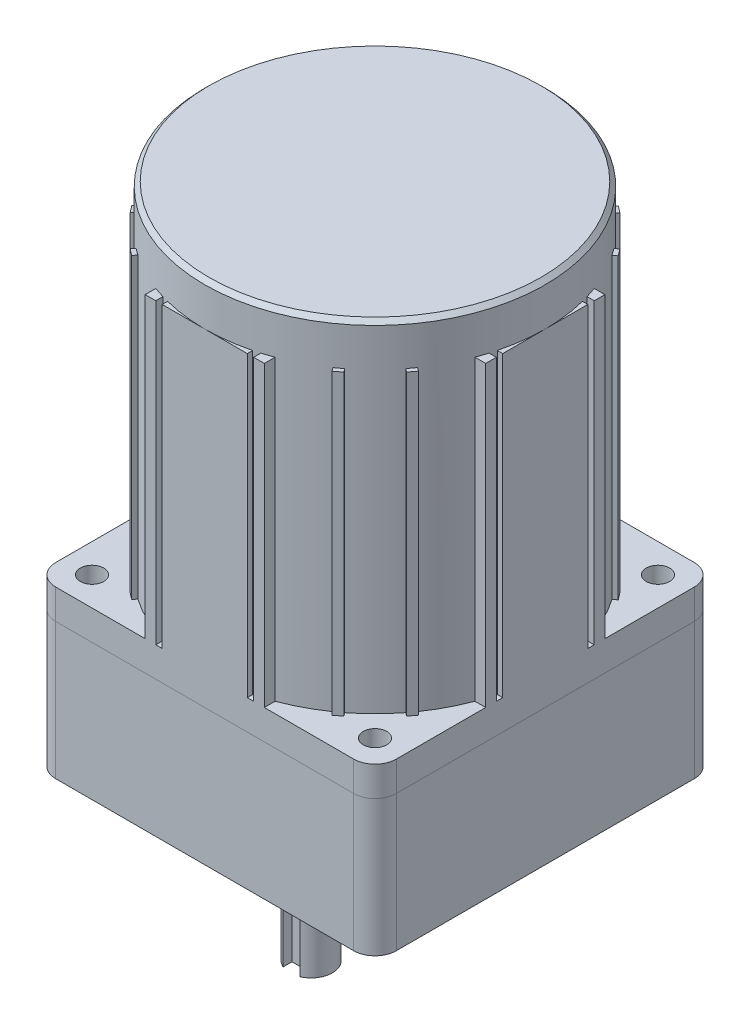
ISO-10303-21;
HEADER;
FILE_DESCRIPTION(('STEP AP214'),'2;1');
FILE_NAME('part.step','',(''),(''),'','','');
FILE_SCHEMA(('AUTOMOTIVE_DESIGN { 1 0 10303 214 1 1 1 1 }'));
ENDSEC;
DATA;
#1=APPLICATION_CONTEXT('core data for automotive mechanical design processes');
#2=APPLICATION_PROTOCOL_DEFINITION('international standard','automotive_design',2000,#1);
#3=PRODUCT_CONTEXT('',#1,'mechanical');
#4=PRODUCT('Part','Part','',(#3));
#5=PRODUCT_RELATED_PRODUCT_CATEGORY('part','',(#4));
#6=PRODUCT_DEFINITION_FORMATION('','',#4);
#7=PRODUCT_DEFINITION_CONTEXT('part definition',#1,'design');
#8=PRODUCT_DEFINITION('design','',#6,#7);
#9=PRODUCT_DEFINITION_SHAPE('','',#8);
#10=(LENGTH_UNIT() NAMED_UNIT(*) SI_UNIT(.MILLI.,.METRE.));
#11=(NAMED_UNIT(*) PLANE_ANGLE_UNIT() SI_UNIT($,.RADIAN.));
#12=(NAMED_UNIT(*) SI_UNIT($,.STERADIAN.) SOLID_ANGLE_UNIT());
#13=UNCERTAINTY_MEASURE_WITH_UNIT(LENGTH_MEASURE(1.E-05),#10,'distance_accuracy_value','');
#14=(GEOMETRIC_REPRESENTATION_CONTEXT(3) GLOBAL_UNCERTAINTY_ASSIGNED_CONTEXT((#13)) GLOBAL_UNIT_ASSIGNED_CONTEXT((#10,
#11,#12)) REPRESENTATION_CONTEXT('',''));
#15=CARTESIAN_POINT('',(0.,0.,0.));
#16=DIRECTION('',(0.,0.,1.));
#17=DIRECTION('',(1.,0.,0.));
#18=AXIS2_PLACEMENT_3D('',#15,#16,#17);
#19=CARTESIAN_POINT('',(0.,-32.,80.));
#20=DIRECTION('',(1.,0.,0.));
#21=DIRECTION('',(0.,0.,-1.));
#22=AXIS2_PLACEMENT_3D('',#19,#20,#21);
#23=PLANE('',#22);
#24=DIRECTION('',(0.,0.,-1.));
#25=VECTOR('',#24,1.);
#26=CARTESIAN_POINT('',(0.,0.,80.));
#27=LINE('',#26,#25);
#28=CARTESIAN_POINT('',(0.,0.,75.));
#29=VERTEX_POINT('',#28);
#30=CARTESIAN_POINT('',(0.,0.,5.));
#31=VERTEX_POINT('',#30);
#32=EDGE_CURVE('E214',#29,#31,#27,.T.);
#33=ORIENTED_EDGE('',*,*,#32,.T.);
#34=DIRECTION('',(0.,1.,0.));
#35=VECTOR('',#34,1.);
#36=CARTESIAN_POINT('',(0.,-32.,5.));
#37=LINE('',#36,#35);
#38=CARTESIAN_POINT('',(0.,-32.,5.));
#39=VERTEX_POINT('',#38);
#40=EDGE_CURVE('E263',#31,#39,#37,.F.);
#41=ORIENTED_EDGE('',*,*,#40,.T.);
#42=DIRECTION('',(0.,0.,-1.));
#43=VECTOR('',#42,1.);
#44=CARTESIAN_POINT('',(0.,-32.,80.));
#45=LINE('',#44,#43);
#46=CARTESIAN_POINT('',(0.,-32.,75.));
#47=VERTEX_POINT('',#46);
#48=EDGE_CURVE('E203',#47,#39,#45,.T.);
#49=ORIENTED_EDGE('',*,*,#48,.F.);
#50=DIRECTION('',(0.,1.,0.));
#51=VECTOR('',#50,1.);
#52=CARTESIAN_POINT('',(0.,-32.,75.));
#53=LINE('',#52,#51);
#54=EDGE_CURVE('E260',#47,#29,#53,.T.);
#55=ORIENTED_EDGE('',*,*,#54,.T.);
#56=EDGE_LOOP('',(#33,#41,#49,#55));
#57=FACE_BOUND('',#56,.T.);
#58=ADVANCED_FACE('F45',(#57),#23,.F.);
#59=CARTESIAN_POINT('',(0.,-32.,0.));
#60=DIRECTION('',(0.,0.,1.));
#61=DIRECTION('',(1.,0.,0.));
#62=AXIS2_PLACEMENT_3D('',#59,#60,#61);
#63=PLANE('',#62);
#64=DIRECTION('',(1.,0.,0.));
#65=VECTOR('',#64,1.);
#66=CARTESIAN_POINT('',(0.,0.,0.));
#67=LINE('',#66,#65);
#68=CARTESIAN_POINT('',(5.00000000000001,0.,0.));
#69=VERTEX_POINT('',#68);
#70=CARTESIAN_POINT('',(75.,0.,0.));
#71=VERTEX_POINT('',#70);
#72=EDGE_CURVE('E217',#69,#71,#67,.T.);
#73=ORIENTED_EDGE('',*,*,#72,.T.);
#74=DIRECTION('',(0.,1.,0.));
#75=VECTOR('',#74,1.);
#76=CARTESIAN_POINT('',(75.,-32.,0.));
#77=LINE('',#76,#75);
#78=CARTESIAN_POINT('',(75.,-32.,0.));
#79=VERTEX_POINT('',#78);
#80=EDGE_CURVE('E250',#71,#79,#77,.F.);
#81=ORIENTED_EDGE('',*,*,#80,.T.);
#82=DIRECTION('',(1.,0.,0.));
#83=VECTOR('',#82,1.);
#84=CARTESIAN_POINT('',(0.,-32.,0.));
#85=LINE('',#84,#83);
#86=CARTESIAN_POINT('',(5.00000000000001,-32.,0.));
#87=VERTEX_POINT('',#86);
#88=EDGE_CURVE('E206',#87,#79,#85,.T.);
#89=ORIENTED_EDGE('',*,*,#88,.F.);
#90=DIRECTION('',(0.,1.,0.));
#91=VECTOR('',#90,1.);
#92=CARTESIAN_POINT('',(5.00000000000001,-32.,0.));
#93=LINE('',#92,#91);
#94=EDGE_CURVE('E247',#87,#69,#93,.T.);
#95=ORIENTED_EDGE('',*,*,#94,.T.);
#96=EDGE_LOOP('',(#73,#81,#89,#95));
#97=FACE_BOUND('',#96,.T.);
#98=ADVANCED_FACE('F293',(#97),#63,.F.);
#99=CARTESIAN_POINT('',(80.,-32.,80.));
#100=DIRECTION('',(-1.,0.,0.));
#101=DIRECTION('',(0.,0.,1.));
#102=AXIS2_PLACEMENT_3D('',#99,#100,#101);
#103=PLANE('',#102);
#104=DIRECTION('',(0.,0.,1.));
#105=VECTOR('',#104,1.);
#106=CARTESIAN_POINT('',(80.,-32.,80.));
#107=LINE('',#106,#105);
#108=CARTESIAN_POINT('',(80.,-32.,5.));
#109=VERTEX_POINT('',#108);
#110=CARTESIAN_POINT('',(80.,-32.,75.));
#111=VERTEX_POINT('',#110);
#112=EDGE_CURVE('E210',#109,#111,#107,.T.);
#113=ORIENTED_EDGE('',*,*,#112,.F.);
#114=DIRECTION('',(0.,1.,0.));
#115=VECTOR('',#114,1.);
#116=CARTESIAN_POINT('',(80.,-32.,5.));
#117=LINE('',#116,#115);
#118=CARTESIAN_POINT('',(80.,0.,5.));
#119=VERTEX_POINT('',#118);
#120=EDGE_CURVE('E236',#109,#119,#117,.T.);
#121=ORIENTED_EDGE('',*,*,#120,.T.);
#122=DIRECTION('',(0.,0.,1.));
#123=VECTOR('',#122,1.);
#124=CARTESIAN_POINT('',(80.,0.,80.));
#125=LINE('',#124,#123);
#126=CARTESIAN_POINT('',(80.,0.,75.));
#127=VERTEX_POINT('',#126);
#128=EDGE_CURVE('E221',#119,#127,#125,.T.);
#129=ORIENTED_EDGE('',*,*,#128,.T.);
#130=DIRECTION('',(0.,1.,0.));
#131=VECTOR('',#130,1.);
#132=CARTESIAN_POINT('',(80.,-32.,75.));
#133=LINE('',#132,#131);
#134=EDGE_CURVE('E177',#127,#111,#133,.F.);
#135=ORIENTED_EDGE('',*,*,#134,.T.);
#136=EDGE_LOOP('',(#113,#121,#129,#135));
#137=FACE_BOUND('',#136,.T.);
#138=ADVANCED_FACE('F301',(#137),#103,.F.);
#139=CARTESIAN_POINT('',(0.,-32.,80.));
#140=DIRECTION('',(0.,0.,-1.));
#141=DIRECTION('',(-1.,0.,0.));
#142=AXIS2_PLACEMENT_3D('',#139,#140,#141);
#143=PLANE('',#142);
#144=DIRECTION('',(-1.,0.,0.));
#145=VECTOR('',#144,1.);
#146=CARTESIAN_POINT('',(0.,0.,80.));
#147=LINE('',#146,#145);
#148=CARTESIAN_POINT('',(75.,0.,80.));
#149=VERTEX_POINT('',#148);
#150=CARTESIAN_POINT('',(5.00000000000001,0.,80.));
#151=VERTEX_POINT('',#150);
#152=EDGE_CURVE('E207',#149,#151,#147,.T.);
#153=ORIENTED_EDGE('',*,*,#152,.T.);
#154=DIRECTION('',(0.,1.,0.));
#155=VECTOR('',#154,1.);
#156=CARTESIAN_POINT('',(5.00000000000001,-32.,80.));
#157=LINE('',#156,#155);
#158=CARTESIAN_POINT('',(5.00000000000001,-32.,80.));
#159=VERTEX_POINT('',#158);
#160=EDGE_CURVE('E73',#151,#159,#157,.F.);
#161=ORIENTED_EDGE('',*,*,#160,.T.);
#162=DIRECTION('',(-1.,0.,0.));
#163=VECTOR('',#162,1.);
#164=CARTESIAN_POINT('',(0.,-32.,80.));
#165=LINE('',#164,#163);
#166=CARTESIAN_POINT('',(75.,-32.,80.));
#167=VERTEX_POINT('',#166);
#168=EDGE_CURVE('E178',#167,#159,#165,.T.);
#169=ORIENTED_EDGE('',*,*,#168,.F.);
#170=DIRECTION('',(0.,1.,0.));
#171=VECTOR('',#170,1.);
#172=CARTESIAN_POINT('',(75.,-32.,80.));
#173=LINE('',#172,#171);
#174=EDGE_CURVE('E265',#167,#149,#173,.T.);
#175=ORIENTED_EDGE('',*,*,#174,.T.);
#176=EDGE_LOOP('',(#153,#161,#169,#175));
#177=FACE_BOUND('',#176,.T.);
#178=ADVANCED_FACE('F270',(#177),#143,.F.);
#179=CARTESIAN_POINT('',(0.,-32.,0.));
#180=DIRECTION('',(0.,-1.,0.));
#181=DIRECTION('',(0.,0.,-1.));
#182=AXIS2_PLACEMENT_3D('',#179,#180,#181);
#183=PLANE('',#182);
#184=CARTESIAN_POINT('',(40.,-32.,40.));
#185=DIRECTION('',(0.,-1.,0.));
#186=DIRECTION('',(0.,0.,-1.));
#187=AXIS2_PLACEMENT_3D('',#184,#185,#186);
#188=CIRCLE('',#187,36.5);
#189=CARTESIAN_POINT('',(40.,-32.,3.49999999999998));
#190=VERTEX_POINT('',#189);
#191=EDGE_CURVE('E182',#190,#190,#188,.T.);
#192=ORIENTED_EDGE('',*,*,#191,.F.);
#193=EDGE_LOOP('',(#192));
#194=FACE_BOUND('',#193,.T.);
#195=CARTESIAN_POINT('',(6.76598128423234,-32.,73.2340187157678));
#196=DIRECTION('',(0.,-1.,0.));
#197=DIRECTION('',(0.,0.,-1.));
#198=AXIS2_PLACEMENT_3D('',#195,#196,#197);
#199=CIRCLE('',#198,2.75);
#200=CARTESIAN_POINT('',(6.76598128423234,-32.,70.4840187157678));
#201=VERTEX_POINT('',#200);
#202=EDGE_CURVE('E191',#201,#201,#199,.T.);
#203=ORIENTED_EDGE('',*,*,#202,.F.);
#204=EDGE_LOOP('',(#203));
#205=FACE_BOUND('',#204,.T.);
#206=CARTESIAN_POINT('',(6.76598128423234,-32.,6.76598128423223));
#207=DIRECTION('',(0.,-1.,0.));
#208=DIRECTION('',(0.,0.,1.));
#209=AXIS2_PLACEMENT_3D('',#206,#207,#208);
#210=CIRCLE('',#209,2.75);
#211=CARTESIAN_POINT('',(6.76598128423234,-32.,9.51598128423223));
#212=VERTEX_POINT('',#211);
#213=EDGE_CURVE('E195',#212,#212,#210,.T.);
#214=ORIENTED_EDGE('',*,*,#213,.F.);
#215=EDGE_LOOP('',(#214));
#216=FACE_BOUND('',#215,.T.);
#217=CARTESIAN_POINT('',(73.2340187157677,-32.,73.2340187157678));
#218=DIRECTION('',(0.,-1.,0.));
#219=DIRECTION('',(0.,0.,1.));
#220=AXIS2_PLACEMENT_3D('',#217,#218,#219);
#221=CIRCLE('',#220,2.75000000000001);
#222=CARTESIAN_POINT('',(73.2340187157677,-32.,75.9840187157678));
#223=VERTEX_POINT('',#222);
#224=EDGE_CURVE('E198',#223,#223,#221,.T.);
#225=ORIENTED_EDGE('',*,*,#224,.F.);
#226=EDGE_LOOP('',(#225));
#227=FACE_BOUND('',#226,.T.);
#228=CARTESIAN_POINT('',(73.2340187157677,-32.,6.76598128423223));
#229=DIRECTION('',(0.,-1.,0.));
#230=DIRECTION('',(0.,0.,-1.));
#231=AXIS2_PLACEMENT_3D('',#228,#229,#230);
#232=CIRCLE('',#231,2.75000000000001);
#233=CARTESIAN_POINT('',(73.2340187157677,-32.,4.01598128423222));
#234=VERTEX_POINT('',#233);
#235=EDGE_CURVE('E188',#234,#234,#232,.T.);
#236=ORIENTED_EDGE('',*,*,#235,.F.);
#237=EDGE_LOOP('',(#236));
#238=FACE_BOUND('',#237,.T.);
#239=ORIENTED_EDGE('',*,*,#88,.T.);
#240=CARTESIAN_POINT('',(75.,-32.,5.));
#241=DIRECTION('',(0.,-1.,0.));
#242=DIRECTION('',(0.,0.,-1.));
#243=AXIS2_PLACEMENT_3D('',#240,#241,#242);
#244=CIRCLE('',#243,5.);
#245=EDGE_CURVE('E258',#79,#109,#244,.T.);
#246=ORIENTED_EDGE('',*,*,#245,.T.);
#247=ORIENTED_EDGE('',*,*,#112,.T.);
#248=CARTESIAN_POINT('',(75.,-32.,75.));
#249=DIRECTION('',(0.,-1.,0.));
#250=DIRECTION('',(0.,0.,-1.));
#251=AXIS2_PLACEMENT_3D('',#248,#249,#250);
#252=CIRCLE('',#251,5.);
#253=EDGE_CURVE('E252',#111,#167,#252,.T.);
#254=ORIENTED_EDGE('',*,*,#253,.T.);
#255=ORIENTED_EDGE('',*,*,#168,.T.);
#256=CARTESIAN_POINT('',(5.00000000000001,-32.,75.));
#257=DIRECTION('',(0.,-1.,0.));
#258=DIRECTION('',(0.,0.,-1.));
#259=AXIS2_PLACEMENT_3D('',#256,#257,#258);
#260=CIRCLE('',#259,5.);
#261=EDGE_CURVE('E254',#159,#47,#260,.T.);
#262=ORIENTED_EDGE('',*,*,#261,.T.);
#263=ORIENTED_EDGE('',*,*,#48,.T.);
#264=CARTESIAN_POINT('',(5.00000000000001,-32.,5.));
#265=DIRECTION('',(0.,-1.,0.));
#266=DIRECTION('',(0.,0.,-1.));
#267=AXIS2_PLACEMENT_3D('',#264,#265,#266);
#268=CIRCLE('',#267,5.);
#269=EDGE_CURVE('E256',#39,#87,#268,.T.);
#270=ORIENTED_EDGE('',*,*,#269,.T.);
#271=EDGE_LOOP('',(#239,#246,#247,#254,#255,#262,#263,#270));
#272=FACE_BOUND('',#271,.T.);
#273=ADVANCED_FACE('F286',(#194,#205,#216,#227,#238,#272),#183,.T.);
#274=CARTESIAN_POINT('',(0.,0.,0.));
#275=DIRECTION('',(0.,-1.,0.));
#276=DIRECTION('',(0.,0.,-1.));
#277=AXIS2_PLACEMENT_3D('',#274,#275,#276);
#278=PLANE('',#277);
#279=CARTESIAN_POINT('',(6.76598128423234,0.,73.2340187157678));
#280=DIRECTION('',(0.,-1.,0.));
#281=DIRECTION('',(0.,0.,-1.));
#282=AXIS2_PLACEMENT_3D('',#279,#280,#281);
#283=CIRCLE('',#282,2.75);
#284=CARTESIAN_POINT('',(6.76598128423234,0.,70.4840187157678));
#285=VERTEX_POINT('',#284);
#286=EDGE_CURVE('E218',#285,#285,#283,.T.);
#287=ORIENTED_EDGE('',*,*,#286,.T.);
#288=EDGE_LOOP('',(#287));
#289=FACE_BOUND('',#288,.T.);
#290=CARTESIAN_POINT('',(6.76598128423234,0.,6.76598128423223));
#291=DIRECTION('',(0.,-1.,0.));
#292=DIRECTION('',(0.,0.,-1.));
#293=AXIS2_PLACEMENT_3D('',#290,#291,#292);
#294=CIRCLE('',#293,2.75);
#295=CARTESIAN_POINT('',(6.76598128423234,0.,4.01598128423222));
#296=VERTEX_POINT('',#295);
#297=EDGE_CURVE('E230',#296,#296,#294,.T.);
#298=ORIENTED_EDGE('',*,*,#297,.T.);
#299=EDGE_LOOP('',(#298));
#300=FACE_BOUND('',#299,.T.);
#301=CARTESIAN_POINT('',(73.2340187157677,0.,73.2340187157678));
#302=DIRECTION('',(0.,-1.,0.));
#303=DIRECTION('',(0.,0.,-1.));
#304=AXIS2_PLACEMENT_3D('',#301,#302,#303);
#305=CIRCLE('',#304,2.75000000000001);
#306=CARTESIAN_POINT('',(73.2340187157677,0.,70.4840187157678));
#307=VERTEX_POINT('',#306);
#308=EDGE_CURVE('E227',#307,#307,#305,.T.);
#309=ORIENTED_EDGE('',*,*,#308,.T.);
#310=EDGE_LOOP('',(#309));
#311=FACE_BOUND('',#310,.T.);
#312=CARTESIAN_POINT('',(73.2340187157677,0.,6.76598128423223));
#313=DIRECTION('',(0.,-1.,0.));
#314=DIRECTION('',(0.,0.,-1.));
#315=AXIS2_PLACEMENT_3D('',#312,#313,#314);
#316=CIRCLE('',#315,2.75000000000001);
#317=CARTESIAN_POINT('',(73.2340187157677,0.,4.01598128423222));
#318=VERTEX_POINT('',#317);
#319=EDGE_CURVE('E194',#318,#318,#316,.T.);
#320=ORIENTED_EDGE('',*,*,#319,.T.);
#321=EDGE_LOOP('',(#320));
#322=FACE_BOUND('',#321,.T.);
#323=ORIENTED_EDGE('',*,*,#128,.F.);
#324=CARTESIAN_POINT('',(75.,0.,5.));
#325=DIRECTION('',(0.,-1.,0.));
#326=DIRECTION('',(0.,0.,-1.));
#327=AXIS2_PLACEMENT_3D('',#324,#325,#326);
#328=CIRCLE('',#327,5.);
#329=EDGE_CURVE('E245',#119,#71,#328,.F.);
#330=ORIENTED_EDGE('',*,*,#329,.T.);
#331=ORIENTED_EDGE('',*,*,#72,.F.);
#332=CARTESIAN_POINT('',(5.00000000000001,0.,5.));
#333=DIRECTION('',(0.,-1.,0.));
#334=DIRECTION('',(0.,0.,-1.));
#335=AXIS2_PLACEMENT_3D('',#332,#333,#334);
#336=CIRCLE('',#335,5.);
#337=EDGE_CURVE('E243',#69,#31,#336,.F.);
#338=ORIENTED_EDGE('',*,*,#337,.T.);
#339=ORIENTED_EDGE('',*,*,#32,.F.);
#340=CARTESIAN_POINT('',(5.00000000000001,0.,75.));
#341=DIRECTION('',(0.,-1.,0.));
#342=DIRECTION('',(0.,0.,-1.));
#343=AXIS2_PLACEMENT_3D('',#340,#341,#342);
#344=CIRCLE('',#343,5.);
#345=EDGE_CURVE('E241',#29,#151,#344,.F.);
#346=ORIENTED_EDGE('',*,*,#345,.T.);
#347=ORIENTED_EDGE('',*,*,#152,.F.);
#348=CARTESIAN_POINT('',(75.,0.,75.));
#349=DIRECTION('',(0.,-1.,0.));
#350=DIRECTION('',(0.,0.,-1.));
#351=AXIS2_PLACEMENT_3D('',#348,#349,#350);
#352=CIRCLE('',#351,5.);
#353=EDGE_CURVE('E239',#149,#127,#352,.F.);
#354=ORIENTED_EDGE('',*,*,#353,.T.);
#355=EDGE_LOOP('',(#323,#330,#331,#338,#339,#346,#347,#354));
#356=FACE_BOUND('',#355,.T.);
#357=ADVANCED_FACE('F275',(#289,#300,#311,#322,#356),#278,.F.);
#358=CARTESIAN_POINT('',(73.2340187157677,87.,6.76598128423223));
#359=DIRECTION('',(0.,-1.,0.));
#360=DIRECTION('',(0.,0.,-1.));
#361=AXIS2_PLACEMENT_3D('',#358,#359,#360);
#362=CYLINDRICAL_SURFACE('',#361,2.75000000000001);
#363=ORIENTED_EDGE('',*,*,#235,.T.);
#364=EDGE_LOOP('',(#363));
#365=FACE_BOUND('',#364,.T.);
#366=ORIENTED_EDGE('',*,*,#319,.F.);
#367=EDGE_LOOP('',(#366));
#368=FACE_BOUND('',#367,.T.);
#369=ADVANCED_FACE('F418',(#365,#368),#362,.F.);
#370=CARTESIAN_POINT('',(73.2340187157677,87.,73.2340187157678));
#371=DIRECTION('',(0.,-1.,0.));
#372=DIRECTION('',(0.,0.,-1.));
#373=AXIS2_PLACEMENT_3D('',#370,#371,#372);
#374=CYLINDRICAL_SURFACE('',#373,2.75000000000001);
#375=ORIENTED_EDGE('',*,*,#224,.T.);
#376=EDGE_LOOP('',(#375));
#377=FACE_BOUND('',#376,.T.);
#378=ORIENTED_EDGE('',*,*,#308,.F.);
#379=EDGE_LOOP('',(#378));
#380=FACE_BOUND('',#379,.T.);
#381=ADVANCED_FACE('F414',(#377,#380),#374,.F.);
#382=CARTESIAN_POINT('',(6.76598128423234,87.,6.76598128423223));
#383=DIRECTION('',(0.,-1.,0.));
#384=DIRECTION('',(0.,0.,-1.));
#385=AXIS2_PLACEMENT_3D('',#382,#383,#384);
#386=CYLINDRICAL_SURFACE('',#385,2.75);
#387=ORIENTED_EDGE('',*,*,#213,.T.);
#388=EDGE_LOOP('',(#387));
#389=FACE_BOUND('',#388,.T.);
#390=ORIENTED_EDGE('',*,*,#297,.F.);
#391=EDGE_LOOP('',(#390));
#392=FACE_BOUND('',#391,.T.);
#393=ADVANCED_FACE('F410',(#389,#392),#386,.F.);
#394=CARTESIAN_POINT('',(6.76598128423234,87.,73.2340187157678));
#395=DIRECTION('',(0.,-1.,0.));
#396=DIRECTION('',(0.,0.,-1.));
#397=AXIS2_PLACEMENT_3D('',#394,#395,#396);
#398=CYLINDRICAL_SURFACE('',#397,2.75);
#399=ORIENTED_EDGE('',*,*,#202,.T.);
#400=EDGE_LOOP('',(#399));
#401=FACE_BOUND('',#400,.T.);
#402=ORIENTED_EDGE('',*,*,#286,.F.);
#403=EDGE_LOOP('',(#402));
#404=FACE_BOUND('',#403,.T.);
#405=ADVANCED_FACE('F406',(#401,#404),#398,.F.);
#406=CARTESIAN_POINT('',(40.,-30.,40.));
#407=DIRECTION('',(0.,-1.,0.));
#408=DIRECTION('',(0.,0.,-1.));
#409=AXIS2_PLACEMENT_3D('',#406,#407,#408);
#410=CYLINDRICAL_SURFACE('',#409,36.5);
#411=CARTESIAN_POINT('',(40.,-30.,40.));
#412=DIRECTION('',(0.,-1.,0.));
#413=DIRECTION('',(0.,0.,-1.));
#414=AXIS2_PLACEMENT_3D('',#411,#412,#413);
#415=CIRCLE('',#414,36.5);
#416=CARTESIAN_POINT('',(40.,-30.,3.49999999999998));
#417=VERTEX_POINT('',#416);
#418=EDGE_CURVE('E185',#417,#417,#415,.T.);
#419=ORIENTED_EDGE('',*,*,#418,.F.);
#420=EDGE_LOOP('',(#419));
#421=FACE_BOUND('',#420,.T.);
#422=ORIENTED_EDGE('',*,*,#191,.T.);
#423=EDGE_LOOP('',(#422));
#424=FACE_BOUND('',#423,.T.);
#425=ADVANCED_FACE('F402',(#421,#424),#410,.F.);
#426=CARTESIAN_POINT('',(40.,-30.,40.));
#427=DIRECTION('',(0.,-1.,0.));
#428=DIRECTION('',(0.,0.,-1.));
#429=AXIS2_PLACEMENT_3D('',#426,#427,#428);
#430=PLANE('',#429);
#431=CARTESIAN_POINT('',(40.,-30.,55.));
#432=DIRECTION('',(0.,-1.,0.));
#433=DIRECTION('',(0.,0.,-1.));
#434=AXIS2_PLACEMENT_3D('',#431,#432,#433);
#435=CIRCLE('',#434,17.);
#436=CARTESIAN_POINT('',(40.,-30.,38.));
#437=VERTEX_POINT('',#436);
#438=EDGE_CURVE('E173',#437,#437,#435,.T.);
#439=ORIENTED_EDGE('',*,*,#438,.F.);
#440=EDGE_LOOP('',(#439));
#441=FACE_BOUND('',#440,.T.);
#442=ORIENTED_EDGE('',*,*,#418,.T.);
#443=EDGE_LOOP('',(#442));
#444=FACE_BOUND('',#443,.T.);
#445=ADVANCED_FACE('F398',(#441,#444),#430,.T.);
#446=CARTESIAN_POINT('',(40.,-35.,55.));
#447=DIRECTION('',(0.,1.,0.));
#448=DIRECTION('',(0.,0.,1.));
#449=AXIS2_PLACEMENT_3D('',#446,#447,#448);
#450=CYLINDRICAL_SURFACE('',#449,17.);
#451=CARTESIAN_POINT('',(40.,-35.,55.));
#452=DIRECTION('',(0.,-1.,0.));
#453=DIRECTION('',(0.,0.,-1.));
#454=AXIS2_PLACEMENT_3D('',#451,#452,#453);
#455=CIRCLE('',#454,17.);
#456=CARTESIAN_POINT('',(40.,-35.,38.));
#457=VERTEX_POINT('',#456);
#458=EDGE_CURVE('E179',#457,#457,#455,.T.);
#459=ORIENTED_EDGE('',*,*,#458,.F.);
#460=EDGE_LOOP('',(#459));
#461=FACE_BOUND('',#460,.T.);
#462=ORIENTED_EDGE('',*,*,#438,.T.);
#463=EDGE_LOOP('',(#462));
#464=FACE_BOUND('',#463,.T.);
#465=ADVANCED_FACE('F394',(#461,#464),#450,.T.);
#466=CARTESIAN_POINT('',(40.,-35.,55.));
#467=DIRECTION('',(0.,-1.,0.));
#468=DIRECTION('',(0.,0.,-1.));
#469=AXIS2_PLACEMENT_3D('',#466,#467,#468);
#470=PLANE('',#469);
#471=CARTESIAN_POINT('',(40.,-35.,55.));
#472=DIRECTION('',(0.,-1.,0.));
#473=DIRECTION('',(0.,0.,-1.));
#474=AXIS2_PLACEMENT_3D('',#471,#472,#473);
#475=CIRCLE('',#474,5.);
#476=CARTESIAN_POINT('',(40.,-35.,50.));
#477=VERTEX_POINT('',#476);
#478=EDGE_CURVE('E174',#477,#477,#475,.T.);
#479=ORIENTED_EDGE('',*,*,#478,.F.);
#480=EDGE_LOOP('',(#479));
#481=FACE_BOUND('',#480,.T.);
#482=ORIENTED_EDGE('',*,*,#458,.T.);
#483=EDGE_LOOP('',(#482));
#484=FACE_BOUND('',#483,.T.);
#485=ADVANCED_FACE('F346',(#481,#484),#470,.T.);
#486=CARTESIAN_POINT('',(40.,-64.,55.));
#487=DIRECTION('',(0.,1.,0.));
#488=DIRECTION('',(0.,0.,1.));
#489=AXIS2_PLACEMENT_3D('',#486,#487,#488);
#490=CYLINDRICAL_SURFACE('',#489,5.);
#491=CARTESIAN_POINT('',(40.,-64.,55.));
#492=DIRECTION('',(0.,-1.,0.));
#493=DIRECTION('',(0.,0.,-1.));
#494=AXIS2_PLACEMENT_3D('',#491,#492,#493);
#495=CIRCLE('',#494,5.);
#496=CARTESIAN_POINT('',(38.,-64.,59.5825756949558));
#497=VERTEX_POINT('',#496);
#498=CARTESIAN_POINT('',(42.,-64.,59.5825756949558));
#499=VERTEX_POINT('',#498);
#500=EDGE_CURVE('E159',#497,#499,#495,.T.);
#501=ORIENTED_EDGE('',*,*,#500,.F.);
#502=DIRECTION('',(0.,1.,0.));
#503=VECTOR('',#502,1.);
#504=CARTESIAN_POINT('',(38.,-64.,59.5825756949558));
#505=LINE('',#504,#503);
#506=CARTESIAN_POINT('',(38.,-41.,59.5825756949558));
#507=VERTEX_POINT('',#506);
#508=EDGE_CURVE('E168',#497,#507,#505,.T.);
#509=ORIENTED_EDGE('',*,*,#508,.T.);
#510=CARTESIAN_POINT('',(38.,-41.,59.5825756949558));
#511=CARTESIAN_POINT('',(37.9999920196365,-40.9461941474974,59.5825646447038));
#512=CARTESIAN_POINT('',(38.0021710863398,-40.8923943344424,59.5835230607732));
#513=CARTESIAN_POINT('',(38.0108409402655,-40.7852287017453,59.5872962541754));
#514=CARTESIAN_POINT('',(38.0173300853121,-40.731862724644,59.5901103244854));
#515=CARTESIAN_POINT('',(38.0345239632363,-40.6261531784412,59.5974978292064));
#516=CARTESIAN_POINT('',(38.0452120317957,-40.573806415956,59.6020643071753));
#517=CARTESIAN_POINT('',(38.0706836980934,-40.4702992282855,59.6128005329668));
#518=CARTESIAN_POINT('',(38.0854675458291,-40.4191388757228,59.618970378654));
#519=CARTESIAN_POINT('',(38.1357302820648,-40.268064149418,59.6395929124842));
#520=CARTESIAN_POINT('',(38.1771551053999,-40.1703457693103,59.6561744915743));
#521=CARTESIAN_POINT('',(38.2745180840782,-39.9832044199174,59.6931237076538));
#522=CARTESIAN_POINT('',(38.3304700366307,-39.8937894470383,59.7134949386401));
#523=CARTESIAN_POINT('',(38.4586816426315,-39.7207376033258,59.7570099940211));
#524=CARTESIAN_POINT('',(38.5316308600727,-39.6376327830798,59.7802424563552));
#525=CARTESIAN_POINT('',(38.6903035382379,-39.4844597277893,59.8261279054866));
#526=CARTESIAN_POINT('',(38.7760296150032,-39.4143941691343,59.8487807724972));
#527=CARTESIAN_POINT('',(38.9619940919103,-39.2865936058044,59.8920341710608));
#528=CARTESIAN_POINT('',(39.062672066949,-39.2294551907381,59.9125182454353));
#529=CARTESIAN_POINT('',(39.2731758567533,-39.1331559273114,59.94803944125));
#530=CARTESIAN_POINT('',(39.3829978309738,-39.0939875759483,59.9630788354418));
#531=CARTESIAN_POINT('',(39.6030325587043,-39.0366587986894,59.9853831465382));
#532=CARTESIAN_POINT('',(39.7129689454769,-39.0175730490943,59.9929892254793));
#533=CARTESIAN_POINT('',(39.9347315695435,-38.9979715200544,60.0008031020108));
#534=CARTESIAN_POINT('',(40.0465571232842,-38.9974491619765,60.0010135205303));
#535=CARTESIAN_POINT('',(40.2622333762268,-39.0144828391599,59.994219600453));
#536=CARTESIAN_POINT('',(40.3661792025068,-39.031025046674,59.9876198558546));
#537=CARTESIAN_POINT('',(40.5696747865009,-39.0799934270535,59.9684927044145));
#538=CARTESIAN_POINT('',(40.6692242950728,-39.1124204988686,59.9559649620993));
#539=CARTESIAN_POINT('',(40.8628975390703,-39.1926362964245,59.9259683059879));
#540=CARTESIAN_POINT('',(40.9569168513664,-39.2406492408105,59.9084277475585));
#541=CARTESIAN_POINT('',(41.1358074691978,-39.3504645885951,59.8701460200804));
#542=CARTESIAN_POINT('',(41.220675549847,-39.4122718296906,59.8494037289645));
#543=CARTESIAN_POINT('',(41.3847633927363,-39.5526441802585,59.8052178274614));
#544=CARTESIAN_POINT('',(41.4632477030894,-39.63204247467,59.7816862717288));
#545=CARTESIAN_POINT('',(41.6060992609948,-39.8029800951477,59.7356195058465));
#546=CARTESIAN_POINT('',(41.6704600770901,-39.8945249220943,59.7130847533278));
#547=CARTESIAN_POINT('',(41.7849365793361,-40.0904702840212,59.6709568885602));
#548=CARTESIAN_POINT('',(41.8345893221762,-40.1951648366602,59.6514670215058));
#549=CARTESIAN_POINT('',(41.9152129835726,-40.4123615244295,59.6188610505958));
#550=CARTESIAN_POINT('',(41.9462169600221,-40.5248494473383,59.6057336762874));
#551=CARTESIAN_POINT('',(41.9781058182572,-40.698743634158,59.5920830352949));
#552=CARTESIAN_POINT('',(41.9863050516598,-40.7586575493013,59.5885343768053));
#553=CARTESIAN_POINT('',(41.9972528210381,-40.8790350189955,59.5837754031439));
#554=CARTESIAN_POINT('',(42.0000047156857,-40.9394982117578,59.5825636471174));
#555=CARTESIAN_POINT('',(42.,-41.,59.5825756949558));
#556=B_SPLINE_CURVE_WITH_KNOTS('',3,(#510,#511,#512,#513,#514,#515,#516,#517,#518,#519,#520,
#521,#522,#523,#524,#525,#526,#527,#528,#529,#530,#531,#532,#533,#534,#535,#536,#537,#538,#539,
#540,#541,#542,#543,#544,#545,#546,#547,#548,#549,#550,#551,#552,#553,#554,#555),.UNSPECIFIED.,
.F.,.F.,(4,2,2,2,2,2,2,2,2,2,2,2,2,2,2,2,2,2,2,2,2,2,4),(0.,0.161354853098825,0.322648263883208,
0.483307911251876,0.643977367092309,0.964683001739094,1.28569434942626,1.62318047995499,
1.96073580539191,2.31162858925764,2.66237473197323,2.99613876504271,3.32978451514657,
3.64468915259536,3.95961161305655,4.27928176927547,4.5990642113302,4.93981874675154,
5.28072813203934,5.63144241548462,5.98153315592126,6.16300192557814,6.34435877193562),.UNSPECIFIED.);
#557=CARTESIAN_POINT('',(42.,-41.,59.5825756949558));
#558=VERTEX_POINT('',#557);
#559=EDGE_CURVE('E13',#507,#558,#556,.T.);
#560=ORIENTED_EDGE('',*,*,#559,.T.);
#561=DIRECTION('',(0.,1.,0.));
#562=VECTOR('',#561,1.);
#563=CARTESIAN_POINT('',(42.,-64.,59.5825756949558));
#564=LINE('',#563,#562);
#565=EDGE_CURVE('E166',#558,#499,#564,.F.);
#566=ORIENTED_EDGE('',*,*,#565,.T.);
#567=EDGE_LOOP('',(#501,#509,#560,#566));
#568=FACE_BOUND('',#567,.T.);
#569=ORIENTED_EDGE('',*,*,#478,.T.);
#570=EDGE_LOOP('',(#569));
#571=FACE_BOUND('',#570,.T.);
#572=ADVANCED_FACE('F341',(#568,#571),#490,.T.);
#573=CARTESIAN_POINT('',(40.,-64.,55.));
#574=DIRECTION('',(0.,-1.,0.));
#575=DIRECTION('',(0.,0.,-1.));
#576=AXIS2_PLACEMENT_3D('',#573,#574,#575);
#577=PLANE('',#576);
#578=DIRECTION('',(0.,0.,1.));
#579=VECTOR('',#578,1.);
#580=CARTESIAN_POINT('',(38.,-64.,57.5));
#581=LINE('',#580,#579);
#582=CARTESIAN_POINT('',(38.,-64.,57.5));
#583=VERTEX_POINT('',#582);
#584=EDGE_CURVE('E169',#583,#497,#581,.T.);
#585=ORIENTED_EDGE('',*,*,#584,.T.);
#586=ORIENTED_EDGE('',*,*,#500,.T.);
#587=DIRECTION('',(0.,0.,1.));
#588=VECTOR('',#587,1.);
#589=CARTESIAN_POINT('',(42.,-64.,57.5));
#590=LINE('',#589,#588);
#591=CARTESIAN_POINT('',(42.,-64.,57.5));
#592=VERTEX_POINT('',#591);
#593=EDGE_CURVE('E149',#592,#499,#590,.T.);
#594=ORIENTED_EDGE('',*,*,#593,.F.);
#595=DIRECTION('',(-1.,0.,0.));
#596=VECTOR('',#595,1.);
#597=CARTESIAN_POINT('',(40.,-64.,57.5));
#598=LINE('',#597,#596);
#599=EDGE_CURVE('E58',#592,#583,#598,.T.);
#600=ORIENTED_EDGE('',*,*,#599,.T.);
#601=EDGE_LOOP('',(#585,#586,#594,#600));
#602=FACE_BOUND('',#601,.T.);
#603=ADVANCED_FACE('F157',(#602),#577,.T.);
#604=CARTESIAN_POINT('',(75.,-32.,5.));
#605=DIRECTION('',(0.,1.,0.));
#606=DIRECTION('',(0.,0.,1.));
#607=AXIS2_PLACEMENT_3D('',#604,#605,#606);
#608=CYLINDRICAL_SURFACE('',#607,5.);
#609=ORIENTED_EDGE('',*,*,#245,.F.);
#610=ORIENTED_EDGE('',*,*,#80,.F.);
#611=ORIENTED_EDGE('',*,*,#329,.F.);
#612=ORIENTED_EDGE('',*,*,#120,.F.);
#613=EDGE_LOOP('',(#609,#610,#611,#612));
#614=FACE_BOUND('',#613,.T.);
#615=ADVANCED_FACE('F298',(#614),#608,.T.);
#616=CARTESIAN_POINT('',(5.00000000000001,-32.,5.));
#617=DIRECTION('',(0.,1.,0.));
#618=DIRECTION('',(0.,0.,1.));
#619=AXIS2_PLACEMENT_3D('',#616,#617,#618);
#620=CYLINDRICAL_SURFACE('',#619,5.);
#621=ORIENTED_EDGE('',*,*,#269,.F.);
#622=ORIENTED_EDGE('',*,*,#40,.F.);
#623=ORIENTED_EDGE('',*,*,#337,.F.);
#624=ORIENTED_EDGE('',*,*,#94,.F.);
#625=EDGE_LOOP('',(#621,#622,#623,#624));
#626=FACE_BOUND('',#625,.T.);
#627=ADVANCED_FACE('F290',(#626),#620,.T.);
#628=CARTESIAN_POINT('',(5.00000000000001,-32.,75.));
#629=DIRECTION('',(0.,1.,0.));
#630=DIRECTION('',(0.,0.,1.));
#631=AXIS2_PLACEMENT_3D('',#628,#629,#630);
#632=CYLINDRICAL_SURFACE('',#631,5.);
#633=ORIENTED_EDGE('',*,*,#261,.F.);
#634=ORIENTED_EDGE('',*,*,#160,.F.);
#635=ORIENTED_EDGE('',*,*,#345,.F.);
#636=ORIENTED_EDGE('',*,*,#54,.F.);
#637=EDGE_LOOP('',(#633,#634,#635,#636));
#638=FACE_BOUND('',#637,.T.);
#639=ADVANCED_FACE('F280',(#638),#632,.T.);
#640=CARTESIAN_POINT('',(75.,-32.,75.));
#641=DIRECTION('',(0.,1.,0.));
#642=DIRECTION('',(0.,0.,1.));
#643=AXIS2_PLACEMENT_3D('',#640,#641,#642);
#644=CYLINDRICAL_SURFACE('',#643,5.);
#645=ORIENTED_EDGE('',*,*,#253,.F.);
#646=ORIENTED_EDGE('',*,*,#134,.F.);
#647=ORIENTED_EDGE('',*,*,#353,.F.);
#648=ORIENTED_EDGE('',*,*,#174,.F.);
#649=EDGE_LOOP('',(#645,#646,#647,#648));
#650=FACE_BOUND('',#649,.T.);
#651=ADVANCED_FACE('F47',(#650),#644,.T.);
#652=CARTESIAN_POINT('',(40.,-41.,57.5));
#653=DIRECTION('',(0.,0.,1.));
#654=DIRECTION('',(1.,0.,0.));
#655=AXIS2_PLACEMENT_3D('',#652,#653,#654);
#656=CYLINDRICAL_SURFACE('',#655,2.);
#657=DIRECTION('',(0.,0.,1.));
#658=VECTOR('',#657,1.);
#659=CARTESIAN_POINT('',(38.,-41.,57.5));
#660=LINE('',#659,#658);
#661=CARTESIAN_POINT('',(38.,-41.,57.5));
#662=VERTEX_POINT('',#661);
#663=EDGE_CURVE('E161',#662,#507,#660,.T.);
#664=ORIENTED_EDGE('',*,*,#663,.F.);
#665=CARTESIAN_POINT('',(40.,-41.,57.5));
#666=DIRECTION('',(0.,0.,1.));
#667=DIRECTION('',(1.,0.,0.));
#668=AXIS2_PLACEMENT_3D('',#665,#666,#667);
#669=CIRCLE('',#668,2.);
#670=CARTESIAN_POINT('',(42.,-41.,57.5));
#671=VERTEX_POINT('',#670);
#672=EDGE_CURVE('E154',#671,#662,#669,.T.);
#673=ORIENTED_EDGE('',*,*,#672,.F.);
#674=DIRECTION('',(0.,0.,1.));
#675=VECTOR('',#674,1.);
#676=CARTESIAN_POINT('',(42.,-41.,57.5));
#677=LINE('',#676,#675);
#678=EDGE_CURVE('E152',#671,#558,#677,.T.);
#679=ORIENTED_EDGE('',*,*,#678,.T.);
#680=ORIENTED_EDGE('',*,*,#559,.F.);
#681=EDGE_LOOP('',(#664,#673,#679,#680));
#682=FACE_BOUND('',#681,.T.);
#683=ADVANCED_FACE('F304',(#682),#656,.F.);
#684=CARTESIAN_POINT('',(38.,-64.,57.5));
#685=DIRECTION('',(-1.,0.,0.));
#686=DIRECTION('',(0.,0.,1.));
#687=AXIS2_PLACEMENT_3D('',#684,#685,#686);
#688=PLANE('',#687);
#689=ORIENTED_EDGE('',*,*,#584,.F.);
#690=DIRECTION('',(0.,-1.,0.));
#691=VECTOR('',#690,1.);
#692=CARTESIAN_POINT('',(38.,-64.,57.5));
#693=LINE('',#692,#691);
#694=EDGE_CURVE('E65',#662,#583,#693,.T.);
#695=ORIENTED_EDGE('',*,*,#694,.F.);
#696=ORIENTED_EDGE('',*,*,#663,.T.);
#697=ORIENTED_EDGE('',*,*,#508,.F.);
#698=EDGE_LOOP('',(#689,#695,#696,#697));
#699=FACE_BOUND('',#698,.T.);
#700=ADVANCED_FACE('F309',(#699),#688,.F.);
#701=CARTESIAN_POINT('',(42.,-64.,57.5));
#702=DIRECTION('',(1.,0.,0.));
#703=DIRECTION('',(0.,0.,-1.));
#704=AXIS2_PLACEMENT_3D('',#701,#702,#703);
#705=PLANE('',#704);
#706=ORIENTED_EDGE('',*,*,#678,.F.);
#707=DIRECTION('',(0.,1.,0.));
#708=VECTOR('',#707,1.);
#709=CARTESIAN_POINT('',(42.,-64.,57.5));
#710=LINE('',#709,#708);
#711=EDGE_CURVE('E143',#592,#671,#710,.T.);
#712=ORIENTED_EDGE('',*,*,#711,.F.);
#713=ORIENTED_EDGE('',*,*,#593,.T.);
#714=ORIENTED_EDGE('',*,*,#565,.F.);
#715=EDGE_LOOP('',(#706,#712,#713,#714));
#716=FACE_BOUND('',#715,.T.);
#717=ADVANCED_FACE('F148',(#716),#705,.F.);
#718=CARTESIAN_POINT('',(40.,-64.,57.5));
#719=DIRECTION('',(0.,0.,1.));
#720=DIRECTION('',(1.,0.,0.));
#721=AXIS2_PLACEMENT_3D('',#718,#719,#720);
#722=PLANE('',#721);
#723=ORIENTED_EDGE('',*,*,#711,.T.);
#724=ORIENTED_EDGE('',*,*,#672,.T.);
#725=ORIENTED_EDGE('',*,*,#694,.T.);
#726=ORIENTED_EDGE('',*,*,#599,.F.);
#727=EDGE_LOOP('',(#723,#724,#725,#726));
#728=FACE_BOUND('',#727,.T.);
#729=ADVANCED_FACE('F142',(#728),#722,.T.);
#730=CLOSED_SHELL('',(#58,#98,#138,#178,#273,#357,#369,#381,#393,#405,#425,#445,#465,#485,#572,
#603,#615,#627,#639,#651,#683,#700,#717,#729));
#731=MANIFOLD_SOLID_BREP('B2',#730);
#732=CARTESIAN_POINT('',(0.,87.,80.));
#733=DIRECTION('',(0.,0.,-1.));
#734=DIRECTION('',(-1.,0.,0.));
#735=AXIS2_PLACEMENT_3D('',#732,#733,#734);
#736=PLANE('',#735);
#737=DIRECTION('',(1.,0.,0.));
#738=VECTOR('',#737,1.);
#739=CARTESIAN_POINT('',(0.,7.,80.));
#740=LINE('',#739,#738);
#741=CARTESIAN_POINT('',(5.00000000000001,7.,80.));
#742=VERTEX_POINT('',#741);
#743=CARTESIAN_POINT('',(26.,7.,80.));
#744=VERTEX_POINT('',#743);
#745=EDGE_CURVE('E1224',#742,#744,#740,.T.);
#746=ORIENTED_EDGE('',*,*,#745,.F.);
#747=DIRECTION('',(0.,-1.,0.));
#748=VECTOR('',#747,1.);
#749=CARTESIAN_POINT('',(5.00000000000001,87.,80.));
#750=LINE('',#749,#748);
#751=CARTESIAN_POINT('',(5.00000000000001,0.,80.));
#752=VERTEX_POINT('',#751);
#753=EDGE_CURVE('E1219',#742,#752,#750,.T.);
#754=ORIENTED_EDGE('',*,*,#753,.T.);
#755=DIRECTION('',(1.,0.,0.));
#756=VECTOR('',#755,1.);
#757=CARTESIAN_POINT('',(0.,0.,80.));
#758=LINE('',#757,#756);
#759=CARTESIAN_POINT('',(75.,0.,80.));
#760=VERTEX_POINT('',#759);
#761=EDGE_CURVE('E1171',#752,#760,#758,.T.);
#762=ORIENTED_EDGE('',*,*,#761,.T.);
#763=DIRECTION('',(0.,-1.,0.));
#764=VECTOR('',#763,1.);
#765=CARTESIAN_POINT('',(75.,87.,80.));
#766=LINE('',#765,#764);
#767=CARTESIAN_POINT('',(75.,7.,80.));
#768=VERTEX_POINT('',#767);
#769=EDGE_CURVE('E568',#760,#768,#766,.F.);
#770=ORIENTED_EDGE('',*,*,#769,.T.);
#771=DIRECTION('',(-1.,0.,0.));
#772=VECTOR('',#771,1.);
#773=CARTESIAN_POINT('',(80.,7.,80.));
#774=LINE('',#773,#772);
#775=CARTESIAN_POINT('',(54.,7.,80.));
#776=VERTEX_POINT('',#775);
#777=EDGE_CURVE('E1244',#768,#776,#774,.T.);
#778=ORIENTED_EDGE('',*,*,#777,.T.);
#779=DIRECTION('',(0.,1.,0.));
#780=VECTOR('',#779,1.);
#781=CARTESIAN_POINT('',(54.,-36.7695526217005,80.));
#782=LINE('',#781,#780);
#783=CARTESIAN_POINT('',(54.,77.,80.));
#784=VERTEX_POINT('',#783);
#785=EDGE_CURVE('E1256',#776,#784,#782,.T.);
#786=ORIENTED_EDGE('',*,*,#785,.T.);
#787=DIRECTION('',(1.,0.,0.));
#788=VECTOR('',#787,1.);
#789=CARTESIAN_POINT('',(0.,77.,80.));
#790=LINE('',#789,#788);
#791=CARTESIAN_POINT('',(51.5,77.,80.));
#792=VERTEX_POINT('',#791);
#793=EDGE_CURVE('E1160',#792,#784,#790,.T.);
#794=ORIENTED_EDGE('',*,*,#793,.F.);
#795=DIRECTION('',(0.,1.,0.));
#796=VECTOR('',#795,1.);
#797=CARTESIAN_POINT('',(51.5,-36.7695526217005,80.));
#798=LINE('',#797,#796);
#799=CARTESIAN_POINT('',(51.5,7.,80.));
#800=VERTEX_POINT('',#799);
#801=EDGE_CURVE('E3032',#800,#792,#798,.T.);
#802=ORIENTED_EDGE('',*,*,#801,.F.);
#803=DIRECTION('',(-1.,0.,0.));
#804=VECTOR('',#803,1.);
#805=CARTESIAN_POINT('',(80.,7.,80.));
#806=LINE('',#805,#804);
#807=CARTESIAN_POINT('',(50.,7.,80.));
#808=VERTEX_POINT('',#807);
#809=EDGE_CURVE('E3041',#800,#808,#806,.T.);
#810=ORIENTED_EDGE('',*,*,#809,.T.);
#811=DIRECTION('',(0.,1.,0.));
#812=VECTOR('',#811,1.);
#813=CARTESIAN_POINT('',(50.,-36.7695526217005,80.));
#814=LINE('',#813,#812);
#815=CARTESIAN_POINT('',(50.,77.,80.));
#816=VERTEX_POINT('',#815);
#817=EDGE_CURVE('E3029',#808,#816,#814,.T.);
#818=ORIENTED_EDGE('',*,*,#817,.T.);
#819=CARTESIAN_POINT('',(40.,77.,80.));
#820=VERTEX_POINT('',#819);
#821=EDGE_CURVE('E1156',#820,#816,#790,.T.);
#822=ORIENTED_EDGE('',*,*,#821,.F.);
#823=CARTESIAN_POINT('',(30.,77.,80.));
#824=VERTEX_POINT('',#823);
#825=EDGE_CURVE('E1159',#824,#820,#790,.T.);
#826=ORIENTED_EDGE('',*,*,#825,.F.);
#827=DIRECTION('',(0.,1.,0.));
#828=VECTOR('',#827,1.);
#829=CARTESIAN_POINT('',(30.,-36.7695526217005,80.));
#830=LINE('',#829,#828);
#831=CARTESIAN_POINT('',(30.,7.,80.));
#832=VERTEX_POINT('',#831);
#833=EDGE_CURVE('E1306',#832,#824,#830,.T.);
#834=ORIENTED_EDGE('',*,*,#833,.F.);
#835=DIRECTION('',(1.,0.,0.));
#836=VECTOR('',#835,1.);
#837=CARTESIAN_POINT('',(0.,7.,80.));
#838=LINE('',#837,#836);
#839=CARTESIAN_POINT('',(28.5,7.,80.));
#840=VERTEX_POINT('',#839);
#841=EDGE_CURVE('E1292',#840,#832,#838,.T.);
#842=ORIENTED_EDGE('',*,*,#841,.F.);
#843=DIRECTION('',(0.,1.,0.));
#844=VECTOR('',#843,1.);
#845=CARTESIAN_POINT('',(28.5,-36.7695526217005,80.));
#846=LINE('',#845,#844);
#847=CARTESIAN_POINT('',(28.5,77.,80.));
#848=VERTEX_POINT('',#847);
#849=EDGE_CURVE('E1300',#840,#848,#846,.T.);
#850=ORIENTED_EDGE('',*,*,#849,.T.);
#851=CARTESIAN_POINT('',(26.,77.,80.));
#852=VERTEX_POINT('',#851);
#853=EDGE_CURVE('E1161',#852,#848,#790,.T.);
#854=ORIENTED_EDGE('',*,*,#853,.F.);
#855=DIRECTION('',(0.,1.,0.));
#856=VECTOR('',#855,1.);
#857=CARTESIAN_POINT('',(26.,-36.7695526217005,80.));
#858=LINE('',#857,#856);
#859=EDGE_CURVE('E1376',#744,#852,#858,.T.);
#860=ORIENTED_EDGE('',*,*,#859,.F.);
#861=EDGE_LOOP('',(#746,#754,#762,#770,#778,#786,#794,#802,#810,#818,#822,#826,#834,#842,#850,
#854,#860));
#862=FACE_BOUND('',#861,.T.);
#863=ADVANCED_FACE('F553',(#862),#736,.F.);
#864=CARTESIAN_POINT('',(40.,77.,40.));
#865=DIRECTION('',(0.,1.,0.));
#866=DIRECTION('',(0.,0.,1.));
#867=AXIS2_PLACEMENT_3D('',#864,#865,#866);
#868=PLANE('',#867);
#869=CARTESIAN_POINT('',(40.,77.,40.));
#870=DIRECTION('',(0.,1.,0.));
#871=DIRECTION('',(0.,0.,1.));
#872=AXIS2_PLACEMENT_3D('',#869,#870,#871);
#873=CIRCLE('',#872,40.);
#874=CARTESIAN_POINT('',(51.5,77.,78.3112255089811));
#875=VERTEX_POINT('',#874);
#876=CARTESIAN_POINT('',(54.,77.,77.4699879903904));
#877=VERTEX_POINT('',#876);
#878=EDGE_CURVE('E1149',#875,#877,#873,.T.);
#879=ORIENTED_EDGE('',*,*,#878,.F.);
#880=DIRECTION('',(0.,0.,1.));
#881=VECTOR('',#880,1.);
#882=CARTESIAN_POINT('',(51.5,77.,80.0000000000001));
#883=LINE('',#882,#881);
#884=EDGE_CURVE('E3037',#875,#792,#883,.T.);
#885=ORIENTED_EDGE('',*,*,#884,.T.);
#886=ORIENTED_EDGE('',*,*,#793,.T.);
#887=DIRECTION('',(0.,0.,-1.));
#888=VECTOR('',#887,1.);
#889=CARTESIAN_POINT('',(54.,77.,80.0000000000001));
#890=LINE('',#889,#888);
#891=EDGE_CURVE('E2958',#784,#877,#890,.T.);
#892=ORIENTED_EDGE('',*,*,#891,.T.);
#893=EDGE_LOOP('',(#879,#885,#886,#892));
#894=FACE_BOUND('',#893,.T.);
#895=ADVANCED_FACE('F1720',(#894),#868,.T.);
#896=ORIENTED_EDGE('',*,*,#821,.T.);
#897=DIRECTION('',(0.,0.,-1.));
#898=VECTOR('',#897,1.);
#899=CARTESIAN_POINT('',(50.,77.,80.));
#900=LINE('',#899,#898);
#901=CARTESIAN_POINT('',(50.,77.,78.7298334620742));
#902=VERTEX_POINT('',#901);
#903=EDGE_CURVE('E3027',#816,#902,#900,.T.);
#904=ORIENTED_EDGE('',*,*,#903,.T.);
#905=EDGE_CURVE('E1144',#820,#902,#873,.T.);
#906=ORIENTED_EDGE('',*,*,#905,.F.);
#907=EDGE_LOOP('',(#896,#904,#906));
#908=FACE_BOUND('',#907,.T.);
#909=ADVANCED_FACE('F1733',(#908),#868,.T.);
#910=DIRECTION('',(-1.,0.,0.));
#911=VECTOR('',#910,1.);
#912=CARTESIAN_POINT('',(80.,77.,50.));
#913=LINE('',#912,#911);
#914=CARTESIAN_POINT('',(80.,77.,50.));
#915=VERTEX_POINT('',#914);
#916=CARTESIAN_POINT('',(78.7298334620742,77.,50.));
#917=VERTEX_POINT('',#916);
#918=EDGE_CURVE('E1120',#915,#917,#913,.T.);
#919=ORIENTED_EDGE('',*,*,#918,.F.);
#920=DIRECTION('',(0.,0.,-1.));
#921=VECTOR('',#920,1.);
#922=CARTESIAN_POINT('',(80.,77.,0.));
#923=LINE('',#922,#921);
#924=CARTESIAN_POINT('',(80.,77.,40.));
#925=VERTEX_POINT('',#924);
#926=EDGE_CURVE('E1155',#915,#925,#923,.T.);
#927=ORIENTED_EDGE('',*,*,#926,.T.);
#928=EDGE_CURVE('E1138',#917,#925,#873,.T.);
#929=ORIENTED_EDGE('',*,*,#928,.F.);
#930=EDGE_LOOP('',(#919,#927,#929));
#931=FACE_BOUND('',#930,.T.);
#932=ADVANCED_FACE('F2377',(#931),#868,.T.);
#933=CARTESIAN_POINT('',(71.6738876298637,77.,64.4287707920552));
#934=VERTEX_POINT('',#933);
#935=CARTESIAN_POINT('',(72.8265022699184,77.,62.8565252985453));
#936=VERTEX_POINT('',#935);
#937=EDGE_CURVE('E1137',#934,#936,#873,.T.);
#938=ORIENTED_EDGE('',*,*,#937,.F.);
#939=DIRECTION('',(0.791847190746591,0.,0.610719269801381));
#940=VECTOR('',#939,1.);
#941=CARTESIAN_POINT('',(84.4247324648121,77.,74.2629745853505));
#942=LINE('',#941,#940);
#943=CARTESIAN_POINT('',(72.4657348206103,77.,65.0394900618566));
#944=VERTEX_POINT('',#943);
#945=EDGE_CURVE('E2990',#934,#944,#942,.T.);
#946=ORIENTED_EDGE('',*,*,#945,.T.);
#947=DIRECTION('',(0.610719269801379,0.,-0.791847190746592));
#948=VECTOR('',#947,1.);
#949=CARTESIAN_POINT('',(68.0410023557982,77.,70.7765154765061));
#950=LINE('',#949,#948);
#951=CARTESIAN_POINT('',(73.687173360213,77.,63.4557956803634));
#952=VERTEX_POINT('',#951);
#953=EDGE_CURVE('E2994',#944,#952,#950,.T.);
#954=ORIENTED_EDGE('',*,*,#953,.T.);
#955=DIRECTION('',(-0.820662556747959,0.,-0.571413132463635));
#956=VECTOR('',#955,1.);
#957=CARTESIAN_POINT('',(85.6969757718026,77.,71.8180132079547));
#958=LINE('',#957,#956);
#959=EDGE_CURVE('E2999',#952,#936,#958,.T.);
#960=ORIENTED_EDGE('',*,*,#959,.T.);
#961=EDGE_LOOP('',(#938,#946,#954,#960));
#962=FACE_BOUND('',#961,.T.);
#963=ADVANCED_FACE('F2386',(#962),#868,.T.);
#964=DIRECTION('',(1.,0.,0.));
#965=VECTOR('',#964,1.);
#966=CARTESIAN_POINT('',(80.,77.,51.5));
#967=LINE('',#966,#965);
#968=CARTESIAN_POINT('',(78.3112255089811,77.,51.5));
#969=VERTEX_POINT('',#968);
#970=CARTESIAN_POINT('',(80.,77.,51.5));
#971=VERTEX_POINT('',#970);
#972=EDGE_CURVE('E1112',#969,#971,#967,.T.);
#973=ORIENTED_EDGE('',*,*,#972,.F.);
#974=CARTESIAN_POINT('',(77.4699879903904,77.,54.));
#975=VERTEX_POINT('',#974);
#976=EDGE_CURVE('E1127',#975,#969,#873,.T.);
#977=ORIENTED_EDGE('',*,*,#976,.F.);
#978=DIRECTION('',(-1.,0.,0.));
#979=VECTOR('',#978,1.);
#980=CARTESIAN_POINT('',(80.,77.,54.));
#981=LINE('',#980,#979);
#982=CARTESIAN_POINT('',(80.,77.,54.));
#983=VERTEX_POINT('',#982);
#984=EDGE_CURVE('E2998',#983,#975,#981,.T.);
#985=ORIENTED_EDGE('',*,*,#984,.F.);
#986=EDGE_CURVE('E1129',#983,#971,#923,.T.);
#987=ORIENTED_EDGE('',*,*,#986,.T.);
#988=EDGE_LOOP('',(#973,#977,#985,#987));
#989=FACE_BOUND('',#988,.T.);
#990=ADVANCED_FACE('F1125',(#989),#868,.T.);
#991=CARTESIAN_POINT('',(73.2340187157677,87.,73.2340187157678));
#992=DIRECTION('',(0.,-1.,0.));
#993=DIRECTION('',(0.,0.,-1.));
#994=AXIS2_PLACEMENT_3D('',#991,#992,#993);
#995=CYLINDRICAL_SURFACE('',#994,2.75000000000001);
#996=CARTESIAN_POINT('',(73.2340187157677,0.,73.2340187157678));
#997=DIRECTION('',(0.,1.,0.));
#998=DIRECTION('',(0.,0.,1.));
#999=AXIS2_PLACEMENT_3D('',#996,#997,#998);
#1000=CIRCLE('',#999,2.75000000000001);
#1001=CARTESIAN_POINT('',(73.2340187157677,0.,75.9840187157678));
#1002=VERTEX_POINT('',#1001);
#1003=EDGE_CURVE('E1670',#1002,#1002,#1000,.T.);
#1004=ORIENTED_EDGE('',*,*,#1003,.F.);
#1005=EDGE_LOOP('',(#1004));
#1006=FACE_BOUND('',#1005,.T.);
#1007=CARTESIAN_POINT('',(73.2340187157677,7.,73.2340187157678));
#1008=DIRECTION('',(0.,1.,0.));
#1009=DIRECTION('',(0.,0.,1.));
#1010=AXIS2_PLACEMENT_3D('',#1007,#1008,#1009);
#1011=CIRCLE('',#1010,2.75);
#1012=CARTESIAN_POINT('',(73.2340187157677,7.,75.9840187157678));
#1013=VERTEX_POINT('',#1012);
#1014=EDGE_CURVE('E2953',#1013,#1013,#1011,.T.);
#1015=ORIENTED_EDGE('',*,*,#1014,.T.);
#1016=EDGE_LOOP('',(#1015));
#1017=FACE_BOUND('',#1016,.T.);
#1018=ADVANCED_FACE('F1741',(#1006,#1017),#995,.F.);
#1019=CARTESIAN_POINT('',(0.,87.,0.));
#1020=DIRECTION('',(1.,0.,0.));
#1021=DIRECTION('',(0.,0.,-1.));
#1022=AXIS2_PLACEMENT_3D('',#1019,#1020,#1021);
#1023=PLANE('',#1022);
#1024=DIRECTION('',(0.,0.,-1.));
#1025=VECTOR('',#1024,1.);
#1026=CARTESIAN_POINT('',(0.,7.,0.));
#1027=LINE('',#1026,#1025);
#1028=CARTESIAN_POINT('',(0.,7.,26.));
#1029=VERTEX_POINT('',#1028);
#1030=CARTESIAN_POINT('',(0.,7.,5.));
#1031=VERTEX_POINT('',#1030);
#1032=EDGE_CURVE('E1660',#1029,#1031,#1027,.T.);
#1033=ORIENTED_EDGE('',*,*,#1032,.T.);
#1034=DIRECTION('',(0.,-1.,0.));
#1035=VECTOR('',#1034,1.);
#1036=CARTESIAN_POINT('',(0.,87.,5.));
#1037=LINE('',#1036,#1035);
#1038=CARTESIAN_POINT('',(0.,0.,5.));
#1039=VERTEX_POINT('',#1038);
#1040=EDGE_CURVE('E1213',#1031,#1039,#1037,.T.);
#1041=ORIENTED_EDGE('',*,*,#1040,.T.);
#1042=DIRECTION('',(0.,0.,1.));
#1043=VECTOR('',#1042,1.);
#1044=CARTESIAN_POINT('',(0.,0.,0.));
#1045=LINE('',#1044,#1043);
#1046=CARTESIAN_POINT('',(0.,0.,75.));
#1047=VERTEX_POINT('',#1046);
#1048=EDGE_CURVE('E1168',#1039,#1047,#1045,.T.);
#1049=ORIENTED_EDGE('',*,*,#1048,.T.);
#1050=DIRECTION('',(0.,-1.,0.));
#1051=VECTOR('',#1050,1.);
#1052=CARTESIAN_POINT('',(0.,87.,75.));
#1053=LINE('',#1052,#1051);
#1054=CARTESIAN_POINT('',(0.,7.,75.));
#1055=VERTEX_POINT('',#1054);
#1056=EDGE_CURVE('E1211',#1047,#1055,#1053,.F.);
#1057=ORIENTED_EDGE('',*,*,#1056,.T.);
#1058=DIRECTION('',(0.,0.,1.));
#1059=VECTOR('',#1058,1.);
#1060=CARTESIAN_POINT('',(0.,7.,80.));
#1061=LINE('',#1060,#1059);
#1062=CARTESIAN_POINT('',(0.,7.,54.));
#1063=VERTEX_POINT('',#1062);
#1064=EDGE_CURVE('E1328',#1063,#1055,#1061,.T.);
#1065=ORIENTED_EDGE('',*,*,#1064,.F.);
#1066=DIRECTION('',(0.,1.,0.));
#1067=VECTOR('',#1066,1.);
#1068=CARTESIAN_POINT('',(0.,-36.7695526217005,54.));
#1069=LINE('',#1068,#1067);
#1070=CARTESIAN_POINT('',(0.,77.,54.));
#1071=VERTEX_POINT('',#1070);
#1072=EDGE_CURVE('E1378',#1063,#1071,#1069,.T.);
#1073=ORIENTED_EDGE('',*,*,#1072,.T.);
#1074=DIRECTION('',(0.,0.,1.));
#1075=VECTOR('',#1074,1.);
#1076=CARTESIAN_POINT('',(0.,77.,0.));
#1077=LINE('',#1076,#1075);
#1078=CARTESIAN_POINT('',(0.,77.,51.5));
#1079=VERTEX_POINT('',#1078);
#1080=EDGE_CURVE('E1166',#1079,#1071,#1077,.T.);
#1081=ORIENTED_EDGE('',*,*,#1080,.F.);
#1082=DIRECTION('',(0.,1.,0.));
#1083=VECTOR('',#1082,1.);
#1084=CARTESIAN_POINT('',(0.,-36.7695526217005,51.5));
#1085=LINE('',#1084,#1083);
#1086=CARTESIAN_POINT('',(0.,7.,51.5));
#1087=VERTEX_POINT('',#1086);
#1088=EDGE_CURVE('E1281',#1087,#1079,#1085,.T.);
#1089=ORIENTED_EDGE('',*,*,#1088,.F.);
#1090=DIRECTION('',(0.,0.,1.));
#1091=VECTOR('',#1090,1.);
#1092=CARTESIAN_POINT('',(0.,7.,80.));
#1093=LINE('',#1092,#1091);
#1094=CARTESIAN_POINT('',(0.,7.,50.));
#1095=VERTEX_POINT('',#1094);
#1096=EDGE_CURVE('E1259',#1095,#1087,#1093,.T.);
#1097=ORIENTED_EDGE('',*,*,#1096,.F.);
#1098=DIRECTION('',(0.,1.,0.));
#1099=VECTOR('',#1098,1.);
#1100=CARTESIAN_POINT('',(0.,-36.7695526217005,50.));
#1101=LINE('',#1100,#1099);
#1102=CARTESIAN_POINT('',(0.,77.,50.));
#1103=VERTEX_POINT('',#1102);
#1104=EDGE_CURVE('E1283',#1095,#1103,#1101,.T.);
#1105=ORIENTED_EDGE('',*,*,#1104,.T.);
#1106=CARTESIAN_POINT('',(0.,77.,40.));
#1107=VERTEX_POINT('',#1106);
#1108=EDGE_CURVE('E1162',#1107,#1103,#1077,.T.);
#1109=ORIENTED_EDGE('',*,*,#1108,.F.);
#1110=CARTESIAN_POINT('',(0.,77.,30.));
#1111=VERTEX_POINT('',#1110);
#1112=EDGE_CURVE('E1165',#1111,#1107,#1077,.T.);
#1113=ORIENTED_EDGE('',*,*,#1112,.F.);
#1114=DIRECTION('',(0.,1.,0.));
#1115=VECTOR('',#1114,1.);
#1116=CARTESIAN_POINT('',(0.,-36.7695526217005,30.));
#1117=LINE('',#1116,#1115);
#1118=CARTESIAN_POINT('',(0.,7.,30.));
#1119=VERTEX_POINT('',#1118);
#1120=EDGE_CURVE('E1553',#1119,#1111,#1117,.T.);
#1121=ORIENTED_EDGE('',*,*,#1120,.F.);
#1122=DIRECTION('',(0.,0.,-1.));
#1123=VECTOR('',#1122,1.);
#1124=CARTESIAN_POINT('',(0.,7.,0.));
#1125=LINE('',#1124,#1123);
#1126=CARTESIAN_POINT('',(0.,7.,28.5));
#1127=VERTEX_POINT('',#1126);
#1128=EDGE_CURVE('E1536',#1119,#1127,#1125,.T.);
#1129=ORIENTED_EDGE('',*,*,#1128,.T.);
#1130=DIRECTION('',(0.,1.,0.));
#1131=VECTOR('',#1130,1.);
#1132=CARTESIAN_POINT('',(0.,-36.7695526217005,28.5));
#1133=LINE('',#1132,#1131);
#1134=CARTESIAN_POINT('',(0.,77.,28.5));
#1135=VERTEX_POINT('',#1134);
#1136=EDGE_CURVE('E1555',#1127,#1135,#1133,.T.);
#1137=ORIENTED_EDGE('',*,*,#1136,.T.);
#1138=CARTESIAN_POINT('',(0.,77.,26.));
#1139=VERTEX_POINT('',#1138);
#1140=EDGE_CURVE('E1167',#1139,#1135,#1077,.T.);
#1141=ORIENTED_EDGE('',*,*,#1140,.F.);
#1142=DIRECTION('',(0.,1.,0.));
#1143=VECTOR('',#1142,1.);
#1144=CARTESIAN_POINT('',(0.,-36.7695526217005,26.));
#1145=LINE('',#1144,#1143);
#1146=EDGE_CURVE('E1633',#1029,#1139,#1145,.T.);
#1147=ORIENTED_EDGE('',*,*,#1146,.F.);
#1148=EDGE_LOOP('',(#1033,#1041,#1049,#1057,#1065,#1073,#1081,#1089,#1097,#1105,#1109,#1113,
#1121,#1129,#1137,#1141,#1147));
#1149=FACE_BOUND('',#1148,.T.);
#1150=ADVANCED_FACE('F1737',(#1149),#1023,.F.);
#1151=DIRECTION('',(0.,0.,-1.));
#1152=VECTOR('',#1151,1.);
#1153=CARTESIAN_POINT('',(30.,77.,80.));
#1154=LINE('',#1153,#1152);
#1155=CARTESIAN_POINT('',(30.,77.,78.7298334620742));
#1156=VERTEX_POINT('',#1155);
#1157=EDGE_CURVE('E1298',#824,#1156,#1154,.T.);
#1158=ORIENTED_EDGE('',*,*,#1157,.F.);
#1159=ORIENTED_EDGE('',*,*,#825,.T.);
#1160=EDGE_CURVE('E1698',#1156,#820,#873,.T.);
#1161=ORIENTED_EDGE('',*,*,#1160,.F.);
#1162=EDGE_LOOP('',(#1158,#1159,#1161));
#1163=FACE_BOUND('',#1162,.T.);
#1164=ADVANCED_FACE('F1740',(#1163),#868,.T.);
#1165=ORIENTED_EDGE('',*,*,#1108,.T.);
#1166=DIRECTION('',(1.,0.,0.));
#1167=VECTOR('',#1166,1.);
#1168=CARTESIAN_POINT('',(0.,77.,50.));
#1169=LINE('',#1168,#1167);
#1170=CARTESIAN_POINT('',(1.27016653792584,77.,50.));
#1171=VERTEX_POINT('',#1170);
#1172=EDGE_CURVE('E1270',#1103,#1171,#1169,.T.);
#1173=ORIENTED_EDGE('',*,*,#1172,.T.);
#1174=EDGE_CURVE('E1776',#1107,#1171,#873,.T.);
#1175=ORIENTED_EDGE('',*,*,#1174,.F.);
#1176=EDGE_LOOP('',(#1165,#1173,#1175));
#1177=FACE_BOUND('',#1176,.T.);
#1178=ADVANCED_FACE('F2417',(#1177),#868,.T.);
#1179=CARTESIAN_POINT('',(1.68877449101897,77.,51.5));
#1180=VERTEX_POINT('',#1179);
#1181=CARTESIAN_POINT('',(2.53001200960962,77.,54.));
#1182=VERTEX_POINT('',#1181);
#1183=EDGE_CURVE('E1773',#1180,#1182,#873,.T.);
#1184=ORIENTED_EDGE('',*,*,#1183,.F.);
#1185=DIRECTION('',(-1.,0.,0.));
#1186=VECTOR('',#1185,1.);
#1187=CARTESIAN_POINT('',(0.,77.,51.5));
#1188=LINE('',#1187,#1186);
#1189=EDGE_CURVE('E1273',#1180,#1079,#1188,.T.);
#1190=ORIENTED_EDGE('',*,*,#1189,.T.);
#1191=ORIENTED_EDGE('',*,*,#1080,.T.);
#1192=DIRECTION('',(1.,0.,0.));
#1193=VECTOR('',#1192,1.);
#1194=CARTESIAN_POINT('',(0.,77.,54.));
#1195=LINE('',#1194,#1193);
#1196=EDGE_CURVE('E1360',#1071,#1182,#1195,.T.);
#1197=ORIENTED_EDGE('',*,*,#1196,.T.);
#1198=EDGE_LOOP('',(#1184,#1190,#1191,#1197));
#1199=FACE_BOUND('',#1198,.T.);
#1200=ADVANCED_FACE('F2426',(#1199),#868,.T.);
#1201=DIRECTION('',(-0.791847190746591,0.,0.610719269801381));
#1202=VECTOR('',#1201,1.);
#1203=CARTESIAN_POINT('',(-4.42473246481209,77.,74.2629745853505));
#1204=LINE('',#1203,#1202);
#1205=CARTESIAN_POINT('',(8.32611237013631,77.,64.4287707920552));
#1206=VERTEX_POINT('',#1205);
#1207=CARTESIAN_POINT('',(7.53426517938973,77.,65.0394900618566));
#1208=VERTEX_POINT('',#1207);
#1209=EDGE_CURVE('E1352',#1206,#1208,#1204,.T.);
#1210=ORIENTED_EDGE('',*,*,#1209,.F.);
#1211=CARTESIAN_POINT('',(7.1734977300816,77.,62.8565252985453));
#1212=VERTEX_POINT('',#1211);
#1213=EDGE_CURVE('E1777',#1212,#1206,#873,.T.);
#1214=ORIENTED_EDGE('',*,*,#1213,.F.);
#1215=DIRECTION('',(0.820662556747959,0.,-0.571413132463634));
#1216=VECTOR('',#1215,1.);
#1217=CARTESIAN_POINT('',(-5.69697577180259,77.,71.8180132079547));
#1218=LINE('',#1217,#1216);
#1219=CARTESIAN_POINT('',(6.31282663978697,77.,63.4557956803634));
#1220=VERTEX_POINT('',#1219);
#1221=EDGE_CURVE('E1358',#1220,#1212,#1218,.T.);
#1222=ORIENTED_EDGE('',*,*,#1221,.F.);
#1223=DIRECTION('',(-0.610719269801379,0.,-0.791847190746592));
#1224=VECTOR('',#1223,1.);
#1225=CARTESIAN_POINT('',(11.9589976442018,77.,70.7765154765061));
#1226=LINE('',#1225,#1224);
#1227=EDGE_CURVE('E1355',#1208,#1220,#1226,.T.);
#1228=ORIENTED_EDGE('',*,*,#1227,.F.);
#1229=EDGE_LOOP('',(#1210,#1214,#1222,#1228));
#1230=FACE_BOUND('',#1229,.T.);
#1231=ADVANCED_FACE('F2435',(#1230),#868,.T.);
#1232=CARTESIAN_POINT('',(15.5071525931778,77.,71.6243644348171));
#1233=VERTEX_POINT('',#1232);
#1234=CARTESIAN_POINT('',(17.0770612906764,77.,72.7801598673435));
#1235=VERTEX_POINT('',#1234);
#1236=EDGE_CURVE('E1784',#1233,#1235,#873,.T.);
#1237=ORIENTED_EDGE('',*,*,#1236,.F.);
#1238=DIRECTION('',(-0.612321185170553,0.,0.790609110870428));
#1239=VECTOR('',#1238,1.);
#1240=CARTESIAN_POINT('',(5.63824233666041,77.,84.3667789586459));
#1241=LINE('',#1240,#1239);
#1242=CARTESIAN_POINT('',(14.8948314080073,77.,72.4149735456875));
#1243=VERTEX_POINT('',#1242);
#1244=EDGE_CURVE('E1349',#1233,#1243,#1241,.T.);
#1245=ORIENTED_EDGE('',*,*,#1244,.T.);
#1246=DIRECTION('',(0.790609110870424,0.,0.612321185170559));
#1247=VECTOR('',#1246,1.);
#1248=CARTESIAN_POINT('',(9.25658907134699,77.,68.0481945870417));
#1249=LINE('',#1248,#1247);
#1250=CARTESIAN_POINT('',(16.4760496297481,77.,73.6396159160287));
#1251=VERTEX_POINT('',#1250);
#1252=EDGE_CURVE('E1269',#1243,#1251,#1249,.T.);
#1253=ORIENTED_EDGE('',*,*,#1252,.T.);
#1254=DIRECTION('',(0.57307346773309,0.,-0.819503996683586));
#1255=VECTOR('',#1254,1.);
#1256=CARTESIAN_POINT('',(8.07803213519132,77.,85.6489119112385));
#1257=LINE('',#1256,#1255);
#1258=EDGE_CURVE('E1366',#1251,#1235,#1257,.T.);
#1259=ORIENTED_EDGE('',*,*,#1258,.T.);
#1260=EDGE_LOOP('',(#1237,#1245,#1253,#1259));
#1261=FACE_BOUND('',#1260,.T.);
#1262=ADVANCED_FACE('F2018',(#1261),#868,.T.);
#1263=CARTESIAN_POINT('',(6.76598128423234,87.,73.2340187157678));
#1264=DIRECTION('',(0.,-1.,0.));
#1265=DIRECTION('',(0.,0.,-1.));
#1266=AXIS2_PLACEMENT_3D('',#1263,#1264,#1265);
#1267=CYLINDRICAL_SURFACE('',#1266,2.75);
#1268=CARTESIAN_POINT('',(6.76598128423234,0.,73.2340187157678));
#1269=DIRECTION('',(0.,1.,0.));
#1270=DIRECTION('',(0.,0.,1.));
#1271=AXIS2_PLACEMENT_3D('',#1268,#1269,#1270);
#1272=CIRCLE('',#1271,2.75);
#1273=CARTESIAN_POINT('',(6.76598128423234,0.,75.9840187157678));
#1274=VERTEX_POINT('',#1273);
#1275=EDGE_CURVE('E1673',#1274,#1274,#1272,.T.);
#1276=ORIENTED_EDGE('',*,*,#1275,.F.);
#1277=EDGE_LOOP('',(#1276));
#1278=FACE_BOUND('',#1277,.T.);
#1279=CARTESIAN_POINT('',(6.76598128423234,7.,73.2340187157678));
#1280=DIRECTION('',(0.,1.,0.));
#1281=DIRECTION('',(0.,0.,1.));
#1282=AXIS2_PLACEMENT_3D('',#1279,#1280,#1281);
#1283=CIRCLE('',#1282,2.75);
#1284=CARTESIAN_POINT('',(6.76598128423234,7.,75.9840187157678));
#1285=VERTEX_POINT('',#1284);
#1286=EDGE_CURVE('E1343',#1285,#1285,#1283,.F.);
#1287=ORIENTED_EDGE('',*,*,#1286,.F.);
#1288=EDGE_LOOP('',(#1287));
#1289=FACE_BOUND('',#1288,.T.);
#1290=ADVANCED_FACE('F2016',(#1278,#1289),#1267,.F.);
#1291=CARTESIAN_POINT('',(80.,87.,0.));
#1292=DIRECTION('',(-1.,0.,0.));
#1293=DIRECTION('',(0.,0.,1.));
#1294=AXIS2_PLACEMENT_3D('',#1291,#1292,#1293);
#1295=PLANE('',#1294);
#1296=DIRECTION('',(0.,0.,-1.));
#1297=VECTOR('',#1296,1.);
#1298=CARTESIAN_POINT('',(80.,0.,0.));
#1299=LINE('',#1298,#1297);
#1300=CARTESIAN_POINT('',(80.,0.,75.));
#1301=VERTEX_POINT('',#1300);
#1302=CARTESIAN_POINT('',(80.,0.,5.));
#1303=VERTEX_POINT('',#1302);
#1304=EDGE_CURVE('E1173',#1301,#1303,#1299,.T.);
#1305=ORIENTED_EDGE('',*,*,#1304,.T.);
#1306=DIRECTION('',(0.,-1.,0.));
#1307=VECTOR('',#1306,1.);
#1308=CARTESIAN_POINT('',(80.,87.,5.));
#1309=LINE('',#1308,#1307);
#1310=CARTESIAN_POINT('',(80.,7.,5.));
#1311=VERTEX_POINT('',#1310);
#1312=EDGE_CURVE('E1207',#1303,#1311,#1309,.F.);
#1313=ORIENTED_EDGE('',*,*,#1312,.T.);
#1314=DIRECTION('',(0.,0.,-1.));
#1315=VECTOR('',#1314,1.);
#1316=CARTESIAN_POINT('',(80.,7.,0.));
#1317=LINE('',#1316,#1315);
#1318=CARTESIAN_POINT('',(80.,7.,26.));
#1319=VERTEX_POINT('',#1318);
#1320=EDGE_CURVE('E1465',#1319,#1311,#1317,.T.);
#1321=ORIENTED_EDGE('',*,*,#1320,.F.);
#1322=DIRECTION('',(0.,1.,0.));
#1323=VECTOR('',#1322,1.);
#1324=CARTESIAN_POINT('',(80.,-36.7695526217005,26.));
#1325=LINE('',#1324,#1323);
#1326=CARTESIAN_POINT('',(80.,77.,26.));
#1327=VERTEX_POINT('',#1326);
#1328=EDGE_CURVE('E1517',#1319,#1327,#1325,.T.);
#1329=ORIENTED_EDGE('',*,*,#1328,.T.);
#1330=CARTESIAN_POINT('',(80.,77.,28.5));
#1331=VERTEX_POINT('',#1330);
#1332=EDGE_CURVE('E1148',#1331,#1327,#923,.T.);
#1333=ORIENTED_EDGE('',*,*,#1332,.F.);
#1334=DIRECTION('',(0.,1.,0.));
#1335=VECTOR('',#1334,1.);
#1336=CARTESIAN_POINT('',(80.,-36.7695526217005,28.5));
#1337=LINE('',#1336,#1335);
#1338=CARTESIAN_POINT('',(80.,7.,28.5));
#1339=VERTEX_POINT('',#1338);
#1340=EDGE_CURVE('E1419',#1339,#1331,#1337,.T.);
#1341=ORIENTED_EDGE('',*,*,#1340,.F.);
#1342=DIRECTION('',(0.,0.,-1.));
#1343=VECTOR('',#1342,1.);
#1344=CARTESIAN_POINT('',(80.,7.,0.));
#1345=LINE('',#1344,#1343);
#1346=CARTESIAN_POINT('',(80.,7.,30.));
#1347=VERTEX_POINT('',#1346);
#1348=EDGE_CURVE('E1397',#1347,#1339,#1345,.T.);
#1349=ORIENTED_EDGE('',*,*,#1348,.F.);
#1350=DIRECTION('',(0.,1.,0.));
#1351=VECTOR('',#1350,1.);
#1352=CARTESIAN_POINT('',(80.,-36.7695526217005,30.));
#1353=LINE('',#1352,#1351);
#1354=CARTESIAN_POINT('',(80.,77.,30.));
#1355=VERTEX_POINT('',#1354);
#1356=EDGE_CURVE('E1421',#1347,#1355,#1353,.T.);
#1357=ORIENTED_EDGE('',*,*,#1356,.T.);
#1358=EDGE_CURVE('E1152',#925,#1355,#923,.T.);
#1359=ORIENTED_EDGE('',*,*,#1358,.F.);
#1360=ORIENTED_EDGE('',*,*,#926,.F.);
#1361=DIRECTION('',(0.,1.,0.));
#1362=VECTOR('',#1361,1.);
#1363=CARTESIAN_POINT('',(80.,-36.7695526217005,50.));
#1364=LINE('',#1363,#1362);
#1365=CARTESIAN_POINT('',(80.,7.,50.));
#1366=VERTEX_POINT('',#1365);
#1367=EDGE_CURVE('E3048',#1366,#915,#1364,.T.);
#1368=ORIENTED_EDGE('',*,*,#1367,.F.);
#1369=DIRECTION('',(0.,0.,1.));
#1370=VECTOR('',#1369,1.);
#1371=CARTESIAN_POINT('',(80.,7.,80.));
#1372=LINE('',#1371,#1370);
#1373=CARTESIAN_POINT('',(80.,7.,51.5));
#1374=VERTEX_POINT('',#1373);
#1375=EDGE_CURVE('E3053',#1366,#1374,#1372,.T.);
#1376=ORIENTED_EDGE('',*,*,#1375,.T.);
#1377=DIRECTION('',(0.,1.,0.));
#1378=VECTOR('',#1377,1.);
#1379=CARTESIAN_POINT('',(80.,-36.7695526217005,51.5));
#1380=LINE('',#1379,#1378);
#1381=EDGE_CURVE('E1119',#1374,#971,#1380,.T.);
#1382=ORIENTED_EDGE('',*,*,#1381,.T.);
#1383=ORIENTED_EDGE('',*,*,#986,.F.);
#1384=DIRECTION('',(0.,1.,0.));
#1385=VECTOR('',#1384,1.);
#1386=CARTESIAN_POINT('',(80.,-36.7695526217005,54.));
#1387=LINE('',#1386,#1385);
#1388=CARTESIAN_POINT('',(80.,7.,54.));
#1389=VERTEX_POINT('',#1388);
#1390=EDGE_CURVE('E1241',#1389,#983,#1387,.T.);
#1391=ORIENTED_EDGE('',*,*,#1390,.F.);
#1392=DIRECTION('',(0.,0.,1.));
#1393=VECTOR('',#1392,1.);
#1394=CARTESIAN_POINT('',(80.,7.,80.));
#1395=LINE('',#1394,#1393);
#1396=CARTESIAN_POINT('',(80.,7.,75.));
#1397=VERTEX_POINT('',#1396);
#1398=EDGE_CURVE('E1240',#1389,#1397,#1395,.T.);
#1399=ORIENTED_EDGE('',*,*,#1398,.T.);
#1400=DIRECTION('',(0.,-1.,0.));
#1401=VECTOR('',#1400,1.);
#1402=CARTESIAN_POINT('',(80.,87.,75.));
#1403=LINE('',#1402,#1401);
#1404=EDGE_CURVE('E1204',#1397,#1301,#1403,.T.);
#1405=ORIENTED_EDGE('',*,*,#1404,.T.);
#1406=EDGE_LOOP('',(#1305,#1313,#1321,#1329,#1333,#1341,#1349,#1357,#1359,#1360,#1368,#1376,
#1382,#1383,#1391,#1399,#1405));
#1407=FACE_BOUND('',#1406,.T.);
#1408=ADVANCED_FACE('F1236',(#1407),#1295,.F.);
#1409=DIRECTION('',(0.,0.,1.));
#1410=VECTOR('',#1409,1.);
#1411=CARTESIAN_POINT('',(50.,77.,0.));
#1412=LINE('',#1411,#1410);
#1413=CARTESIAN_POINT('',(50.,77.,0.));
#1414=VERTEX_POINT('',#1413);
#1415=CARTESIAN_POINT('',(50.,77.,1.27016653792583));
#1416=VERTEX_POINT('',#1415);
#1417=EDGE_CURVE('E1435',#1414,#1416,#1412,.T.);
#1418=ORIENTED_EDGE('',*,*,#1417,.F.);
#1419=DIRECTION('',(-1.,0.,0.));
#1420=VECTOR('',#1419,1.);
#1421=CARTESIAN_POINT('',(0.,77.,0.));
#1422=LINE('',#1421,#1420);
#1423=CARTESIAN_POINT('',(40.,77.,0.));
#1424=VERTEX_POINT('',#1423);
#1425=EDGE_CURVE('E1183',#1414,#1424,#1422,.T.);
#1426=ORIENTED_EDGE('',*,*,#1425,.T.);
#1427=EDGE_CURVE('E1778',#1416,#1424,#873,.T.);
#1428=ORIENTED_EDGE('',*,*,#1427,.F.);
#1429=EDGE_LOOP('',(#1418,#1426,#1428));
#1430=FACE_BOUND('',#1429,.T.);
#1431=ADVANCED_FACE('F1952',(#1430),#868,.T.);
#1432=ORIENTED_EDGE('',*,*,#1358,.T.);
#1433=DIRECTION('',(-1.,0.,0.));
#1434=VECTOR('',#1433,1.);
#1435=CARTESIAN_POINT('',(80.,77.,30.));
#1436=LINE('',#1435,#1434);
#1437=CARTESIAN_POINT('',(78.7298334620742,77.,30.));
#1438=VERTEX_POINT('',#1437);
#1439=EDGE_CURVE('E1408',#1355,#1438,#1436,.T.);
#1440=ORIENTED_EDGE('',*,*,#1439,.T.);
#1441=EDGE_CURVE('E1143',#925,#1438,#873,.T.);
#1442=ORIENTED_EDGE('',*,*,#1441,.F.);
#1443=EDGE_LOOP('',(#1432,#1440,#1442));
#1444=FACE_BOUND('',#1443,.T.);
#1445=ADVANCED_FACE('F2186',(#1444),#868,.T.);
#1446=CARTESIAN_POINT('',(78.3112255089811,77.,28.5));
#1447=VERTEX_POINT('',#1446);
#1448=CARTESIAN_POINT('',(77.4699879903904,77.,26.));
#1449=VERTEX_POINT('',#1448);
#1450=EDGE_CURVE('E1795',#1447,#1449,#873,.T.);
#1451=ORIENTED_EDGE('',*,*,#1450,.F.);
#1452=DIRECTION('',(1.,0.,0.));
#1453=VECTOR('',#1452,1.);
#1454=CARTESIAN_POINT('',(80.,77.,28.5));
#1455=LINE('',#1454,#1453);
#1456=EDGE_CURVE('E1411',#1447,#1331,#1455,.T.);
#1457=ORIENTED_EDGE('',*,*,#1456,.T.);
#1458=ORIENTED_EDGE('',*,*,#1332,.T.);
#1459=DIRECTION('',(-1.,0.,0.));
#1460=VECTOR('',#1459,1.);
#1461=CARTESIAN_POINT('',(80.,77.,26.));
#1462=LINE('',#1461,#1460);
#1463=EDGE_CURVE('E1499',#1327,#1449,#1462,.T.);
#1464=ORIENTED_EDGE('',*,*,#1463,.T.);
#1465=EDGE_LOOP('',(#1451,#1457,#1458,#1464));
#1466=FACE_BOUND('',#1465,.T.);
#1467=ADVANCED_FACE('F1888',(#1466),#868,.T.);
#1468=DIRECTION('',(0.791847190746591,0.,-0.610719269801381));
#1469=VECTOR('',#1468,1.);
#1470=CARTESIAN_POINT('',(84.4247324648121,77.,5.73702541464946));
#1471=LINE('',#1470,#1469);
#1472=CARTESIAN_POINT('',(71.6738876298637,77.,15.5712292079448));
#1473=VERTEX_POINT('',#1472);
#1474=CARTESIAN_POINT('',(72.4657348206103,77.,14.9605099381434));
#1475=VERTEX_POINT('',#1474);
#1476=EDGE_CURVE('E1491',#1473,#1475,#1471,.T.);
#1477=ORIENTED_EDGE('',*,*,#1476,.F.);
#1478=CARTESIAN_POINT('',(72.8265022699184,77.,17.1434747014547));
#1479=VERTEX_POINT('',#1478);
#1480=EDGE_CURVE('E1799',#1479,#1473,#873,.T.);
#1481=ORIENTED_EDGE('',*,*,#1480,.F.);
#1482=DIRECTION('',(-0.820662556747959,0.,0.571413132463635));
#1483=VECTOR('',#1482,1.);
#1484=CARTESIAN_POINT('',(85.6969757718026,77.,8.18198679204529));
#1485=LINE('',#1484,#1483);
#1486=CARTESIAN_POINT('',(73.687173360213,77.,16.5442043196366));
#1487=VERTEX_POINT('',#1486);
#1488=EDGE_CURVE('E1497',#1487,#1479,#1485,.T.);
#1489=ORIENTED_EDGE('',*,*,#1488,.F.);
#1490=DIRECTION('',(0.610719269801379,0.,0.791847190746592));
#1491=VECTOR('',#1490,1.);
#1492=CARTESIAN_POINT('',(68.0410023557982,77.,9.22348452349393));
#1493=LINE('',#1492,#1491);
#1494=EDGE_CURVE('E1494',#1475,#1487,#1493,.T.);
#1495=ORIENTED_EDGE('',*,*,#1494,.F.);
#1496=EDGE_LOOP('',(#1477,#1481,#1489,#1495));
#1497=FACE_BOUND('',#1496,.T.);
#1498=ADVANCED_FACE('F1909',(#1497),#868,.T.);
#1499=CARTESIAN_POINT('',(64.4928474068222,77.,8.37563556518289));
#1500=VERTEX_POINT('',#1499);
#1501=CARTESIAN_POINT('',(62.9229387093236,77.,7.21984013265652));
#1502=VERTEX_POINT('',#1501);
#1503=EDGE_CURVE('E1790',#1500,#1502,#873,.T.);
#1504=ORIENTED_EDGE('',*,*,#1503,.F.);
#1505=DIRECTION('',(0.612321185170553,0.,-0.790609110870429));
#1506=VECTOR('',#1505,1.);
#1507=CARTESIAN_POINT('',(74.3617576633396,77.,-4.36677895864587));
#1508=LINE('',#1507,#1506);
#1509=CARTESIAN_POINT('',(65.1051685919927,77.,7.58502645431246));
#1510=VERTEX_POINT('',#1509);
#1511=EDGE_CURVE('E1488',#1500,#1510,#1508,.T.);
#1512=ORIENTED_EDGE('',*,*,#1511,.T.);
#1513=DIRECTION('',(-0.790609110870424,0.,-0.612321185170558));
#1514=VECTOR('',#1513,1.);
#1515=CARTESIAN_POINT('',(70.743410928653,77.,11.9518054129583));
#1516=LINE('',#1515,#1514);
#1517=CARTESIAN_POINT('',(63.5239503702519,77.,6.36038408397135));
#1518=VERTEX_POINT('',#1517);
#1519=EDGE_CURVE('E1407',#1510,#1518,#1516,.T.);
#1520=ORIENTED_EDGE('',*,*,#1519,.T.);
#1521=DIRECTION('',(-0.573073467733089,0.,0.819503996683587));
#1522=VECTOR('',#1521,1.);
#1523=CARTESIAN_POINT('',(71.9219678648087,77.,-5.64891191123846));
#1524=LINE('',#1523,#1522);
#1525=EDGE_CURVE('E1505',#1518,#1502,#1524,.T.);
#1526=ORIENTED_EDGE('',*,*,#1525,.T.);
#1527=EDGE_LOOP('',(#1504,#1512,#1520,#1526));
#1528=FACE_BOUND('',#1527,.T.);
#1529=ADVANCED_FACE('F1923',(#1528),#868,.T.);
#1530=CARTESIAN_POINT('',(73.2340187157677,87.,6.76598128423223));
#1531=DIRECTION('',(0.,-1.,0.));
#1532=DIRECTION('',(0.,0.,-1.));
#1533=AXIS2_PLACEMENT_3D('',#1530,#1531,#1532);
#1534=CYLINDRICAL_SURFACE('',#1533,2.75000000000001);
#1535=CARTESIAN_POINT('',(73.2340187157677,0.,6.76598128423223));
#1536=DIRECTION('',(0.,1.,0.));
#1537=DIRECTION('',(0.,0.,1.));
#1538=AXIS2_PLACEMENT_3D('',#1535,#1536,#1537);
#1539=CIRCLE('',#1538,2.75000000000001);
#1540=CARTESIAN_POINT('',(73.2340187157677,0.,9.51598128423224));
#1541=VERTEX_POINT('',#1540);
#1542=EDGE_CURVE('E1620',#1541,#1541,#1539,.T.);
#1543=ORIENTED_EDGE('',*,*,#1542,.F.);
#1544=EDGE_LOOP('',(#1543));
#1545=FACE_BOUND('',#1544,.T.);
#1546=CARTESIAN_POINT('',(73.2340187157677,7.,6.76598128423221));
#1547=DIRECTION('',(0.,1.,0.));
#1548=DIRECTION('',(0.,0.,1.));
#1549=AXIS2_PLACEMENT_3D('',#1546,#1547,#1548);
#1550=CIRCLE('',#1549,2.75);
#1551=CARTESIAN_POINT('',(73.2340187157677,7.,9.51598128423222));
#1552=VERTEX_POINT('',#1551);
#1553=EDGE_CURVE('E1482',#1552,#1552,#1550,.F.);
#1554=ORIENTED_EDGE('',*,*,#1553,.F.);
#1555=EDGE_LOOP('',(#1554));
#1556=FACE_BOUND('',#1555,.T.);
#1557=ADVANCED_FACE('F2024',(#1545,#1556),#1534,.F.);
#1558=CARTESIAN_POINT('',(0.,87.,0.));
#1559=DIRECTION('',(0.,0.,1.));
#1560=DIRECTION('',(1.,0.,0.));
#1561=AXIS2_PLACEMENT_3D('',#1558,#1559,#1560);
#1562=PLANE('',#1561);
#1563=DIRECTION('',(-1.,0.,0.));
#1564=VECTOR('',#1563,1.);
#1565=CARTESIAN_POINT('',(80.,7.,0.));
#1566=LINE('',#1565,#1564);
#1567=CARTESIAN_POINT('',(75.,7.,0.));
#1568=VERTEX_POINT('',#1567);
#1569=CARTESIAN_POINT('',(54.,7.,0.));
#1570=VERTEX_POINT('',#1569);
#1571=EDGE_CURVE('E1468',#1568,#1570,#1566,.T.);
#1572=ORIENTED_EDGE('',*,*,#1571,.F.);
#1573=DIRECTION('',(0.,-1.,0.));
#1574=VECTOR('',#1573,1.);
#1575=CARTESIAN_POINT('',(75.,87.,0.));
#1576=LINE('',#1575,#1574);
#1577=CARTESIAN_POINT('',(75.,0.,0.));
#1578=VERTEX_POINT('',#1577);
#1579=EDGE_CURVE('E1193',#1568,#1578,#1576,.T.);
#1580=ORIENTED_EDGE('',*,*,#1579,.T.);
#1581=DIRECTION('',(-1.,0.,0.));
#1582=VECTOR('',#1581,1.);
#1583=CARTESIAN_POINT('',(0.,0.,0.));
#1584=LINE('',#1583,#1582);
#1585=CARTESIAN_POINT('',(5.,0.,0.));
#1586=VERTEX_POINT('',#1585);
#1587=EDGE_CURVE('E1176',#1578,#1586,#1584,.T.);
#1588=ORIENTED_EDGE('',*,*,#1587,.T.);
#1589=DIRECTION('',(0.,-1.,0.));
#1590=VECTOR('',#1589,1.);
#1591=CARTESIAN_POINT('',(5.,87.,0.));
#1592=LINE('',#1591,#1590);
#1593=CARTESIAN_POINT('',(5.,7.,0.));
#1594=VERTEX_POINT('',#1593);
#1595=EDGE_CURVE('E1191',#1586,#1594,#1592,.F.);
#1596=ORIENTED_EDGE('',*,*,#1595,.T.);
#1597=DIRECTION('',(1.,0.,0.));
#1598=VECTOR('',#1597,1.);
#1599=CARTESIAN_POINT('',(0.,7.,0.));
#1600=LINE('',#1599,#1598);
#1601=CARTESIAN_POINT('',(26.,7.,0.));
#1602=VERTEX_POINT('',#1601);
#1603=EDGE_CURVE('E1663',#1594,#1602,#1600,.T.);
#1604=ORIENTED_EDGE('',*,*,#1603,.T.);
#1605=DIRECTION('',(0.,1.,0.));
#1606=VECTOR('',#1605,1.);
#1607=CARTESIAN_POINT('',(26.,-36.7695526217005,0.));
#1608=LINE('',#1607,#1606);
#1609=CARTESIAN_POINT('',(26.,77.,0.));
#1610=VERTEX_POINT('',#1609);
#1611=EDGE_CURVE('E1612',#1602,#1610,#1608,.T.);
#1612=ORIENTED_EDGE('',*,*,#1611,.T.);
#1613=CARTESIAN_POINT('',(28.5,77.,0.));
#1614=VERTEX_POINT('',#1613);
#1615=EDGE_CURVE('E1179',#1614,#1610,#1422,.T.);
#1616=ORIENTED_EDGE('',*,*,#1615,.F.);
#1617=DIRECTION('',(0.,1.,0.));
#1618=VECTOR('',#1617,1.);
#1619=CARTESIAN_POINT('',(28.5,-36.7695526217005,0.));
#1620=LINE('',#1619,#1618);
#1621=CARTESIAN_POINT('',(28.5,7.,0.));
#1622=VERTEX_POINT('',#1621);
#1623=EDGE_CURVE('E1564',#1622,#1614,#1620,.T.);
#1624=ORIENTED_EDGE('',*,*,#1623,.F.);
#1625=DIRECTION('',(1.,0.,0.));
#1626=VECTOR('',#1625,1.);
#1627=CARTESIAN_POINT('',(0.,7.,0.));
#1628=LINE('',#1627,#1626);
#1629=CARTESIAN_POINT('',(30.,7.,0.));
#1630=VERTEX_POINT('',#1629);
#1631=EDGE_CURVE('E1563',#1622,#1630,#1628,.T.);
#1632=ORIENTED_EDGE('',*,*,#1631,.T.);
#1633=DIRECTION('',(0.,1.,0.));
#1634=VECTOR('',#1633,1.);
#1635=CARTESIAN_POINT('',(30.,-36.7695526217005,0.));
#1636=LINE('',#1635,#1634);
#1637=CARTESIAN_POINT('',(30.,77.,0.));
#1638=VERTEX_POINT('',#1637);
#1639=EDGE_CURVE('E1577',#1630,#1638,#1636,.T.);
#1640=ORIENTED_EDGE('',*,*,#1639,.T.);
#1641=EDGE_CURVE('E1180',#1424,#1638,#1422,.T.);
#1642=ORIENTED_EDGE('',*,*,#1641,.F.);
#1643=ORIENTED_EDGE('',*,*,#1425,.F.);
#1644=DIRECTION('',(0.,1.,0.));
#1645=VECTOR('',#1644,1.);
#1646=CARTESIAN_POINT('',(50.,-36.7695526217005,0.));
#1647=LINE('',#1646,#1645);
#1648=CARTESIAN_POINT('',(50.,7.,0.));
#1649=VERTEX_POINT('',#1648);
#1650=EDGE_CURVE('E1443',#1649,#1414,#1647,.T.);
#1651=ORIENTED_EDGE('',*,*,#1650,.F.);
#1652=DIRECTION('',(-1.,0.,0.));
#1653=VECTOR('',#1652,1.);
#1654=CARTESIAN_POINT('',(80.,7.,0.));
#1655=LINE('',#1654,#1653);
#1656=CARTESIAN_POINT('',(51.5,7.,0.));
#1657=VERTEX_POINT('',#1656);
#1658=EDGE_CURVE('E1430',#1657,#1649,#1655,.T.);
#1659=ORIENTED_EDGE('',*,*,#1658,.F.);
#1660=DIRECTION('',(0.,1.,0.));
#1661=VECTOR('',#1660,1.);
#1662=CARTESIAN_POINT('',(51.5,-36.7695526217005,0.));
#1663=LINE('',#1662,#1661);
#1664=CARTESIAN_POINT('',(51.5,77.,0.));
#1665=VERTEX_POINT('',#1664);
#1666=EDGE_CURVE('E1437',#1657,#1665,#1663,.T.);
#1667=ORIENTED_EDGE('',*,*,#1666,.T.);
#1668=CARTESIAN_POINT('',(54.,77.,0.));
#1669=VERTEX_POINT('',#1668);
#1670=EDGE_CURVE('E1188',#1669,#1665,#1422,.T.);
#1671=ORIENTED_EDGE('',*,*,#1670,.F.);
#1672=DIRECTION('',(0.,1.,0.));
#1673=VECTOR('',#1672,1.);
#1674=CARTESIAN_POINT('',(54.,-36.7695526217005,0.));
#1675=LINE('',#1674,#1673);
#1676=EDGE_CURVE('E1515',#1570,#1669,#1675,.T.);
#1677=ORIENTED_EDGE('',*,*,#1676,.F.);
#1678=EDGE_LOOP('',(#1572,#1580,#1588,#1596,#1604,#1612,#1616,#1624,#1632,#1640,#1642,#1643,
#1651,#1659,#1667,#1671,#1677));
#1679=FACE_BOUND('',#1678,.T.);
#1680=ADVANCED_FACE('F1963',(#1679),#1562,.F.);
#1681=CARTESIAN_POINT('',(28.5,77.,1.68877449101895));
#1682=VERTEX_POINT('',#1681);
#1683=CARTESIAN_POINT('',(26.,77.,2.53001200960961));
#1684=VERTEX_POINT('',#1683);
#1685=EDGE_CURVE('E1782',#1682,#1684,#873,.T.);
#1686=ORIENTED_EDGE('',*,*,#1685,.F.);
#1687=DIRECTION('',(0.,0.,-1.));
#1688=VECTOR('',#1687,1.);
#1689=CARTESIAN_POINT('',(28.5,77.,0.));
#1690=LINE('',#1689,#1688);
#1691=EDGE_CURVE('E1485',#1682,#1614,#1690,.T.);
#1692=ORIENTED_EDGE('',*,*,#1691,.T.);
#1693=ORIENTED_EDGE('',*,*,#1615,.T.);
#1694=DIRECTION('',(0.,0.,1.));
#1695=VECTOR('',#1694,1.);
#1696=CARTESIAN_POINT('',(26.,77.,0.));
#1697=LINE('',#1696,#1695);
#1698=EDGE_CURVE('E1608',#1610,#1684,#1697,.T.);
#1699=ORIENTED_EDGE('',*,*,#1698,.T.);
#1700=EDGE_LOOP('',(#1686,#1692,#1693,#1699));
#1701=FACE_BOUND('',#1700,.T.);
#1702=ADVANCED_FACE('F1960',(#1701),#868,.T.);
#1703=ORIENTED_EDGE('',*,*,#1641,.T.);
#1704=DIRECTION('',(0.,0.,1.));
#1705=VECTOR('',#1704,1.);
#1706=CARTESIAN_POINT('',(30.,77.,0.));
#1707=LINE('',#1706,#1705);
#1708=CARTESIAN_POINT('',(30.,77.,1.27016653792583));
#1709=VERTEX_POINT('',#1708);
#1710=EDGE_CURVE('E1572',#1638,#1709,#1707,.T.);
#1711=ORIENTED_EDGE('',*,*,#1710,.T.);
#1712=EDGE_CURVE('E1781',#1424,#1709,#873,.T.);
#1713=ORIENTED_EDGE('',*,*,#1712,.F.);
#1714=EDGE_LOOP('',(#1703,#1711,#1713));
#1715=FACE_BOUND('',#1714,.T.);
#1716=ADVANCED_FACE('F1979',(#1715),#868,.T.);
#1717=DIRECTION('',(1.,0.,0.));
#1718=VECTOR('',#1717,1.);
#1719=CARTESIAN_POINT('',(0.,77.,30.));
#1720=LINE('',#1719,#1718);
#1721=CARTESIAN_POINT('',(1.27016653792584,77.,30.));
#1722=VERTEX_POINT('',#1721);
#1723=EDGE_CURVE('E1547',#1111,#1722,#1720,.T.);
#1724=ORIENTED_EDGE('',*,*,#1723,.F.);
#1725=ORIENTED_EDGE('',*,*,#1112,.T.);
#1726=EDGE_CURVE('E1780',#1722,#1107,#873,.T.);
#1727=ORIENTED_EDGE('',*,*,#1726,.F.);
#1728=EDGE_LOOP('',(#1724,#1725,#1727));
#1729=FACE_BOUND('',#1728,.T.);
#1730=ADVANCED_FACE('F1868',(#1729),#868,.T.);
#1731=CARTESIAN_POINT('',(8.32611237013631,77.,15.5712292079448));
#1732=VERTEX_POINT('',#1731);
#1733=CARTESIAN_POINT('',(7.17349773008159,77.,17.1434747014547));
#1734=VERTEX_POINT('',#1733);
#1735=EDGE_CURVE('E1808',#1732,#1734,#873,.T.);
#1736=ORIENTED_EDGE('',*,*,#1735,.F.);
#1737=DIRECTION('',(-0.791847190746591,0.,-0.610719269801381));
#1738=VECTOR('',#1737,1.);
#1739=CARTESIAN_POINT('',(-4.42473246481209,77.,5.73702541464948));
#1740=LINE('',#1739,#1738);
#1741=CARTESIAN_POINT('',(7.53426517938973,77.,14.9605099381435));
#1742=VERTEX_POINT('',#1741);
#1743=EDGE_CURVE('E1590',#1732,#1742,#1740,.T.);
#1744=ORIENTED_EDGE('',*,*,#1743,.T.);
#1745=DIRECTION('',(-0.610719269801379,0.,0.791847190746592));
#1746=VECTOR('',#1745,1.);
#1747=CARTESIAN_POINT('',(11.9589976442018,77.,9.22348452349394));
#1748=LINE('',#1747,#1746);
#1749=CARTESIAN_POINT('',(6.31282663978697,77.,16.5442043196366));
#1750=VERTEX_POINT('',#1749);
#1751=EDGE_CURVE('E1595',#1742,#1750,#1748,.T.);
#1752=ORIENTED_EDGE('',*,*,#1751,.T.);
#1753=DIRECTION('',(0.820662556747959,0.,0.571413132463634));
#1754=VECTOR('',#1753,1.);
#1755=CARTESIAN_POINT('',(-5.69697577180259,77.,8.18198679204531));
#1756=LINE('',#1755,#1754);
#1757=EDGE_CURVE('E1600',#1750,#1734,#1756,.T.);
#1758=ORIENTED_EDGE('',*,*,#1757,.T.);
#1759=EDGE_LOOP('',(#1736,#1744,#1752,#1758));
#1760=FACE_BOUND('',#1759,.T.);
#1761=ADVANCED_FACE('F1837',(#1760),#868,.T.);
#1762=DIRECTION('',(-1.,0.,0.));
#1763=VECTOR('',#1762,1.);
#1764=CARTESIAN_POINT('',(0.,77.,28.5));
#1765=LINE('',#1764,#1763);
#1766=CARTESIAN_POINT('',(1.68877449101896,77.,28.5));
#1767=VERTEX_POINT('',#1766);
#1768=EDGE_CURVE('E1545',#1767,#1135,#1765,.T.);
#1769=ORIENTED_EDGE('',*,*,#1768,.F.);
#1770=CARTESIAN_POINT('',(2.53001200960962,77.,26.));
#1771=VERTEX_POINT('',#1770);
#1772=EDGE_CURVE('E1804',#1771,#1767,#873,.T.);
#1773=ORIENTED_EDGE('',*,*,#1772,.F.);
#1774=DIRECTION('',(1.,0.,0.));
#1775=VECTOR('',#1774,1.);
#1776=CARTESIAN_POINT('',(0.,77.,26.));
#1777=LINE('',#1776,#1775);
#1778=EDGE_CURVE('E1589',#1139,#1771,#1777,.T.);
#1779=ORIENTED_EDGE('',*,*,#1778,.F.);
#1780=ORIENTED_EDGE('',*,*,#1140,.T.);
#1781=EDGE_LOOP('',(#1769,#1773,#1779,#1780));
#1782=FACE_BOUND('',#1781,.T.);
#1783=ADVANCED_FACE('F1722',(#1782),#868,.T.);
#1784=CARTESIAN_POINT('',(6.76598128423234,87.,6.76598128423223));
#1785=DIRECTION('',(0.,-1.,0.));
#1786=DIRECTION('',(0.,0.,-1.));
#1787=AXIS2_PLACEMENT_3D('',#1784,#1785,#1786);
#1788=CYLINDRICAL_SURFACE('',#1787,2.75);
#1789=CARTESIAN_POINT('',(6.76598128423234,0.,6.76598128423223));
#1790=DIRECTION('',(0.,1.,0.));
#1791=DIRECTION('',(0.,0.,1.));
#1792=AXIS2_PLACEMENT_3D('',#1789,#1790,#1791);
#1793=CIRCLE('',#1792,2.75);
#1794=CARTESIAN_POINT('',(6.76598128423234,0.,9.51598128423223));
#1795=VERTEX_POINT('',#1794);
#1796=EDGE_CURVE('E1676',#1795,#1795,#1793,.T.);
#1797=ORIENTED_EDGE('',*,*,#1796,.F.);
#1798=EDGE_LOOP('',(#1797));
#1799=FACE_BOUND('',#1798,.T.);
#1800=CARTESIAN_POINT('',(6.76598128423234,7.,6.76598128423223));
#1801=DIRECTION('',(0.,1.,0.));
#1802=DIRECTION('',(0.,0.,1.));
#1803=AXIS2_PLACEMENT_3D('',#1800,#1801,#1802);
#1804=CIRCLE('',#1803,2.75);
#1805=CARTESIAN_POINT('',(6.76598128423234,7.,9.51598128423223));
#1806=VERTEX_POINT('',#1805);
#1807=EDGE_CURVE('E1588',#1806,#1806,#1804,.T.);
#1808=ORIENTED_EDGE('',*,*,#1807,.T.);
#1809=EDGE_LOOP('',(#1808));
#1810=FACE_BOUND('',#1809,.T.);
#1811=ADVANCED_FACE('F1710',(#1799,#1810),#1788,.F.);
#1812=CARTESIAN_POINT('',(0.,0.,0.));
#1813=DIRECTION('',(0.,1.,0.));
#1814=DIRECTION('',(0.,0.,1.));
#1815=AXIS2_PLACEMENT_3D('',#1812,#1813,#1814);
#1816=PLANE('',#1815);
#1817=ORIENTED_EDGE('',*,*,#1275,.T.);
#1818=EDGE_LOOP('',(#1817));
#1819=FACE_BOUND('',#1818,.T.);
#1820=ORIENTED_EDGE('',*,*,#1796,.T.);
#1821=EDGE_LOOP('',(#1820));
#1822=FACE_BOUND('',#1821,.T.);
#1823=ORIENTED_EDGE('',*,*,#1003,.T.);
#1824=EDGE_LOOP('',(#1823));
#1825=FACE_BOUND('',#1824,.T.);
#1826=ORIENTED_EDGE('',*,*,#1542,.T.);
#1827=EDGE_LOOP('',(#1826));
#1828=FACE_BOUND('',#1827,.T.);
#1829=CARTESIAN_POINT('',(64.7487373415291,0.,64.7487373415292));
#1830=DIRECTION('',(0.,-1.,0.));
#1831=DIRECTION('',(0.,0.,1.));
#1832=AXIS2_PLACEMENT_3D('',#1829,#1830,#1831);
#1833=CIRCLE('',#1832,2.25);
#1834=CARTESIAN_POINT('',(64.7487373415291,0.,66.9987373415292));
#1835=VERTEX_POINT('',#1834);
#1836=EDGE_CURVE('E1679',#1835,#1835,#1833,.T.);
#1837=ORIENTED_EDGE('',*,*,#1836,.F.);
#1838=EDGE_LOOP('',(#1837));
#1839=FACE_BOUND('',#1838,.T.);
#1840=CARTESIAN_POINT('',(15.2512626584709,0.,64.7487373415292));
#1841=DIRECTION('',(0.,-1.,0.));
#1842=DIRECTION('',(0.,0.,-1.));
#1843=AXIS2_PLACEMENT_3D('',#1840,#1841,#1842);
#1844=CIRCLE('',#1843,2.25);
#1845=CARTESIAN_POINT('',(15.2512626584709,0.,62.4987373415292));
#1846=VERTEX_POINT('',#1845);
#1847=EDGE_CURVE('E1689',#1846,#1846,#1844,.T.);
#1848=ORIENTED_EDGE('',*,*,#1847,.F.);
#1849=EDGE_LOOP('',(#1848));
#1850=FACE_BOUND('',#1849,.T.);
#1851=CARTESIAN_POINT('',(15.2512626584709,0.,15.2512626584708));
#1852=DIRECTION('',(0.,-1.,0.));
#1853=DIRECTION('',(0.,0.,1.));
#1854=AXIS2_PLACEMENT_3D('',#1851,#1852,#1853);
#1855=CIRCLE('',#1854,2.25);
#1856=CARTESIAN_POINT('',(15.2512626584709,0.,17.5012626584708));
#1857=VERTEX_POINT('',#1856);
#1858=EDGE_CURVE('E1683',#1857,#1857,#1855,.T.);
#1859=ORIENTED_EDGE('',*,*,#1858,.F.);
#1860=EDGE_LOOP('',(#1859));
#1861=FACE_BOUND('',#1860,.T.);
#1862=CARTESIAN_POINT('',(64.7487373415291,0.,15.2512626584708));
#1863=DIRECTION('',(0.,-1.,0.));
#1864=DIRECTION('',(0.,0.,-1.));
#1865=AXIS2_PLACEMENT_3D('',#1862,#1863,#1864);
#1866=CIRCLE('',#1865,2.25000000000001);
#1867=CARTESIAN_POINT('',(64.7487373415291,0.,13.0012626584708));
#1868=VERTEX_POINT('',#1867);
#1869=EDGE_CURVE('E1150',#1868,#1868,#1866,.T.);
#1870=ORIENTED_EDGE('',*,*,#1869,.F.);
#1871=EDGE_LOOP('',(#1870));
#1872=FACE_BOUND('',#1871,.T.);
#1873=ORIENTED_EDGE('',*,*,#1587,.F.);
#1874=CARTESIAN_POINT('',(75.,0.,5.));
#1875=DIRECTION('',(0.,1.,0.));
#1876=DIRECTION('',(0.,0.,1.));
#1877=AXIS2_PLACEMENT_3D('',#1874,#1875,#1876);
#1878=CIRCLE('',#1877,5.);
#1879=EDGE_CURVE('E1202',#1578,#1303,#1878,.F.);
#1880=ORIENTED_EDGE('',*,*,#1879,.T.);
#1881=ORIENTED_EDGE('',*,*,#1304,.F.);
#1882=CARTESIAN_POINT('',(75.,0.,75.));
#1883=DIRECTION('',(0.,1.,0.));
#1884=DIRECTION('',(0.,0.,1.));
#1885=AXIS2_PLACEMENT_3D('',#1882,#1883,#1884);
#1886=CIRCLE('',#1885,5.);
#1887=EDGE_CURVE('E1196',#1301,#760,#1886,.F.);
#1888=ORIENTED_EDGE('',*,*,#1887,.T.);
#1889=ORIENTED_EDGE('',*,*,#761,.F.);
#1890=CARTESIAN_POINT('',(5.00000000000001,0.,75.));
#1891=DIRECTION('',(0.,1.,0.));
#1892=DIRECTION('',(0.,0.,1.));
#1893=AXIS2_PLACEMENT_3D('',#1890,#1891,#1892);
#1894=CIRCLE('',#1893,5.);
#1895=EDGE_CURVE('E1198',#752,#1047,#1894,.F.);
#1896=ORIENTED_EDGE('',*,*,#1895,.T.);
#1897=ORIENTED_EDGE('',*,*,#1048,.F.);
#1898=CARTESIAN_POINT('',(5.,0.,5.));
#1899=DIRECTION('',(0.,1.,0.));
#1900=DIRECTION('',(0.,0.,1.));
#1901=AXIS2_PLACEMENT_3D('',#1898,#1899,#1900);
#1902=CIRCLE('',#1901,5.);
#1903=EDGE_CURVE('E1200',#1039,#1586,#1902,.F.);
#1904=ORIENTED_EDGE('',*,*,#1903,.T.);
#1905=EDGE_LOOP('',(#1873,#1880,#1881,#1888,#1889,#1896,#1897,#1904));
#1906=FACE_BOUND('',#1905,.T.);
#1907=ADVANCED_FACE('F1228',(#1819,#1822,#1825,#1828,#1839,#1850,#1861,#1872,#1906),#1816,.F.);
#1908=DIRECTION('',(-0.612321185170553,0.,-0.790609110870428));
#1909=VECTOR('',#1908,1.);
#1910=CARTESIAN_POINT('',(5.63824233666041,77.,-4.36677895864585));
#1911=LINE('',#1910,#1909);
#1912=CARTESIAN_POINT('',(15.5071525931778,77.,8.3756355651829));
#1913=VERTEX_POINT('',#1912);
#1914=CARTESIAN_POINT('',(14.8948314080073,77.,7.58502645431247));
#1915=VERTEX_POINT('',#1914);
#1916=EDGE_CURVE('E1585',#1913,#1915,#1911,.T.);
#1917=ORIENTED_EDGE('',*,*,#1916,.F.);
#1918=CARTESIAN_POINT('',(17.0770612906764,77.,7.21984013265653));
#1919=VERTEX_POINT('',#1918);
#1920=EDGE_CURVE('E1793',#1919,#1913,#873,.T.);
#1921=ORIENTED_EDGE('',*,*,#1920,.F.);
#1922=DIRECTION('',(0.57307346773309,0.,0.819503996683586));
#1923=VECTOR('',#1922,1.);
#1924=CARTESIAN_POINT('',(8.07803213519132,77.,-5.64891191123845));
#1925=LINE('',#1924,#1923);
#1926=CARTESIAN_POINT('',(16.4760496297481,77.,6.36038408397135));
#1927=VERTEX_POINT('',#1926);
#1928=EDGE_CURVE('E1607',#1927,#1919,#1925,.T.);
#1929=ORIENTED_EDGE('',*,*,#1928,.F.);
#1930=DIRECTION('',(0.790609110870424,0.,-0.612321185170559));
#1931=VECTOR('',#1930,1.);
#1932=CARTESIAN_POINT('',(9.25658907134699,77.,11.9518054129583));
#1933=LINE('',#1932,#1931);
#1934=EDGE_CURVE('E1614',#1915,#1927,#1933,.T.);
#1935=ORIENTED_EDGE('',*,*,#1934,.F.);
#1936=EDGE_LOOP('',(#1917,#1921,#1929,#1935));
#1937=FACE_BOUND('',#1936,.T.);
#1938=ADVANCED_FACE('F1709',(#1937),#868,.T.);
#1939=DIRECTION('',(0.,0.,1.));
#1940=VECTOR('',#1939,1.);
#1941=CARTESIAN_POINT('',(28.5,77.,80.0000000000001));
#1942=LINE('',#1941,#1940);
#1943=CARTESIAN_POINT('',(28.5,77.,78.3112255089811));
#1944=VERTEX_POINT('',#1943);
#1945=EDGE_CURVE('E1296',#1944,#848,#1942,.T.);
#1946=ORIENTED_EDGE('',*,*,#1945,.F.);
#1947=CARTESIAN_POINT('',(26.,77.,77.4699879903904));
#1948=VERTEX_POINT('',#1947);
#1949=EDGE_CURVE('E1702',#1948,#1944,#873,.T.);
#1950=ORIENTED_EDGE('',*,*,#1949,.F.);
#1951=DIRECTION('',(0.,0.,-1.));
#1952=VECTOR('',#1951,1.);
#1953=CARTESIAN_POINT('',(26.,77.,80.0000000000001));
#1954=LINE('',#1953,#1952);
#1955=EDGE_CURVE('E1363',#852,#1948,#1954,.T.);
#1956=ORIENTED_EDGE('',*,*,#1955,.F.);
#1957=ORIENTED_EDGE('',*,*,#853,.T.);
#1958=EDGE_LOOP('',(#1946,#1950,#1956,#1957));
#1959=FACE_BOUND('',#1958,.T.);
#1960=ADVANCED_FACE('F1717',(#1959),#868,.T.);
#1961=DIRECTION('',(0.612321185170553,0.,0.790609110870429));
#1962=VECTOR('',#1961,1.);
#1963=CARTESIAN_POINT('',(74.3617576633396,77.,84.3667789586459));
#1964=LINE('',#1963,#1962);
#1965=CARTESIAN_POINT('',(64.4928474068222,77.,71.6243644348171));
#1966=VERTEX_POINT('',#1965);
#1967=CARTESIAN_POINT('',(65.1051685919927,77.,72.4149735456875));
#1968=VERTEX_POINT('',#1967);
#1969=EDGE_CURVE('E2975',#1966,#1968,#1964,.T.);
#1970=ORIENTED_EDGE('',*,*,#1969,.F.);
#1971=CARTESIAN_POINT('',(62.9229387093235,77.,72.7801598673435));
#1972=VERTEX_POINT('',#1971);
#1973=EDGE_CURVE('E1141',#1972,#1966,#873,.T.);
#1974=ORIENTED_EDGE('',*,*,#1973,.F.);
#1975=DIRECTION('',(-0.573073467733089,0.,-0.819503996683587));
#1976=VECTOR('',#1975,1.);
#1977=CARTESIAN_POINT('',(71.9219678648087,77.,85.6489119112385));
#1978=LINE('',#1977,#1976);
#1979=CARTESIAN_POINT('',(63.5239503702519,77.,73.6396159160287));
#1980=VERTEX_POINT('',#1979);
#1981=EDGE_CURVE('E3010',#1980,#1972,#1978,.T.);
#1982=ORIENTED_EDGE('',*,*,#1981,.F.);
#1983=DIRECTION('',(-0.790609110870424,0.,0.612321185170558));
#1984=VECTOR('',#1983,1.);
#1985=CARTESIAN_POINT('',(70.743410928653,77.,68.0481945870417));
#1986=LINE('',#1985,#1984);
#1987=EDGE_CURVE('E2969',#1968,#1980,#1986,.T.);
#1988=ORIENTED_EDGE('',*,*,#1987,.F.);
#1989=EDGE_LOOP('',(#1970,#1974,#1982,#1988));
#1990=FACE_BOUND('',#1989,.T.);
#1991=ADVANCED_FACE('F2230',(#1990),#868,.T.);
#1992=DIRECTION('',(0.,0.,-1.));
#1993=VECTOR('',#1992,1.);
#1994=CARTESIAN_POINT('',(51.5,77.,0.));
#1995=LINE('',#1994,#1993);
#1996=CARTESIAN_POINT('',(51.5,77.,1.68877449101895));
#1997=VERTEX_POINT('',#1996);
#1998=EDGE_CURVE('E1346',#1997,#1665,#1995,.T.);
#1999=ORIENTED_EDGE('',*,*,#1998,.F.);
#2000=CARTESIAN_POINT('',(54.,77.,2.5300120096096));
#2001=VERTEX_POINT('',#2000);
#2002=EDGE_CURVE('E1786',#2001,#1997,#873,.T.);
#2003=ORIENTED_EDGE('',*,*,#2002,.F.);
#2004=DIRECTION('',(0.,0.,1.));
#2005=VECTOR('',#2004,1.);
#2006=CARTESIAN_POINT('',(54.,77.,0.));
#2007=LINE('',#2006,#2005);
#2008=EDGE_CURVE('E1502',#1669,#2001,#2007,.T.);
#2009=ORIENTED_EDGE('',*,*,#2008,.F.);
#2010=ORIENTED_EDGE('',*,*,#1670,.T.);
#2011=EDGE_LOOP('',(#1999,#2003,#2009,#2010));
#2012=FACE_BOUND('',#2011,.T.);
#2013=ADVANCED_FACE('F1721',(#2012),#868,.T.);
#2014=CARTESIAN_POINT('',(40.,77.,40.));
#2015=DIRECTION('',(0.,1.,0.));
#2016=DIRECTION('',(0.,0.,1.));
#2017=AXIS2_PLACEMENT_3D('',#2014,#2015,#2016);
#2018=CYLINDRICAL_SURFACE('',#2017,40.);
#2019=CARTESIAN_POINT('',(40.,86.,40.));
#2020=DIRECTION('',(0.,1.,0.));
#2021=DIRECTION('',(0.,0.,1.));
#2022=AXIS2_PLACEMENT_3D('',#2019,#2020,#2021);
#2023=CIRCLE('',#2022,40.);
#2024=CARTESIAN_POINT('',(40.,86.,80.));
#2025=VERTEX_POINT('',#2024);
#2026=EDGE_CURVE('E1187',#2025,#2025,#2023,.F.);
#2027=ORIENTED_EDGE('',*,*,#2026,.T.);
#2028=EDGE_LOOP('',(#2027));
#2029=FACE_BOUND('',#2028,.T.);
#2030=ORIENTED_EDGE('',*,*,#1712,.T.);
#2031=DIRECTION('',(0.,1.,0.));
#2032=VECTOR('',#2031,1.);
#2033=CARTESIAN_POINT('',(30.,-36.7695526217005,1.27016653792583));
#2034=LINE('',#2033,#2032);
#2035=CARTESIAN_POINT('',(30.,7.,1.27016653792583));
#2036=VERTEX_POINT('',#2035);
#2037=EDGE_CURVE('E1580',#2036,#1709,#2034,.T.);
#2038=ORIENTED_EDGE('',*,*,#2037,.F.);
#2039=CARTESIAN_POINT('',(40.,7.,40.));
#2040=DIRECTION('',(0.,1.,0.));
#2041=DIRECTION('',(0.,0.,1.));
#2042=AXIS2_PLACEMENT_3D('',#2039,#2040,#2041);
#2043=CIRCLE('',#2042,40.);
#2044=CARTESIAN_POINT('',(28.5,7.,1.68877449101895));
#2045=VERTEX_POINT('',#2044);
#2046=EDGE_CURVE('E1548',#2036,#2045,#2043,.T.);
#2047=ORIENTED_EDGE('',*,*,#2046,.T.);
#2048=DIRECTION('',(0.,1.,0.));
#2049=VECTOR('',#2048,1.);
#2050=CARTESIAN_POINT('',(28.5,-36.7695526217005,1.68877449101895));
#2051=LINE('',#2050,#2049);
#2052=EDGE_CURVE('E1575',#2045,#1682,#2051,.T.);
#2053=ORIENTED_EDGE('',*,*,#2052,.T.);
#2054=ORIENTED_EDGE('',*,*,#1685,.T.);
#2055=DIRECTION('',(0.,1.,0.));
#2056=VECTOR('',#2055,1.);
#2057=CARTESIAN_POINT('',(26.,-36.7695526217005,2.53001200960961));
#2058=LINE('',#2057,#2056);
#2059=CARTESIAN_POINT('',(26.,7.,2.53001200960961));
#2060=VERTEX_POINT('',#2059);
#2061=EDGE_CURVE('E1611',#2060,#1684,#2058,.T.);
#2062=ORIENTED_EDGE('',*,*,#2061,.F.);
#2063=CARTESIAN_POINT('',(40.,7.,40.));
#2064=DIRECTION('',(0.,1.,0.));
#2065=DIRECTION('',(0.,0.,1.));
#2066=AXIS2_PLACEMENT_3D('',#2063,#2064,#2065);
#2067=CIRCLE('',#2066,40.);
#2068=CARTESIAN_POINT('',(17.0770612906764,7.,7.21984013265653));
#2069=VERTEX_POINT('',#2068);
#2070=EDGE_CURVE('E1621',#2060,#2069,#2067,.T.);
#2071=ORIENTED_EDGE('',*,*,#2070,.T.);
#2072=DIRECTION('',(0.,1.,0.));
#2073=VECTOR('',#2072,1.);
#2074=CARTESIAN_POINT('',(17.0770612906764,-36.7695526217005,7.21984013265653));
#2075=LINE('',#2074,#2073);
#2076=EDGE_CURVE('E1617',#2069,#1919,#2075,.T.);
#2077=ORIENTED_EDGE('',*,*,#2076,.T.);
#2078=ORIENTED_EDGE('',*,*,#1920,.T.);
#2079=DIRECTION('',(0.,1.,0.));
#2080=VECTOR('',#2079,1.);
#2081=CARTESIAN_POINT('',(15.5071525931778,-36.7695526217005,8.3756355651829));
#2082=LINE('',#2081,#2080);
#2083=CARTESIAN_POINT('',(15.5071525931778,7.,8.3756355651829));
#2084=VERTEX_POINT('',#2083);
#2085=EDGE_CURVE('E1624',#2084,#1913,#2082,.T.);
#2086=ORIENTED_EDGE('',*,*,#2085,.F.);
#2087=CARTESIAN_POINT('',(40.,7.,40.));
#2088=DIRECTION('',(0.,1.,0.));
#2089=DIRECTION('',(0.,0.,1.));
#2090=AXIS2_PLACEMENT_3D('',#2087,#2088,#2089);
#2091=CIRCLE('',#2090,40.);
#2092=CARTESIAN_POINT('',(8.32611237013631,7.,15.5712292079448));
#2093=VERTEX_POINT('',#2092);
#2094=EDGE_CURVE('E1648',#2084,#2093,#2091,.T.);
#2095=ORIENTED_EDGE('',*,*,#2094,.T.);
#2096=DIRECTION('',(0.,1.,0.));
#2097=VECTOR('',#2096,1.);
#2098=CARTESIAN_POINT('',(8.32611237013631,-36.7695526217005,15.5712292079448));
#2099=LINE('',#2098,#2097);
#2100=EDGE_CURVE('E1594',#2093,#1732,#2099,.T.);
#2101=ORIENTED_EDGE('',*,*,#2100,.T.);
#2102=ORIENTED_EDGE('',*,*,#1735,.T.);
#2103=DIRECTION('',(0.,1.,0.));
#2104=VECTOR('',#2103,1.);
#2105=CARTESIAN_POINT('',(7.17349773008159,-36.7695526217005,17.1434747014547));
#2106=LINE('',#2105,#2104);
#2107=CARTESIAN_POINT('',(7.17349773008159,7.,17.1434747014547));
#2108=VERTEX_POINT('',#2107);
#2109=EDGE_CURVE('E1603',#2108,#1734,#2106,.T.);
#2110=ORIENTED_EDGE('',*,*,#2109,.F.);
#2111=CARTESIAN_POINT('',(40.,7.,40.));
#2112=DIRECTION('',(0.,1.,0.));
#2113=DIRECTION('',(0.,0.,1.));
#2114=AXIS2_PLACEMENT_3D('',#2111,#2112,#2113);
#2115=CIRCLE('',#2114,40.);
#2116=CARTESIAN_POINT('',(2.53001200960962,7.,26.));
#2117=VERTEX_POINT('',#2116);
#2118=EDGE_CURVE('E1650',#2108,#2117,#2115,.T.);
#2119=ORIENTED_EDGE('',*,*,#2118,.T.);
#2120=DIRECTION('',(0.,1.,0.));
#2121=VECTOR('',#2120,1.);
#2122=CARTESIAN_POINT('',(2.53001200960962,-36.7695526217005,26.));
#2123=LINE('',#2122,#2121);
#2124=EDGE_CURVE('E1631',#2117,#1771,#2123,.T.);
#2125=ORIENTED_EDGE('',*,*,#2124,.T.);
#2126=ORIENTED_EDGE('',*,*,#1772,.T.);
#2127=DIRECTION('',(0.,1.,0.));
#2128=VECTOR('',#2127,1.);
#2129=CARTESIAN_POINT('',(1.68877449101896,-36.7695526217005,28.5));
#2130=LINE('',#2129,#2128);
#2131=CARTESIAN_POINT('',(1.68877449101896,7.,28.5));
#2132=VERTEX_POINT('',#2131);
#2133=EDGE_CURVE('E1550',#2132,#1767,#2130,.T.);
#2134=ORIENTED_EDGE('',*,*,#2133,.F.);
#2135=CARTESIAN_POINT('',(40.,7.,40.));
#2136=DIRECTION('',(0.,1.,0.));
#2137=DIRECTION('',(0.,0.,1.));
#2138=AXIS2_PLACEMENT_3D('',#2135,#2136,#2137);
#2139=CIRCLE('',#2138,40.);
#2140=CARTESIAN_POINT('',(1.27016653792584,7.,30.));
#2141=VERTEX_POINT('',#2140);
#2142=EDGE_CURVE('E1542',#2132,#2141,#2139,.T.);
#2143=ORIENTED_EDGE('',*,*,#2142,.T.);
#2144=DIRECTION('',(0.,1.,0.));
#2145=VECTOR('',#2144,1.);
#2146=CARTESIAN_POINT('',(1.27016653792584,-36.7695526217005,30.));
#2147=LINE('',#2146,#2145);
#2148=EDGE_CURVE('E1540',#2141,#1722,#2147,.T.);
#2149=ORIENTED_EDGE('',*,*,#2148,.T.);
#2150=ORIENTED_EDGE('',*,*,#1726,.T.);
#2151=ORIENTED_EDGE('',*,*,#1174,.T.);
#2152=DIRECTION('',(0.,1.,0.));
#2153=VECTOR('',#2152,1.);
#2154=CARTESIAN_POINT('',(1.27016653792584,-36.7695526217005,50.));
#2155=LINE('',#2154,#2153);
#2156=CARTESIAN_POINT('',(1.27016653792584,7.,50.));
#2157=VERTEX_POINT('',#2156);
#2158=EDGE_CURVE('E1277',#2157,#1171,#2155,.T.);
#2159=ORIENTED_EDGE('',*,*,#2158,.F.);
#2160=CARTESIAN_POINT('',(40.,7.,40.));
#2161=DIRECTION('',(0.,1.,0.));
#2162=DIRECTION('',(0.,0.,1.));
#2163=AXIS2_PLACEMENT_3D('',#2160,#2161,#2162);
#2164=CIRCLE('',#2163,40.);
#2165=CARTESIAN_POINT('',(1.68877449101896,7.,51.5));
#2166=VERTEX_POINT('',#2165);
#2167=EDGE_CURVE('E1266',#2166,#2157,#2164,.F.);
#2168=ORIENTED_EDGE('',*,*,#2167,.F.);
#2169=DIRECTION('',(0.,1.,0.));
#2170=VECTOR('',#2169,1.);
#2171=CARTESIAN_POINT('',(1.68877449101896,-36.7695526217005,51.5));
#2172=LINE('',#2171,#2170);
#2173=EDGE_CURVE('E1278',#2166,#1180,#2172,.T.);
#2174=ORIENTED_EDGE('',*,*,#2173,.T.);
#2175=ORIENTED_EDGE('',*,*,#1183,.T.);
#2176=DIRECTION('',(0.,1.,0.));
#2177=VECTOR('',#2176,1.);
#2178=CARTESIAN_POINT('',(2.53001200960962,-36.7695526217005,54.));
#2179=LINE('',#2178,#2177);
#2180=CARTESIAN_POINT('',(2.53001200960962,7.,54.));
#2181=VERTEX_POINT('',#2180);
#2182=EDGE_CURVE('E1381',#2181,#1182,#2179,.T.);
#2183=ORIENTED_EDGE('',*,*,#2182,.F.);
#2184=CARTESIAN_POINT('',(40.,7.,40.));
#2185=DIRECTION('',(0.,1.,0.));
#2186=DIRECTION('',(0.,0.,1.));
#2187=AXIS2_PLACEMENT_3D('',#2184,#2185,#2186);
#2188=CIRCLE('',#2187,40.);
#2189=CARTESIAN_POINT('',(7.17349773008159,7.,62.8565252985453));
#2190=VERTEX_POINT('',#2189);
#2191=EDGE_CURVE('E1322',#2190,#2181,#2188,.F.);
#2192=ORIENTED_EDGE('',*,*,#2191,.F.);
#2193=DIRECTION('',(0.,1.,0.));
#2194=VECTOR('',#2193,1.);
#2195=CARTESIAN_POINT('',(7.17349773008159,-36.7695526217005,62.8565252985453));
#2196=LINE('',#2195,#2194);
#2197=EDGE_CURVE('E1383',#2190,#1212,#2196,.T.);
#2198=ORIENTED_EDGE('',*,*,#2197,.T.);
#2199=ORIENTED_EDGE('',*,*,#1213,.T.);
#2200=DIRECTION('',(0.,1.,0.));
#2201=VECTOR('',#2200,1.);
#2202=CARTESIAN_POINT('',(8.32611237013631,-36.7695526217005,64.4287707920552));
#2203=LINE('',#2202,#2201);
#2204=CARTESIAN_POINT('',(8.32611237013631,7.,64.4287707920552));
#2205=VERTEX_POINT('',#2204);
#2206=EDGE_CURVE('E1390',#2205,#1206,#2203,.T.);
#2207=ORIENTED_EDGE('',*,*,#2206,.F.);
#2208=CARTESIAN_POINT('',(40.,7.,40.));
#2209=DIRECTION('',(0.,1.,0.));
#2210=DIRECTION('',(0.,0.,1.));
#2211=AXIS2_PLACEMENT_3D('',#2208,#2209,#2210);
#2212=CIRCLE('',#2211,40.);
#2213=CARTESIAN_POINT('',(15.5071525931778,7.,71.6243644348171));
#2214=VERTEX_POINT('',#2213);
#2215=EDGE_CURVE('E1312',#2214,#2205,#2212,.F.);
#2216=ORIENTED_EDGE('',*,*,#2215,.F.);
#2217=DIRECTION('',(0.,1.,0.));
#2218=VECTOR('',#2217,1.);
#2219=CARTESIAN_POINT('',(15.5071525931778,-36.7695526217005,71.6243644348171));
#2220=LINE('',#2219,#2218);
#2221=EDGE_CURVE('E1392',#2214,#1233,#2220,.T.);
#2222=ORIENTED_EDGE('',*,*,#2221,.T.);
#2223=ORIENTED_EDGE('',*,*,#1236,.T.);
#2224=DIRECTION('',(0.,1.,0.));
#2225=VECTOR('',#2224,1.);
#2226=CARTESIAN_POINT('',(17.0770612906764,-36.7695526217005,72.7801598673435));
#2227=LINE('',#2226,#2225);
#2228=CARTESIAN_POINT('',(17.0770612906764,7.,72.7801598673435));
#2229=VERTEX_POINT('',#2228);
#2230=EDGE_CURVE('E1372',#2229,#1235,#2227,.T.);
#2231=ORIENTED_EDGE('',*,*,#2230,.F.);
#2232=CARTESIAN_POINT('',(40.,7.,40.));
#2233=DIRECTION('',(0.,1.,0.));
#2234=DIRECTION('',(0.,0.,1.));
#2235=AXIS2_PLACEMENT_3D('',#2232,#2233,#2234);
#2236=CIRCLE('',#2235,40.);
#2237=CARTESIAN_POINT('',(26.,7.,77.4699879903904));
#2238=VERTEX_POINT('',#2237);
#2239=EDGE_CURVE('E1334',#2238,#2229,#2236,.F.);
#2240=ORIENTED_EDGE('',*,*,#2239,.F.);
#2241=DIRECTION('',(0.,1.,0.));
#2242=VECTOR('',#2241,1.);
#2243=CARTESIAN_POINT('',(26.,-36.7695526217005,77.4699879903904));
#2244=LINE('',#2243,#2242);
#2245=EDGE_CURVE('E1374',#2238,#1948,#2244,.T.);
#2246=ORIENTED_EDGE('',*,*,#2245,.T.);
#2247=ORIENTED_EDGE('',*,*,#1949,.T.);
#2248=DIRECTION('',(0.,1.,0.));
#2249=VECTOR('',#2248,1.);
#2250=CARTESIAN_POINT('',(28.5,-36.7695526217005,78.3112255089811));
#2251=LINE('',#2250,#2249);
#2252=CARTESIAN_POINT('',(28.5,7.,78.3112255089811));
#2253=VERTEX_POINT('',#2252);
#2254=EDGE_CURVE('E1301',#2253,#1944,#2251,.T.);
#2255=ORIENTED_EDGE('',*,*,#2254,.F.);
#2256=CARTESIAN_POINT('',(40.,7.,40.));
#2257=DIRECTION('',(0.,1.,0.));
#2258=DIRECTION('',(0.,0.,1.));
#2259=AXIS2_PLACEMENT_3D('',#2256,#2257,#2258);
#2260=CIRCLE('',#2259,40.);
#2261=CARTESIAN_POINT('',(30.,7.,78.7298334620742));
#2262=VERTEX_POINT('',#2261);
#2263=EDGE_CURVE('E1291',#2262,#2253,#2260,.F.);
#2264=ORIENTED_EDGE('',*,*,#2263,.F.);
#2265=DIRECTION('',(0.,1.,0.));
#2266=VECTOR('',#2265,1.);
#2267=CARTESIAN_POINT('',(30.,-36.7695526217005,78.7298334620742));
#2268=LINE('',#2267,#2266);
#2269=EDGE_CURVE('E1303',#2262,#1156,#2268,.T.);
#2270=ORIENTED_EDGE('',*,*,#2269,.T.);
#2271=ORIENTED_EDGE('',*,*,#1160,.T.);
#2272=ORIENTED_EDGE('',*,*,#905,.T.);
#2273=DIRECTION('',(0.,1.,0.));
#2274=VECTOR('',#2273,1.);
#2275=CARTESIAN_POINT('',(50.,-36.7695526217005,78.7298334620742));
#2276=LINE('',#2275,#2274);
#2277=CARTESIAN_POINT('',(50.,7.,78.7298334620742));
#2278=VERTEX_POINT('',#2277);
#2279=EDGE_CURVE('E3026',#2278,#902,#2276,.T.);
#2280=ORIENTED_EDGE('',*,*,#2279,.F.);
#2281=CARTESIAN_POINT('',(40.,7.,40.));
#2282=DIRECTION('',(0.,1.,0.));
#2283=DIRECTION('',(0.,0.,1.));
#2284=AXIS2_PLACEMENT_3D('',#2281,#2282,#2283);
#2285=CIRCLE('',#2284,40.);
#2286=CARTESIAN_POINT('',(51.5,7.,78.3112255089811));
#2287=VERTEX_POINT('',#2286);
#2288=EDGE_CURVE('E1130',#2278,#2287,#2285,.T.);
#2289=ORIENTED_EDGE('',*,*,#2288,.T.);
#2290=DIRECTION('',(0.,1.,0.));
#2291=VECTOR('',#2290,1.);
#2292=CARTESIAN_POINT('',(51.5,-36.7695526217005,78.3112255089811));
#2293=LINE('',#2292,#2291);
#2294=EDGE_CURVE('E3023',#2287,#875,#2293,.T.);
#2295=ORIENTED_EDGE('',*,*,#2294,.T.);
#2296=ORIENTED_EDGE('',*,*,#878,.T.);
#2297=DIRECTION('',(0.,1.,0.));
#2298=VECTOR('',#2297,1.);
#2299=CARTESIAN_POINT('',(54.,-36.7695526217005,77.4699879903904));
#2300=LINE('',#2299,#2298);
#2301=CARTESIAN_POINT('',(54.,7.,77.4699879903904));
#2302=VERTEX_POINT('',#2301);
#2303=EDGE_CURVE('E2960',#2302,#877,#2300,.T.);
#2304=ORIENTED_EDGE('',*,*,#2303,.F.);
#2305=CARTESIAN_POINT('',(40.,7.,40.));
#2306=DIRECTION('',(0.,1.,0.));
#2307=DIRECTION('',(0.,0.,1.));
#2308=AXIS2_PLACEMENT_3D('',#2305,#2306,#2307);
#2309=CIRCLE('',#2308,40.);
#2310=CARTESIAN_POINT('',(62.9229387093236,7.,72.7801598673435));
#2311=VERTEX_POINT('',#2310);
#2312=EDGE_CURVE('E1247',#2302,#2311,#2309,.T.);
#2313=ORIENTED_EDGE('',*,*,#2312,.T.);
#2314=DIRECTION('',(0.,1.,0.));
#2315=VECTOR('',#2314,1.);
#2316=CARTESIAN_POINT('',(62.9229387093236,-36.7695526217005,72.7801598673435));
#2317=LINE('',#2316,#2315);
#2318=EDGE_CURVE('E2966',#2311,#1972,#2317,.T.);
#2319=ORIENTED_EDGE('',*,*,#2318,.T.);
#2320=ORIENTED_EDGE('',*,*,#1973,.T.);
#2321=DIRECTION('',(0.,1.,0.));
#2322=VECTOR('',#2321,1.);
#2323=CARTESIAN_POINT('',(64.4928474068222,-36.7695526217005,71.6243644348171));
#2324=LINE('',#2323,#2322);
#2325=CARTESIAN_POINT('',(64.4928474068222,7.,71.6243644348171));
#2326=VERTEX_POINT('',#2325);
#2327=EDGE_CURVE('E2985',#2326,#1966,#2324,.T.);
#2328=ORIENTED_EDGE('',*,*,#2327,.F.);
#2329=CARTESIAN_POINT('',(40.,7.,40.));
#2330=DIRECTION('',(0.,1.,0.));
#2331=DIRECTION('',(0.,0.,1.));
#2332=AXIS2_PLACEMENT_3D('',#2329,#2330,#2331);
#2333=CIRCLE('',#2332,40.);
#2334=CARTESIAN_POINT('',(71.6738876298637,7.,64.4287707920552));
#2335=VERTEX_POINT('',#2334);
#2336=EDGE_CURVE('E2979',#2326,#2335,#2333,.T.);
#2337=ORIENTED_EDGE('',*,*,#2336,.T.);
#2338=DIRECTION('',(0.,1.,0.));
#2339=VECTOR('',#2338,1.);
#2340=CARTESIAN_POINT('',(71.6738876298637,-36.7695526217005,64.4287707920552));
#2341=LINE('',#2340,#2339);
#2342=EDGE_CURVE('E2984',#2335,#934,#2341,.T.);
#2343=ORIENTED_EDGE('',*,*,#2342,.T.);
#2344=ORIENTED_EDGE('',*,*,#937,.T.);
#2345=DIRECTION('',(0.,1.,0.));
#2346=VECTOR('',#2345,1.);
#2347=CARTESIAN_POINT('',(72.8265022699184,-36.7695526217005,62.8565252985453));
#2348=LINE('',#2347,#2346);
#2349=CARTESIAN_POINT('',(72.8265022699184,7.,62.8565252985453));
#2350=VERTEX_POINT('',#2349);
#2351=EDGE_CURVE('E2997',#2350,#936,#2348,.T.);
#2352=ORIENTED_EDGE('',*,*,#2351,.F.);
#2353=CARTESIAN_POINT('',(40.,7.,40.));
#2354=DIRECTION('',(0.,1.,0.));
#2355=DIRECTION('',(0.,0.,1.));
#2356=AXIS2_PLACEMENT_3D('',#2353,#2354,#2355);
#2357=CIRCLE('',#2356,40.);
#2358=CARTESIAN_POINT('',(77.4699879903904,7.,54.));
#2359=VERTEX_POINT('',#2358);
#2360=EDGE_CURVE('E1249',#2350,#2359,#2357,.T.);
#2361=ORIENTED_EDGE('',*,*,#2360,.T.);
#2362=DIRECTION('',(0.,1.,0.));
#2363=VECTOR('',#2362,1.);
#2364=CARTESIAN_POINT('',(77.4699879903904,-36.7695526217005,54.));
#2365=LINE('',#2364,#2363);
#2366=EDGE_CURVE('E1135',#2359,#975,#2365,.T.);
#2367=ORIENTED_EDGE('',*,*,#2366,.T.);
#2368=ORIENTED_EDGE('',*,*,#976,.T.);
#2369=DIRECTION('',(0.,1.,0.));
#2370=VECTOR('',#2369,1.);
#2371=CARTESIAN_POINT('',(78.3112255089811,-36.7695526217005,51.5));
#2372=LINE('',#2371,#2370);
#2373=CARTESIAN_POINT('',(78.3112255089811,7.,51.5));
#2374=VERTEX_POINT('',#2373);
#2375=EDGE_CURVE('E1109',#2374,#969,#2372,.T.);
#2376=ORIENTED_EDGE('',*,*,#2375,.F.);
#2377=CARTESIAN_POINT('',(40.,7.,40.));
#2378=DIRECTION('',(0.,1.,0.));
#2379=DIRECTION('',(0.,0.,1.));
#2380=AXIS2_PLACEMENT_3D('',#2377,#2378,#2379);
#2381=CIRCLE('',#2380,40.);
#2382=CARTESIAN_POINT('',(78.7298334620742,7.,50.));
#2383=VERTEX_POINT('',#2382);
#2384=EDGE_CURVE('E3045',#2374,#2383,#2381,.T.);
#2385=ORIENTED_EDGE('',*,*,#2384,.T.);
#2386=DIRECTION('',(0.,1.,0.));
#2387=VECTOR('',#2386,1.);
#2388=CARTESIAN_POINT('',(78.7298334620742,-36.7695526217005,50.));
#2389=LINE('',#2388,#2387);
#2390=EDGE_CURVE('E3050',#2383,#917,#2389,.T.);
#2391=ORIENTED_EDGE('',*,*,#2390,.T.);
#2392=ORIENTED_EDGE('',*,*,#928,.T.);
#2393=ORIENTED_EDGE('',*,*,#1441,.T.);
#2394=DIRECTION('',(0.,1.,0.));
#2395=VECTOR('',#2394,1.);
#2396=CARTESIAN_POINT('',(78.7298334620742,-36.7695526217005,30.));
#2397=LINE('',#2396,#2395);
#2398=CARTESIAN_POINT('',(78.7298334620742,7.,30.));
#2399=VERTEX_POINT('',#2398);
#2400=EDGE_CURVE('E1415',#2399,#1438,#2397,.T.);
#2401=ORIENTED_EDGE('',*,*,#2400,.F.);
#2402=CARTESIAN_POINT('',(40.,7.,40.));
#2403=DIRECTION('',(0.,1.,0.));
#2404=DIRECTION('',(0.,0.,1.));
#2405=AXIS2_PLACEMENT_3D('',#2402,#2403,#2404);
#2406=CIRCLE('',#2405,40.);
#2407=CARTESIAN_POINT('',(78.3112255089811,7.,28.5));
#2408=VERTEX_POINT('',#2407);
#2409=EDGE_CURVE('E1404',#2408,#2399,#2406,.F.);
#2410=ORIENTED_EDGE('',*,*,#2409,.F.);
#2411=DIRECTION('',(0.,1.,0.));
#2412=VECTOR('',#2411,1.);
#2413=CARTESIAN_POINT('',(78.3112255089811,-36.7695526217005,28.5));
#2414=LINE('',#2413,#2412);
#2415=EDGE_CURVE('E1416',#2408,#1447,#2414,.T.);
#2416=ORIENTED_EDGE('',*,*,#2415,.T.);
#2417=ORIENTED_EDGE('',*,*,#1450,.T.);
#2418=DIRECTION('',(0.,1.,0.));
#2419=VECTOR('',#2418,1.);
#2420=CARTESIAN_POINT('',(77.4699879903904,-36.7695526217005,26.));
#2421=LINE('',#2420,#2419);
#2422=CARTESIAN_POINT('',(77.4699879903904,7.,26.));
#2423=VERTEX_POINT('',#2422);
#2424=EDGE_CURVE('E1520',#2423,#1449,#2421,.T.);
#2425=ORIENTED_EDGE('',*,*,#2424,.F.);
#2426=CARTESIAN_POINT('',(40.,7.,40.));
#2427=DIRECTION('',(0.,1.,0.));
#2428=DIRECTION('',(0.,0.,1.));
#2429=AXIS2_PLACEMENT_3D('',#2426,#2427,#2428);
#2430=CIRCLE('',#2429,40.);
#2431=CARTESIAN_POINT('',(72.8265022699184,7.,17.1434747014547));
#2432=VERTEX_POINT('',#2431);
#2433=EDGE_CURVE('E1459',#2432,#2423,#2430,.F.);
#2434=ORIENTED_EDGE('',*,*,#2433,.F.);
#2435=DIRECTION('',(0.,1.,0.));
#2436=VECTOR('',#2435,1.);
#2437=CARTESIAN_POINT('',(72.8265022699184,-36.7695526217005,17.1434747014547));
#2438=LINE('',#2437,#2436);
#2439=EDGE_CURVE('E1522',#2432,#1479,#2438,.T.);
#2440=ORIENTED_EDGE('',*,*,#2439,.T.);
#2441=ORIENTED_EDGE('',*,*,#1480,.T.);
#2442=DIRECTION('',(0.,1.,0.));
#2443=VECTOR('',#2442,1.);
#2444=CARTESIAN_POINT('',(71.6738876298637,-36.7695526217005,15.5712292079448));
#2445=LINE('',#2444,#2443);
#2446=CARTESIAN_POINT('',(71.6738876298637,7.,15.5712292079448));
#2447=VERTEX_POINT('',#2446);
#2448=EDGE_CURVE('E1529',#2447,#1473,#2445,.T.);
#2449=ORIENTED_EDGE('',*,*,#2448,.F.);
#2450=CARTESIAN_POINT('',(40.,7.,40.));
#2451=DIRECTION('',(0.,1.,0.));
#2452=DIRECTION('',(0.,0.,1.));
#2453=AXIS2_PLACEMENT_3D('',#2450,#2451,#2452);
#2454=CIRCLE('',#2453,40.);
#2455=CARTESIAN_POINT('',(64.4928474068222,7.,8.37563556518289));
#2456=VERTEX_POINT('',#2455);
#2457=EDGE_CURVE('E1449',#2456,#2447,#2454,.F.);
#2458=ORIENTED_EDGE('',*,*,#2457,.F.);
#2459=DIRECTION('',(0.,1.,0.));
#2460=VECTOR('',#2459,1.);
#2461=CARTESIAN_POINT('',(64.4928474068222,-36.7695526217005,8.37563556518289));
#2462=LINE('',#2461,#2460);
#2463=EDGE_CURVE('E1531',#2456,#1500,#2462,.T.);
#2464=ORIENTED_EDGE('',*,*,#2463,.T.);
#2465=ORIENTED_EDGE('',*,*,#1503,.T.);
#2466=DIRECTION('',(0.,1.,0.));
#2467=VECTOR('',#2466,1.);
#2468=CARTESIAN_POINT('',(62.9229387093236,-36.7695526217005,7.21984013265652));
#2469=LINE('',#2468,#2467);
#2470=CARTESIAN_POINT('',(62.9229387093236,7.,7.21984013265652));
#2471=VERTEX_POINT('',#2470);
#2472=EDGE_CURVE('E1511',#2471,#1502,#2469,.T.);
#2473=ORIENTED_EDGE('',*,*,#2472,.F.);
#2474=CARTESIAN_POINT('',(40.,7.,40.));
#2475=DIRECTION('',(0.,1.,0.));
#2476=DIRECTION('',(0.,0.,1.));
#2477=AXIS2_PLACEMENT_3D('',#2474,#2475,#2476);
#2478=CIRCLE('',#2477,40.);
#2479=CARTESIAN_POINT('',(54.,7.,2.5300120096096));
#2480=VERTEX_POINT('',#2479);
#2481=EDGE_CURVE('E1473',#2480,#2471,#2478,.F.);
#2482=ORIENTED_EDGE('',*,*,#2481,.F.);
#2483=DIRECTION('',(0.,1.,0.));
#2484=VECTOR('',#2483,1.);
#2485=CARTESIAN_POINT('',(54.,-36.7695526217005,2.5300120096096));
#2486=LINE('',#2485,#2484);
#2487=EDGE_CURVE('E1513',#2480,#2001,#2486,.T.);
#2488=ORIENTED_EDGE('',*,*,#2487,.T.);
#2489=ORIENTED_EDGE('',*,*,#2002,.T.);
#2490=DIRECTION('',(0.,1.,0.));
#2491=VECTOR('',#2490,1.);
#2492=CARTESIAN_POINT('',(51.5,-36.7695526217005,1.68877449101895));
#2493=LINE('',#2492,#2491);
#2494=CARTESIAN_POINT('',(51.5,7.,1.68877449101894));
#2495=VERTEX_POINT('',#2494);
#2496=EDGE_CURVE('E1438',#2495,#1997,#2493,.T.);
#2497=ORIENTED_EDGE('',*,*,#2496,.F.);
#2498=CARTESIAN_POINT('',(40.,7.,40.));
#2499=DIRECTION('',(0.,1.,0.));
#2500=DIRECTION('',(0.,0.,1.));
#2501=AXIS2_PLACEMENT_3D('',#2498,#2499,#2500);
#2502=CIRCLE('',#2501,40.);
#2503=CARTESIAN_POINT('',(50.,7.,1.27016653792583));
#2504=VERTEX_POINT('',#2503);
#2505=EDGE_CURVE('E1429',#2504,#2495,#2502,.F.);
#2506=ORIENTED_EDGE('',*,*,#2505,.F.);
#2507=DIRECTION('',(0.,1.,0.));
#2508=VECTOR('',#2507,1.);
#2509=CARTESIAN_POINT('',(50.,-36.7695526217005,1.27016653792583));
#2510=LINE('',#2509,#2508);
#2511=EDGE_CURVE('E1440',#2504,#1416,#2510,.T.);
#2512=ORIENTED_EDGE('',*,*,#2511,.T.);
#2513=ORIENTED_EDGE('',*,*,#1427,.T.);
#2514=EDGE_LOOP('',(#2030,#2038,#2047,#2053,#2054,#2062,#2071,#2077,#2078,#2086,#2095,#2101,
#2102,#2110,#2119,#2125,#2126,#2134,#2143,#2149,#2150,#2151,#2159,#2168,#2174,#2175,#2183,#2192,
#2198,#2199,#2207,#2216,#2222,#2223,#2231,#2240,#2246,#2247,#2255,#2264,#2270,#2271,#2272,#2280,
#2289,#2295,#2296,#2304,#2313,#2319,#2320,#2328,#2337,#2343,#2344,#2352,#2361,#2367,#2368,#2376,
#2385,#2391,#2392,#2393,#2401,#2410,#2416,#2417,#2425,#2434,#2440,#2441,#2449,#2458,#2464,#2465,
#2473,#2482,#2488,#2489,#2497,#2506,#2512,#2513));
#2515=FACE_BOUND('',#2514,.T.);
#2516=ADVANCED_FACE('F1133',(#2029,#2515),#2018,.T.);
#2517=CARTESIAN_POINT('',(0.,87.,0.));
#2518=DIRECTION('',(0.,1.,0.));
#2519=DIRECTION('',(0.,0.,1.));
#2520=AXIS2_PLACEMENT_3D('',#2517,#2518,#2519);
#2521=PLANE('',#2520);
#2522=CARTESIAN_POINT('',(40.,87.,40.));
#2523=DIRECTION('',(0.,1.,0.));
#2524=DIRECTION('',(0.,0.,1.));
#2525=AXIS2_PLACEMENT_3D('',#2522,#2523,#2524);
#2526=CIRCLE('',#2525,39.);
#2527=CARTESIAN_POINT('',(40.,87.,79.));
#2528=VERTEX_POINT('',#2527);
#2529=EDGE_CURVE('E1184',#2528,#2528,#2526,.T.);
#2530=ORIENTED_EDGE('',*,*,#2529,.T.);
#2531=EDGE_LOOP('',(#2530));
#2532=FACE_BOUND('',#2531,.T.);
#2533=ADVANCED_FACE('F2056',(#2532),#2521,.T.);
#2534=CARTESIAN_POINT('',(64.7487373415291,20.,15.2512626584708));
#2535=DIRECTION('',(0.,-1.,0.));
#2536=DIRECTION('',(0.,0.,-1.));
#2537=AXIS2_PLACEMENT_3D('',#2534,#2535,#2536);
#2538=CYLINDRICAL_SURFACE('',#2537,2.25000000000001);
#2539=CARTESIAN_POINT('',(64.7487373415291,20.,15.2512626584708));
#2540=DIRECTION('',(0.,-1.,0.));
#2541=DIRECTION('',(0.,0.,-1.));
#2542=AXIS2_PLACEMENT_3D('',#2539,#2540,#2541);
#2543=CIRCLE('',#2542,2.25000000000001);
#2544=CARTESIAN_POINT('',(64.7487373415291,20.,13.0012626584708));
#2545=VERTEX_POINT('',#2544);
#2546=EDGE_CURVE('E1696',#2545,#2545,#2543,.T.);
#2547=ORIENTED_EDGE('',*,*,#2546,.F.);
#2548=EDGE_LOOP('',(#2547));
#2549=FACE_BOUND('',#2548,.T.);
#2550=ORIENTED_EDGE('',*,*,#1869,.T.);
#2551=EDGE_LOOP('',(#2550));
#2552=FACE_BOUND('',#2551,.T.);
#2553=ADVANCED_FACE('F1706',(#2549,#2552),#2538,.F.);
#2554=CARTESIAN_POINT('',(64.7487373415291,20.,15.2512626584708));
#2555=DIRECTION('',(0.,-1.,0.));
#2556=DIRECTION('',(0.,0.,-1.));
#2557=AXIS2_PLACEMENT_3D('',#2554,#2555,#2556);
#2558=PLANE('',#2557);
#2559=ORIENTED_EDGE('',*,*,#2546,.T.);
#2560=EDGE_LOOP('',(#2559));
#2561=FACE_BOUND('',#2560,.T.);
#2562=ADVANCED_FACE('F2036',(#2561),#2558,.T.);
#2563=CARTESIAN_POINT('',(15.2512626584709,20.,15.2512626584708));
#2564=DIRECTION('',(0.,-1.,0.));
#2565=DIRECTION('',(0.,0.,-1.));
#2566=AXIS2_PLACEMENT_3D('',#2563,#2564,#2565);
#2567=CYLINDRICAL_SURFACE('',#2566,2.25);
#2568=CARTESIAN_POINT('',(15.2512626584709,20.,15.2512626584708));
#2569=DIRECTION('',(0.,-1.,0.));
#2570=DIRECTION('',(0.,0.,1.));
#2571=AXIS2_PLACEMENT_3D('',#2568,#2569,#2570);
#2572=CIRCLE('',#2571,2.25);
#2573=CARTESIAN_POINT('',(15.2512626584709,20.,17.5012626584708));
#2574=VERTEX_POINT('',#2573);
#2575=EDGE_CURVE('E1680',#2574,#2574,#2572,.T.);
#2576=ORIENTED_EDGE('',*,*,#2575,.F.);
#2577=EDGE_LOOP('',(#2576));
#2578=FACE_BOUND('',#2577,.T.);
#2579=ORIENTED_EDGE('',*,*,#1858,.T.);
#2580=EDGE_LOOP('',(#2579));
#2581=FACE_BOUND('',#2580,.T.);
#2582=ADVANCED_FACE('F2032',(#2578,#2581),#2567,.F.);
#2583=CARTESIAN_POINT('',(15.2512626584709,20.,15.2512626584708));
#2584=DIRECTION('',(0.,1.,0.));
#2585=DIRECTION('',(0.,0.,1.));
#2586=AXIS2_PLACEMENT_3D('',#2583,#2584,#2585);
#2587=PLANE('',#2586);
#2588=ORIENTED_EDGE('',*,*,#2575,.T.);
#2589=EDGE_LOOP('',(#2588));
#2590=FACE_BOUND('',#2589,.T.);
#2591=ADVANCED_FACE('F2028',(#2590),#2587,.F.);
#2592=CARTESIAN_POINT('',(15.2512626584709,20.,64.7487373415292));
#2593=DIRECTION('',(0.,-1.,0.));
#2594=DIRECTION('',(0.,0.,-1.));
#2595=AXIS2_PLACEMENT_3D('',#2592,#2593,#2594);
#2596=CYLINDRICAL_SURFACE('',#2595,2.25);
#2597=CARTESIAN_POINT('',(15.2512626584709,20.,64.7487373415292));
#2598=DIRECTION('',(0.,-1.,0.));
#2599=DIRECTION('',(0.,0.,-1.));
#2600=AXIS2_PLACEMENT_3D('',#2597,#2598,#2599);
#2601=CIRCLE('',#2600,2.25);
#2602=CARTESIAN_POINT('',(15.2512626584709,20.,62.4987373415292));
#2603=VERTEX_POINT('',#2602);
#2604=EDGE_CURVE('E1686',#2603,#2603,#2601,.T.);
#2605=ORIENTED_EDGE('',*,*,#2604,.F.);
#2606=EDGE_LOOP('',(#2605));
#2607=FACE_BOUND('',#2606,.T.);
#2608=ORIENTED_EDGE('',*,*,#1847,.T.);
#2609=EDGE_LOOP('',(#2608));
#2610=FACE_BOUND('',#2609,.T.);
#2611=ADVANCED_FACE('F2031',(#2607,#2610),#2596,.F.);
#2612=CARTESIAN_POINT('',(15.2512626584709,20.,64.7487373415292));
#2613=DIRECTION('',(0.,-1.,0.));
#2614=DIRECTION('',(0.,0.,-1.));
#2615=AXIS2_PLACEMENT_3D('',#2612,#2613,#2614);
#2616=PLANE('',#2615);
#2617=ORIENTED_EDGE('',*,*,#2604,.T.);
#2618=EDGE_LOOP('',(#2617));
#2619=FACE_BOUND('',#2618,.T.);
#2620=ADVANCED_FACE('F2038',(#2619),#2616,.T.);
#2621=CARTESIAN_POINT('',(64.7487373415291,20.,64.7487373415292));
#2622=DIRECTION('',(0.,-1.,0.));
#2623=DIRECTION('',(0.,0.,-1.));
#2624=AXIS2_PLACEMENT_3D('',#2621,#2622,#2623);
#2625=CYLINDRICAL_SURFACE('',#2624,2.25);
#2626=CARTESIAN_POINT('',(64.7487373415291,20.,64.7487373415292));
#2627=DIRECTION('',(0.,-1.,0.));
#2628=DIRECTION('',(0.,0.,1.));
#2629=AXIS2_PLACEMENT_3D('',#2626,#2627,#2628);
#2630=CIRCLE('',#2629,2.25);
#2631=CARTESIAN_POINT('',(64.7487373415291,20.,66.9987373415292));
#2632=VERTEX_POINT('',#2631);
#2633=EDGE_CURVE('E1692',#2632,#2632,#2630,.T.);
#2634=ORIENTED_EDGE('',*,*,#2633,.F.);
#2635=EDGE_LOOP('',(#2634));
#2636=FACE_BOUND('',#2635,.T.);
#2637=ORIENTED_EDGE('',*,*,#1836,.T.);
#2638=EDGE_LOOP('',(#2637));
#2639=FACE_BOUND('',#2638,.T.);
#2640=ADVANCED_FACE('F2041',(#2636,#2639),#2625,.F.);
#2641=CARTESIAN_POINT('',(64.7487373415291,20.,64.7487373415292));
#2642=DIRECTION('',(0.,1.,0.));
#2643=DIRECTION('',(0.,0.,1.));
#2644=AXIS2_PLACEMENT_3D('',#2641,#2642,#2643);
#2645=PLANE('',#2644);
#2646=ORIENTED_EDGE('',*,*,#2633,.T.);
#2647=EDGE_LOOP('',(#2646));
#2648=FACE_BOUND('',#2647,.T.);
#2649=ADVANCED_FACE('F1747',(#2648),#2645,.F.);
#2650=CARTESIAN_POINT('',(40.,87.,40.));
#2651=DIRECTION('',(0.,-1.,0.));
#2652=DIRECTION('',(0.,0.,-1.));
#2653=AXIS2_PLACEMENT_3D('',#2650,#2651,#2652);
#2654=CONICAL_SURFACE('',#2653,39.,0.785398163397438);
#2655=ORIENTED_EDGE('',*,*,#2026,.F.);
#2656=EDGE_LOOP('',(#2655));
#2657=FACE_BOUND('',#2656,.T.);
#2658=ORIENTED_EDGE('',*,*,#2529,.F.);
#2659=EDGE_LOOP('',(#2658));
#2660=FACE_BOUND('',#2659,.T.);
#2661=ADVANCED_FACE('F1743',(#2657,#2660),#2654,.T.);
#2662=CARTESIAN_POINT('',(9.25658907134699,-36.7695526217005,11.9518054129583));
#2663=DIRECTION('',(0.612321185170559,0.,0.790609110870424));
#2664=DIRECTION('',(0.790609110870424,0.,-0.612321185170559));
#2665=AXIS2_PLACEMENT_3D('',#2662,#2663,#2664);
#2666=PLANE('',#2665);
#2667=DIRECTION('',(-0.790609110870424,0.,0.612321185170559));
#2668=VECTOR('',#2667,1.);
#2669=CARTESIAN_POINT('',(9.25658907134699,7.,11.9518054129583));
#2670=LINE('',#2669,#2668);
#2671=CARTESIAN_POINT('',(16.4760496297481,7.,6.36038408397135));
#2672=VERTEX_POINT('',#2671);
#2673=CARTESIAN_POINT('',(14.8948314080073,7.,7.58502645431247));
#2674=VERTEX_POINT('',#2673);
#2675=EDGE_CURVE('E1644',#2672,#2674,#2670,.T.);
#2676=ORIENTED_EDGE('',*,*,#2675,.T.);
#2677=DIRECTION('',(0.,1.,0.));
#2678=VECTOR('',#2677,1.);
#2679=CARTESIAN_POINT('',(14.8948314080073,-36.7695526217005,7.58502645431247));
#2680=LINE('',#2679,#2678);
#2681=EDGE_CURVE('E1622',#2674,#1915,#2680,.T.);
#2682=ORIENTED_EDGE('',*,*,#2681,.T.);
#2683=ORIENTED_EDGE('',*,*,#1934,.T.);
#2684=DIRECTION('',(0.,1.,0.));
#2685=VECTOR('',#2684,1.);
#2686=CARTESIAN_POINT('',(16.4760496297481,-36.7695526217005,6.36038408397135));
#2687=LINE('',#2686,#2685);
#2688=EDGE_CURVE('E1560',#2672,#1927,#2687,.T.);
#2689=ORIENTED_EDGE('',*,*,#2688,.F.);
#2690=EDGE_LOOP('',(#2676,#2682,#2683,#2689));
#2691=FACE_BOUND('',#2690,.T.);
#2692=ADVANCED_FACE('F1746',(#2691),#2666,.F.);
#2693=CARTESIAN_POINT('',(5.63824233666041,-36.7695526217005,-4.36677895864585));
#2694=DIRECTION('',(0.790609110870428,0.,-0.612321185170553));
#2695=DIRECTION('',(-0.612321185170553,0.,-0.790609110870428));
#2696=AXIS2_PLACEMENT_3D('',#2693,#2694,#2695);
#2697=PLANE('',#2696);
#2698=DIRECTION('',(0.612321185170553,0.,0.790609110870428));
#2699=VECTOR('',#2698,1.);
#2700=CARTESIAN_POINT('',(5.63824233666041,7.,-4.36677895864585));
#2701=LINE('',#2700,#2699);
#2702=EDGE_CURVE('E1646',#2674,#2084,#2701,.T.);
#2703=ORIENTED_EDGE('',*,*,#2702,.T.);
#2704=ORIENTED_EDGE('',*,*,#2085,.T.);
#2705=ORIENTED_EDGE('',*,*,#1916,.T.);
#2706=ORIENTED_EDGE('',*,*,#2681,.F.);
#2707=EDGE_LOOP('',(#2703,#2704,#2705,#2706));
#2708=FACE_BOUND('',#2707,.T.);
#2709=ADVANCED_FACE('F1823',(#2708),#2697,.F.);
#2710=CARTESIAN_POINT('',(-4.42473246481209,-36.7695526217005,5.73702541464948));
#2711=DIRECTION('',(0.610719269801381,0.,-0.791847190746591));
#2712=DIRECTION('',(-0.791847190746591,0.,-0.610719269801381));
#2713=AXIS2_PLACEMENT_3D('',#2710,#2711,#2712);
#2714=PLANE('',#2713);
#2715=DIRECTION('',(0.,1.,0.));
#2716=VECTOR('',#2715,1.);
#2717=CARTESIAN_POINT('',(7.53426517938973,-36.7695526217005,14.9605099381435));
#2718=LINE('',#2717,#2716);
#2719=CARTESIAN_POINT('',(7.53426517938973,7.,14.9605099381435));
#2720=VERTEX_POINT('',#2719);
#2721=EDGE_CURVE('E1599',#2720,#1742,#2718,.T.);
#2722=ORIENTED_EDGE('',*,*,#2721,.T.);
#2723=ORIENTED_EDGE('',*,*,#1743,.F.);
#2724=ORIENTED_EDGE('',*,*,#2100,.F.);
#2725=DIRECTION('',(0.791847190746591,0.,0.610719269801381));
#2726=VECTOR('',#2725,1.);
#2727=CARTESIAN_POINT('',(-4.42473246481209,7.,5.73702541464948));
#2728=LINE('',#2727,#2726);
#2729=EDGE_CURVE('E1626',#2720,#2093,#2728,.T.);
#2730=ORIENTED_EDGE('',*,*,#2729,.F.);
#2731=EDGE_LOOP('',(#2722,#2723,#2724,#2730));
#2732=FACE_BOUND('',#2731,.T.);
#2733=ADVANCED_FACE('F1833',(#2732),#2714,.T.);
#2734=CARTESIAN_POINT('',(11.9589976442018,-36.7695526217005,9.22348452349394));
#2735=DIRECTION('',(-0.791847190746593,0.,-0.610719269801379));
#2736=DIRECTION('',(-0.610719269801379,0.,0.791847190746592));
#2737=AXIS2_PLACEMENT_3D('',#2734,#2735,#2736);
#2738=PLANE('',#2737);
#2739=DIRECTION('',(0.,1.,0.));
#2740=VECTOR('',#2739,1.);
#2741=CARTESIAN_POINT('',(6.31282663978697,-36.7695526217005,16.5442043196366));
#2742=LINE('',#2741,#2740);
#2743=CARTESIAN_POINT('',(6.31282663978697,7.,16.5442043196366));
#2744=VERTEX_POINT('',#2743);
#2745=EDGE_CURVE('E1604',#2744,#1750,#2742,.T.);
#2746=ORIENTED_EDGE('',*,*,#2745,.T.);
#2747=ORIENTED_EDGE('',*,*,#1751,.F.);
#2748=ORIENTED_EDGE('',*,*,#2721,.F.);
#2749=DIRECTION('',(0.610719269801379,0.,-0.791847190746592));
#2750=VECTOR('',#2749,1.);
#2751=CARTESIAN_POINT('',(11.9589976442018,7.,9.22348452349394));
#2752=LINE('',#2751,#2750);
#2753=EDGE_CURVE('E1593',#2744,#2720,#2752,.T.);
#2754=ORIENTED_EDGE('',*,*,#2753,.F.);
#2755=EDGE_LOOP('',(#2746,#2747,#2748,#2754));
#2756=FACE_BOUND('',#2755,.T.);
#2757=ADVANCED_FACE('F2001',(#2756),#2738,.T.);
#2758=CARTESIAN_POINT('',(-5.69697577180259,-36.7695526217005,8.18198679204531));
#2759=DIRECTION('',(-0.571413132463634,0.,0.820662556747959));
#2760=DIRECTION('',(0.820662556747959,0.,0.571413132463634));
#2761=AXIS2_PLACEMENT_3D('',#2758,#2759,#2760);
#2762=PLANE('',#2761);
#2763=ORIENTED_EDGE('',*,*,#2109,.T.);
#2764=ORIENTED_EDGE('',*,*,#1757,.F.);
#2765=ORIENTED_EDGE('',*,*,#2745,.F.);
#2766=DIRECTION('',(-0.820662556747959,0.,-0.571413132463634));
#2767=VECTOR('',#2766,1.);
#2768=CARTESIAN_POINT('',(-5.69697577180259,7.,8.18198679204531));
#2769=LINE('',#2768,#2767);
#2770=EDGE_CURVE('E1598',#2108,#2744,#2769,.T.);
#2771=ORIENTED_EDGE('',*,*,#2770,.F.);
#2772=EDGE_LOOP('',(#2763,#2764,#2765,#2771));
#2773=FACE_BOUND('',#2772,.T.);
#2774=ADVANCED_FACE('F1841',(#2773),#2762,.T.);
#2775=CARTESIAN_POINT('',(0.,-36.7695526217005,26.));
#2776=DIRECTION('',(0.,0.,1.));
#2777=DIRECTION('',(1.,0.,0.));
#2778=AXIS2_PLACEMENT_3D('',#2775,#2776,#2777);
#2779=PLANE('',#2778);
#2780=DIRECTION('',(-1.,0.,0.));
#2781=VECTOR('',#2780,1.);
#2782=CARTESIAN_POINT('',(0.,7.,26.));
#2783=LINE('',#2782,#2781);
#2784=EDGE_CURVE('E1658',#2117,#1029,#2783,.T.);
#2785=ORIENTED_EDGE('',*,*,#2784,.T.);
#2786=ORIENTED_EDGE('',*,*,#1146,.T.);
#2787=ORIENTED_EDGE('',*,*,#1778,.T.);
#2788=ORIENTED_EDGE('',*,*,#2124,.F.);
#2789=EDGE_LOOP('',(#2785,#2786,#2787,#2788));
#2790=FACE_BOUND('',#2789,.T.);
#2791=ADVANCED_FACE('F1848',(#2790),#2779,.F.);
#2792=CARTESIAN_POINT('',(26.,-36.7695526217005,0.));
#2793=DIRECTION('',(-1.,0.,0.));
#2794=DIRECTION('',(0.,0.,1.));
#2795=AXIS2_PLACEMENT_3D('',#2792,#2793,#2794);
#2796=PLANE('',#2795);
#2797=ORIENTED_EDGE('',*,*,#2061,.T.);
#2798=ORIENTED_EDGE('',*,*,#1698,.F.);
#2799=ORIENTED_EDGE('',*,*,#1611,.F.);
#2800=DIRECTION('',(0.,0.,-1.));
#2801=VECTOR('',#2800,1.);
#2802=CARTESIAN_POINT('',(26.,7.,0.));
#2803=LINE('',#2802,#2801);
#2804=EDGE_CURVE('E1635',#2060,#1602,#2803,.T.);
#2805=ORIENTED_EDGE('',*,*,#2804,.F.);
#2806=EDGE_LOOP('',(#2797,#2798,#2799,#2805));
#2807=FACE_BOUND('',#2806,.T.);
#2808=ADVANCED_FACE('F1966',(#2807),#2796,.T.);
#2809=CARTESIAN_POINT('',(8.07803213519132,-36.7695526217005,-5.64891191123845));
#2810=DIRECTION('',(-0.819503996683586,0.,0.57307346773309));
#2811=DIRECTION('',(0.57307346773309,0.,0.819503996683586));
#2812=AXIS2_PLACEMENT_3D('',#2809,#2810,#2811);
#2813=PLANE('',#2812);
#2814=DIRECTION('',(-0.57307346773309,0.,-0.819503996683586));
#2815=VECTOR('',#2814,1.);
#2816=CARTESIAN_POINT('',(8.07803213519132,7.,-5.64891191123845));
#2817=LINE('',#2816,#2815);
#2818=EDGE_CURVE('E1618',#2069,#2672,#2817,.T.);
#2819=ORIENTED_EDGE('',*,*,#2818,.T.);
#2820=ORIENTED_EDGE('',*,*,#2688,.T.);
#2821=ORIENTED_EDGE('',*,*,#1928,.T.);
#2822=ORIENTED_EDGE('',*,*,#2076,.F.);
#2823=EDGE_LOOP('',(#2819,#2820,#2821,#2822));
#2824=FACE_BOUND('',#2823,.T.);
#2825=ADVANCED_FACE('F1991',(#2824),#2813,.F.);
#2826=CARTESIAN_POINT('',(0.,7.,0.));
#2827=DIRECTION('',(0.,1.,0.));
#2828=DIRECTION('',(0.,0.,1.));
#2829=AXIS2_PLACEMENT_3D('',#2826,#2827,#2828);
#2830=PLANE('',#2829);
#2831=ORIENTED_EDGE('',*,*,#1807,.F.);
#2832=EDGE_LOOP('',(#2831));
#2833=FACE_BOUND('',#2832,.T.);
#2834=ORIENTED_EDGE('',*,*,#1603,.F.);
#2835=CARTESIAN_POINT('',(5.,7.00000000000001,5.));
#2836=DIRECTION('',(0.,1.,0.));
#2837=DIRECTION('',(0.,0.,1.));
#2838=AXIS2_PLACEMENT_3D('',#2835,#2836,#2837);
#2839=CIRCLE('',#2838,5.);
#2840=EDGE_CURVE('E1216',#1594,#1031,#2839,.T.);
#2841=ORIENTED_EDGE('',*,*,#2840,.T.);
#2842=ORIENTED_EDGE('',*,*,#1032,.F.);
#2843=ORIENTED_EDGE('',*,*,#2784,.F.);
#2844=ORIENTED_EDGE('',*,*,#2118,.F.);
#2845=ORIENTED_EDGE('',*,*,#2770,.T.);
#2846=ORIENTED_EDGE('',*,*,#2753,.T.);
#2847=ORIENTED_EDGE('',*,*,#2729,.T.);
#2848=ORIENTED_EDGE('',*,*,#2094,.F.);
#2849=ORIENTED_EDGE('',*,*,#2702,.F.);
#2850=ORIENTED_EDGE('',*,*,#2675,.F.);
#2851=ORIENTED_EDGE('',*,*,#2818,.F.);
#2852=ORIENTED_EDGE('',*,*,#2070,.F.);
#2853=ORIENTED_EDGE('',*,*,#2804,.T.);
#2854=EDGE_LOOP('',(#2834,#2841,#2842,#2843,#2844,#2845,#2846,#2847,#2848,#2849,#2850,#2851,
#2852,#2853));
#2855=FACE_BOUND('',#2854,.T.);
#2856=ADVANCED_FACE('F1829',(#2833,#2855),#2830,.T.);
#2857=CARTESIAN_POINT('',(0.,-36.7695526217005,30.));
#2858=DIRECTION('',(0.,0.,1.));
#2859=DIRECTION('',(1.,0.,0.));
#2860=AXIS2_PLACEMENT_3D('',#2857,#2858,#2859);
#2861=PLANE('',#2860);
#2862=DIRECTION('',(-1.,0.,0.));
#2863=VECTOR('',#2862,1.);
#2864=CARTESIAN_POINT('',(0.,7.,30.));
#2865=LINE('',#2864,#2863);
#2866=EDGE_CURVE('E1539',#2141,#1119,#2865,.T.);
#2867=ORIENTED_EDGE('',*,*,#2866,.T.);
#2868=ORIENTED_EDGE('',*,*,#1120,.T.);
#2869=ORIENTED_EDGE('',*,*,#1723,.T.);
#2870=ORIENTED_EDGE('',*,*,#2148,.F.);
#2871=EDGE_LOOP('',(#2867,#2868,#2869,#2870));
#2872=FACE_BOUND('',#2871,.T.);
#2873=ADVANCED_FACE('F2014',(#2872),#2861,.F.);
#2874=CARTESIAN_POINT('',(0.,-36.7695526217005,28.5));
#2875=DIRECTION('',(0.,0.,-1.));
#2876=DIRECTION('',(-1.,0.,0.));
#2877=AXIS2_PLACEMENT_3D('',#2874,#2875,#2876);
#2878=PLANE('',#2877);
#2879=DIRECTION('',(1.,0.,0.));
#2880=VECTOR('',#2879,1.);
#2881=CARTESIAN_POINT('',(0.,7.,28.5));
#2882=LINE('',#2881,#2880);
#2883=EDGE_CURVE('E1544',#1127,#2132,#2882,.T.);
#2884=ORIENTED_EDGE('',*,*,#2883,.T.);
#2885=ORIENTED_EDGE('',*,*,#2133,.T.);
#2886=ORIENTED_EDGE('',*,*,#1768,.T.);
#2887=ORIENTED_EDGE('',*,*,#1136,.F.);
#2888=EDGE_LOOP('',(#2884,#2885,#2886,#2887));
#2889=FACE_BOUND('',#2888,.T.);
#2890=ADVANCED_FACE('F1855',(#2889),#2878,.F.);
#2891=CARTESIAN_POINT('',(0.,7.,0.));
#2892=DIRECTION('',(0.,1.,0.));
#2893=DIRECTION('',(0.,0.,1.));
#2894=AXIS2_PLACEMENT_3D('',#2891,#2892,#2893);
#2895=PLANE('',#2894);
#2896=ORIENTED_EDGE('',*,*,#2142,.F.);
#2897=ORIENTED_EDGE('',*,*,#2883,.F.);
#2898=ORIENTED_EDGE('',*,*,#1128,.F.);
#2899=ORIENTED_EDGE('',*,*,#2866,.F.);
#2900=EDGE_LOOP('',(#2896,#2897,#2898,#2899));
#2901=FACE_BOUND('',#2900,.T.);
#2902=ADVANCED_FACE('F1863',(#2901),#2895,.T.);
#2903=CARTESIAN_POINT('',(28.5,-36.7695526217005,0.));
#2904=DIRECTION('',(1.,0.,0.));
#2905=DIRECTION('',(0.,0.,-1.));
#2906=AXIS2_PLACEMENT_3D('',#2903,#2904,#2905);
#2907=PLANE('',#2906);
#2908=ORIENTED_EDGE('',*,*,#1623,.T.);
#2909=ORIENTED_EDGE('',*,*,#1691,.F.);
#2910=ORIENTED_EDGE('',*,*,#2052,.F.);
#2911=DIRECTION('',(0.,0.,1.));
#2912=VECTOR('',#2911,1.);
#2913=CARTESIAN_POINT('',(28.5,7.,0.));
#2914=LINE('',#2913,#2912);
#2915=EDGE_CURVE('E1567',#1622,#2045,#2914,.T.);
#2916=ORIENTED_EDGE('',*,*,#2915,.F.);
#2917=EDGE_LOOP('',(#2908,#2909,#2910,#2916));
#2918=FACE_BOUND('',#2917,.T.);
#2919=ADVANCED_FACE('F1972',(#2918),#2907,.T.);
#2920=CARTESIAN_POINT('',(30.,-36.7695526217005,0.));
#2921=DIRECTION('',(-1.,0.,0.));
#2922=DIRECTION('',(0.,0.,1.));
#2923=AXIS2_PLACEMENT_3D('',#2920,#2921,#2922);
#2924=PLANE('',#2923);
#2925=ORIENTED_EDGE('',*,*,#2037,.T.);
#2926=ORIENTED_EDGE('',*,*,#1710,.F.);
#2927=ORIENTED_EDGE('',*,*,#1639,.F.);
#2928=DIRECTION('',(0.,0.,-1.));
#2929=VECTOR('',#2928,1.);
#2930=CARTESIAN_POINT('',(30.,7.,0.));
#2931=LINE('',#2930,#2929);
#2932=EDGE_CURVE('E1561',#2036,#1630,#2931,.T.);
#2933=ORIENTED_EDGE('',*,*,#2932,.F.);
#2934=EDGE_LOOP('',(#2925,#2926,#2927,#2933));
#2935=FACE_BOUND('',#2934,.T.);
#2936=ADVANCED_FACE('F1980',(#2935),#2924,.T.);
#2937=CARTESIAN_POINT('',(0.,7.,0.));
#2938=DIRECTION('',(0.,1.,0.));
#2939=DIRECTION('',(0.,0.,1.));
#2940=AXIS2_PLACEMENT_3D('',#2937,#2938,#2939);
#2941=PLANE('',#2940);
#2942=ORIENTED_EDGE('',*,*,#1631,.F.);
#2943=ORIENTED_EDGE('',*,*,#2915,.T.);
#2944=ORIENTED_EDGE('',*,*,#2046,.F.);
#2945=ORIENTED_EDGE('',*,*,#2932,.T.);
#2946=EDGE_LOOP('',(#2942,#2943,#2944,#2945));
#2947=FACE_BOUND('',#2946,.T.);
#2948=ADVANCED_FACE('F1975',(#2947),#2941,.T.);
#2949=CARTESIAN_POINT('',(74.3617576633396,-36.7695526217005,-4.36677895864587));
#2950=DIRECTION('',(0.790609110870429,0.,0.612321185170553));
#2951=DIRECTION('',(0.612321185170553,0.,-0.790609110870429));
#2952=AXIS2_PLACEMENT_3D('',#2949,#2950,#2951);
#2953=PLANE('',#2952);
#2954=DIRECTION('',(0.,1.,0.));
#2955=VECTOR('',#2954,1.);
#2956=CARTESIAN_POINT('',(65.1051685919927,-36.7695526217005,7.58502645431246));
#2957=LINE('',#2956,#2955);
#2958=CARTESIAN_POINT('',(65.1051685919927,7.,7.58502645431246));
#2959=VERTEX_POINT('',#2958);
#2960=EDGE_CURVE('E1508',#2959,#1510,#2957,.T.);
#2961=ORIENTED_EDGE('',*,*,#2960,.T.);
#2962=ORIENTED_EDGE('',*,*,#1511,.F.);
#2963=ORIENTED_EDGE('',*,*,#2463,.F.);
#2964=DIRECTION('',(-0.612321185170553,0.,0.790609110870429));
#2965=VECTOR('',#2964,1.);
#2966=CARTESIAN_POINT('',(74.3617576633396,7.,-4.36677895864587));
#2967=LINE('',#2966,#2965);
#2968=EDGE_CURVE('E1453',#2959,#2456,#2967,.T.);
#2969=ORIENTED_EDGE('',*,*,#2968,.F.);
#2970=EDGE_LOOP('',(#2961,#2962,#2963,#2969));
#2971=FACE_BOUND('',#2970,.T.);
#2972=ADVANCED_FACE('F1916',(#2971),#2953,.T.);
#2973=CARTESIAN_POINT('',(84.4247324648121,-36.7695526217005,5.73702541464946));
#2974=DIRECTION('',(0.610719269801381,0.,0.791847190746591));
#2975=DIRECTION('',(0.791847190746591,0.,-0.610719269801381));
#2976=AXIS2_PLACEMENT_3D('',#2973,#2974,#2975);
#2977=PLANE('',#2976);
#2978=DIRECTION('',(-0.791847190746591,0.,0.610719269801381));
#2979=VECTOR('',#2978,1.);
#2980=CARTESIAN_POINT('',(84.4247324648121,7.,5.73702541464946));
#2981=LINE('',#2980,#2979);
#2982=CARTESIAN_POINT('',(72.4657348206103,7.,14.9605099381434));
#2983=VERTEX_POINT('',#2982);
#2984=EDGE_CURVE('E1452',#2983,#2447,#2981,.T.);
#2985=ORIENTED_EDGE('',*,*,#2984,.T.);
#2986=ORIENTED_EDGE('',*,*,#2448,.T.);
#2987=ORIENTED_EDGE('',*,*,#1476,.T.);
#2988=DIRECTION('',(0.,1.,0.));
#2989=VECTOR('',#2988,1.);
#2990=CARTESIAN_POINT('',(72.4657348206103,-36.7695526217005,14.9605099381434));
#2991=LINE('',#2990,#2989);
#2992=EDGE_CURVE('E1527',#2983,#1475,#2991,.T.);
#2993=ORIENTED_EDGE('',*,*,#2992,.F.);
#2994=EDGE_LOOP('',(#2985,#2986,#2987,#2993));
#2995=FACE_BOUND('',#2994,.T.);
#2996=ADVANCED_FACE('F2240',(#2995),#2977,.F.);
#2997=CARTESIAN_POINT('',(68.0410023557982,-36.7695526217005,9.22348452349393));
#2998=DIRECTION('',(-0.791847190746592,0.,0.610719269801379));
#2999=DIRECTION('',(0.610719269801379,0.,0.791847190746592));
#3000=AXIS2_PLACEMENT_3D('',#2997,#2998,#2999);
#3001=PLANE('',#3000);
#3002=DIRECTION('',(-0.610719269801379,0.,-0.791847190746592));
#3003=VECTOR('',#3002,1.);
#3004=CARTESIAN_POINT('',(68.0410023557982,7.,9.22348452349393));
#3005=LINE('',#3004,#3003);
#3006=CARTESIAN_POINT('',(73.687173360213,7.,16.5442043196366));
#3007=VERTEX_POINT('',#3006);
#3008=EDGE_CURVE('E1455',#3007,#2983,#3005,.T.);
#3009=ORIENTED_EDGE('',*,*,#3008,.T.);
#3010=ORIENTED_EDGE('',*,*,#2992,.T.);
#3011=ORIENTED_EDGE('',*,*,#1494,.T.);
#3012=DIRECTION('',(0.,1.,0.));
#3013=VECTOR('',#3012,1.);
#3014=CARTESIAN_POINT('',(73.687173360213,-36.7695526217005,16.5442043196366));
#3015=LINE('',#3014,#3013);
#3016=EDGE_CURVE('E1525',#3007,#1487,#3015,.T.);
#3017=ORIENTED_EDGE('',*,*,#3016,.F.);
#3018=EDGE_LOOP('',(#3009,#3010,#3011,#3017));
#3019=FACE_BOUND('',#3018,.T.);
#3020=ADVANCED_FACE('F2250',(#3019),#3001,.F.);
#3021=CARTESIAN_POINT('',(85.6969757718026,-36.7695526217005,8.18198679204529));
#3022=DIRECTION('',(-0.571413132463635,0.,-0.820662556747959));
#3023=DIRECTION('',(-0.820662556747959,0.,0.571413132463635));
#3024=AXIS2_PLACEMENT_3D('',#3021,#3022,#3023);
#3025=PLANE('',#3024);
#3026=DIRECTION('',(0.820662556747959,0.,-0.571413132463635));
#3027=VECTOR('',#3026,1.);
#3028=CARTESIAN_POINT('',(85.6969757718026,7.,8.18198679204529));
#3029=LINE('',#3028,#3027);
#3030=EDGE_CURVE('E1457',#2432,#3007,#3029,.T.);
#3031=ORIENTED_EDGE('',*,*,#3030,.T.);
#3032=ORIENTED_EDGE('',*,*,#3016,.T.);
#3033=ORIENTED_EDGE('',*,*,#1488,.T.);
#3034=ORIENTED_EDGE('',*,*,#2439,.F.);
#3035=EDGE_LOOP('',(#3031,#3032,#3033,#3034));
#3036=FACE_BOUND('',#3035,.T.);
#3037=ADVANCED_FACE('F1903',(#3036),#3025,.F.);
#3038=CARTESIAN_POINT('',(80.,-36.7695526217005,26.));
#3039=DIRECTION('',(0.,0.,-1.));
#3040=DIRECTION('',(-1.,0.,0.));
#3041=AXIS2_PLACEMENT_3D('',#3038,#3039,#3040);
#3042=PLANE('',#3041);
#3043=ORIENTED_EDGE('',*,*,#2424,.T.);
#3044=ORIENTED_EDGE('',*,*,#1463,.F.);
#3045=ORIENTED_EDGE('',*,*,#1328,.F.);
#3046=DIRECTION('',(1.,0.,0.));
#3047=VECTOR('',#3046,1.);
#3048=CARTESIAN_POINT('',(80.,7.,26.));
#3049=LINE('',#3048,#3047);
#3050=EDGE_CURVE('E1462',#2423,#1319,#3049,.T.);
#3051=ORIENTED_EDGE('',*,*,#3050,.F.);
#3052=EDGE_LOOP('',(#3043,#3044,#3045,#3051));
#3053=FACE_BOUND('',#3052,.T.);
#3054=ADVANCED_FACE('F1893',(#3053),#3042,.T.);
#3055=CARTESIAN_POINT('',(54.,-36.7695526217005,0.));
#3056=DIRECTION('',(-1.,0.,0.));
#3057=DIRECTION('',(0.,0.,1.));
#3058=AXIS2_PLACEMENT_3D('',#3055,#3056,#3057);
#3059=PLANE('',#3058);
#3060=DIRECTION('',(0.,0.,-1.));
#3061=VECTOR('',#3060,1.);
#3062=CARTESIAN_POINT('',(54.,7.,0.));
#3063=LINE('',#3062,#3061);
#3064=EDGE_CURVE('E1470',#2480,#1570,#3063,.T.);
#3065=ORIENTED_EDGE('',*,*,#3064,.T.);
#3066=ORIENTED_EDGE('',*,*,#1676,.T.);
#3067=ORIENTED_EDGE('',*,*,#2008,.T.);
#3068=ORIENTED_EDGE('',*,*,#2487,.F.);
#3069=EDGE_LOOP('',(#3065,#3066,#3067,#3068));
#3070=FACE_BOUND('',#3069,.T.);
#3071=ADVANCED_FACE('F1931',(#3070),#3059,.F.);
#3072=CARTESIAN_POINT('',(71.9219678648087,-36.7695526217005,-5.64891191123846));
#3073=DIRECTION('',(-0.819503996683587,0.,-0.573073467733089));
#3074=DIRECTION('',(-0.573073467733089,0.,0.819503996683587));
#3075=AXIS2_PLACEMENT_3D('',#3072,#3073,#3074);
#3076=PLANE('',#3075);
#3077=ORIENTED_EDGE('',*,*,#2472,.T.);
#3078=ORIENTED_EDGE('',*,*,#1525,.F.);
#3079=DIRECTION('',(0.,1.,0.));
#3080=VECTOR('',#3079,1.);
#3081=CARTESIAN_POINT('',(63.5239503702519,-36.7695526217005,6.36038408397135));
#3082=LINE('',#3081,#3080);
#3083=CARTESIAN_POINT('',(63.5239503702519,7.,6.36038408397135));
#3084=VERTEX_POINT('',#3083);
#3085=EDGE_CURVE('E1509',#3084,#1518,#3082,.T.);
#3086=ORIENTED_EDGE('',*,*,#3085,.F.);
#3087=DIRECTION('',(0.573073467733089,0.,-0.819503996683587));
#3088=VECTOR('',#3087,1.);
#3089=CARTESIAN_POINT('',(71.9219678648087,7.,-5.64891191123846));
#3090=LINE('',#3089,#3088);
#3091=EDGE_CURVE('E1476',#2471,#3084,#3090,.T.);
#3092=ORIENTED_EDGE('',*,*,#3091,.F.);
#3093=EDGE_LOOP('',(#3077,#3078,#3086,#3092));
#3094=FACE_BOUND('',#3093,.T.);
#3095=ADVANCED_FACE('F1927',(#3094),#3076,.T.);
#3096=CARTESIAN_POINT('',(70.743410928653,-36.7695526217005,11.9518054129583));
#3097=DIRECTION('',(0.612321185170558,0.,-0.790609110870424));
#3098=DIRECTION('',(-0.790609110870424,0.,-0.612321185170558));
#3099=AXIS2_PLACEMENT_3D('',#3096,#3097,#3098);
#3100=PLANE('',#3099);
#3101=ORIENTED_EDGE('',*,*,#3085,.T.);
#3102=ORIENTED_EDGE('',*,*,#1519,.F.);
#3103=ORIENTED_EDGE('',*,*,#2960,.F.);
#3104=DIRECTION('',(0.790609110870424,0.,0.612321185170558));
#3105=VECTOR('',#3104,1.);
#3106=CARTESIAN_POINT('',(70.743410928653,7.,11.9518054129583));
#3107=LINE('',#3106,#3105);
#3108=EDGE_CURVE('E1479',#3084,#2959,#3107,.T.);
#3109=ORIENTED_EDGE('',*,*,#3108,.F.);
#3110=EDGE_LOOP('',(#3101,#3102,#3103,#3109));
#3111=FACE_BOUND('',#3110,.T.);
#3112=ADVANCED_FACE('F2292',(#3111),#3100,.T.);
#3113=CARTESIAN_POINT('',(0.,7.,0.));
#3114=DIRECTION('',(0.,1.,0.));
#3115=DIRECTION('',(0.,0.,1.));
#3116=AXIS2_PLACEMENT_3D('',#3113,#3114,#3115);
#3117=PLANE('',#3116);
#3118=ORIENTED_EDGE('',*,*,#1320,.T.);
#3119=CARTESIAN_POINT('',(75.,7.00000000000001,5.));
#3120=DIRECTION('',(0.,1.,0.));
#3121=DIRECTION('',(0.,0.,1.));
#3122=AXIS2_PLACEMENT_3D('',#3119,#3120,#3121);
#3123=CIRCLE('',#3122,5.);
#3124=EDGE_CURVE('E1209',#1311,#1568,#3123,.T.);
#3125=ORIENTED_EDGE('',*,*,#3124,.T.);
#3126=ORIENTED_EDGE('',*,*,#1571,.T.);
#3127=ORIENTED_EDGE('',*,*,#3064,.F.);
#3128=ORIENTED_EDGE('',*,*,#2481,.T.);
#3129=ORIENTED_EDGE('',*,*,#3091,.T.);
#3130=ORIENTED_EDGE('',*,*,#3108,.T.);
#3131=ORIENTED_EDGE('',*,*,#2968,.T.);
#3132=ORIENTED_EDGE('',*,*,#2457,.T.);
#3133=ORIENTED_EDGE('',*,*,#2984,.F.);
#3134=ORIENTED_EDGE('',*,*,#3008,.F.);
#3135=ORIENTED_EDGE('',*,*,#3030,.F.);
#3136=ORIENTED_EDGE('',*,*,#2433,.T.);
#3137=ORIENTED_EDGE('',*,*,#3050,.T.);
#3138=EDGE_LOOP('',(#3118,#3125,#3126,#3127,#3128,#3129,#3130,#3131,#3132,#3133,#3134,#3135,
#3136,#3137));
#3139=FACE_BOUND('',#3138,.T.);
#3140=ORIENTED_EDGE('',*,*,#1553,.T.);
#3141=EDGE_LOOP('',(#3140));
#3142=FACE_BOUND('',#3141,.T.);
#3143=ADVANCED_FACE('F1895',(#3139,#3142),#3117,.T.);
#3144=CARTESIAN_POINT('',(80.,-36.7695526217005,30.));
#3145=DIRECTION('',(0.,0.,-1.));
#3146=DIRECTION('',(-1.,0.,0.));
#3147=AXIS2_PLACEMENT_3D('',#3144,#3145,#3146);
#3148=PLANE('',#3147);
#3149=ORIENTED_EDGE('',*,*,#2400,.T.);
#3150=ORIENTED_EDGE('',*,*,#1439,.F.);
#3151=ORIENTED_EDGE('',*,*,#1356,.F.);
#3152=DIRECTION('',(1.,0.,0.));
#3153=VECTOR('',#3152,1.);
#3154=CARTESIAN_POINT('',(80.,7.,30.));
#3155=LINE('',#3154,#3153);
#3156=EDGE_CURVE('E1401',#2399,#1347,#3155,.T.);
#3157=ORIENTED_EDGE('',*,*,#3156,.F.);
#3158=EDGE_LOOP('',(#3149,#3150,#3151,#3157));
#3159=FACE_BOUND('',#3158,.T.);
#3160=ADVANCED_FACE('F2308',(#3159),#3148,.T.);
#3161=CARTESIAN_POINT('',(80.,-36.7695526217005,28.5));
#3162=DIRECTION('',(0.,0.,1.));
#3163=DIRECTION('',(1.,0.,0.));
#3164=AXIS2_PLACEMENT_3D('',#3161,#3162,#3163);
#3165=PLANE('',#3164);
#3166=ORIENTED_EDGE('',*,*,#1340,.T.);
#3167=ORIENTED_EDGE('',*,*,#1456,.F.);
#3168=ORIENTED_EDGE('',*,*,#2415,.F.);
#3169=DIRECTION('',(-1.,0.,0.));
#3170=VECTOR('',#3169,1.);
#3171=CARTESIAN_POINT('',(80.,7.,28.5));
#3172=LINE('',#3171,#3170);
#3173=EDGE_CURVE('E1400',#1339,#2408,#3172,.T.);
#3174=ORIENTED_EDGE('',*,*,#3173,.F.);
#3175=EDGE_LOOP('',(#3166,#3167,#3168,#3174));
#3176=FACE_BOUND('',#3175,.T.);
#3177=ADVANCED_FACE('F2313',(#3176),#3165,.T.);
#3178=CARTESIAN_POINT('',(0.,7.,0.));
#3179=DIRECTION('',(0.,1.,0.));
#3180=DIRECTION('',(0.,0.,1.));
#3181=AXIS2_PLACEMENT_3D('',#3178,#3179,#3180);
#3182=PLANE('',#3181);
#3183=ORIENTED_EDGE('',*,*,#3173,.T.);
#3184=ORIENTED_EDGE('',*,*,#2409,.T.);
#3185=ORIENTED_EDGE('',*,*,#3156,.T.);
#3186=ORIENTED_EDGE('',*,*,#1348,.T.);
#3187=EDGE_LOOP('',(#3183,#3184,#3185,#3186));
#3188=FACE_BOUND('',#3187,.T.);
#3189=ADVANCED_FACE('F2323',(#3188),#3182,.T.);
#3190=CARTESIAN_POINT('',(50.,-36.7695526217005,0.));
#3191=DIRECTION('',(-1.,0.,0.));
#3192=DIRECTION('',(0.,0.,1.));
#3193=AXIS2_PLACEMENT_3D('',#3190,#3191,#3192);
#3194=PLANE('',#3193);
#3195=DIRECTION('',(0.,0.,-1.));
#3196=VECTOR('',#3195,1.);
#3197=CARTESIAN_POINT('',(50.,7.,0.));
#3198=LINE('',#3197,#3196);
#3199=EDGE_CURVE('E1427',#2504,#1649,#3198,.T.);
#3200=ORIENTED_EDGE('',*,*,#3199,.T.);
#3201=ORIENTED_EDGE('',*,*,#1650,.T.);
#3202=ORIENTED_EDGE('',*,*,#1417,.T.);
#3203=ORIENTED_EDGE('',*,*,#2511,.F.);
#3204=EDGE_LOOP('',(#3200,#3201,#3202,#3203));
#3205=FACE_BOUND('',#3204,.T.);
#3206=ADVANCED_FACE('F1949',(#3205),#3194,.F.);
#3207=CARTESIAN_POINT('',(51.5,-36.7695526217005,0.));
#3208=DIRECTION('',(1.,0.,0.));
#3209=DIRECTION('',(0.,0.,-1.));
#3210=AXIS2_PLACEMENT_3D('',#3207,#3208,#3209);
#3211=PLANE('',#3210);
#3212=DIRECTION('',(0.,0.,1.));
#3213=VECTOR('',#3212,1.);
#3214=CARTESIAN_POINT('',(51.5,7.,0.));
#3215=LINE('',#3214,#3213);
#3216=EDGE_CURVE('E1412',#1657,#2495,#3215,.T.);
#3217=ORIENTED_EDGE('',*,*,#3216,.T.);
#3218=ORIENTED_EDGE('',*,*,#2496,.T.);
#3219=ORIENTED_EDGE('',*,*,#1998,.T.);
#3220=ORIENTED_EDGE('',*,*,#1666,.F.);
#3221=EDGE_LOOP('',(#3217,#3218,#3219,#3220));
#3222=FACE_BOUND('',#3221,.T.);
#3223=ADVANCED_FACE('F2342',(#3222),#3211,.F.);
#3224=CARTESIAN_POINT('',(0.,7.,0.));
#3225=DIRECTION('',(0.,1.,0.));
#3226=DIRECTION('',(0.,0.,1.));
#3227=AXIS2_PLACEMENT_3D('',#3224,#3225,#3226);
#3228=PLANE('',#3227);
#3229=ORIENTED_EDGE('',*,*,#3216,.F.);
#3230=ORIENTED_EDGE('',*,*,#1658,.T.);
#3231=ORIENTED_EDGE('',*,*,#3199,.F.);
#3232=ORIENTED_EDGE('',*,*,#2505,.T.);
#3233=EDGE_LOOP('',(#3229,#3230,#3231,#3232));
#3234=FACE_BOUND('',#3233,.T.);
#3235=ADVANCED_FACE('F1944',(#3234),#3228,.T.);
#3236=CARTESIAN_POINT('',(5.63824233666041,-36.7695526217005,84.3667789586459));
#3237=DIRECTION('',(-0.790609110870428,0.,-0.612321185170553));
#3238=DIRECTION('',(-0.612321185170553,0.,0.790609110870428));
#3239=AXIS2_PLACEMENT_3D('',#3236,#3237,#3238);
#3240=PLANE('',#3239);
#3241=DIRECTION('',(0.,1.,0.));
#3242=VECTOR('',#3241,1.);
#3243=CARTESIAN_POINT('',(14.8948314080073,-36.7695526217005,72.4149735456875));
#3244=LINE('',#3243,#3242);
#3245=CARTESIAN_POINT('',(14.8948314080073,7.,72.4149735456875));
#3246=VERTEX_POINT('',#3245);
#3247=EDGE_CURVE('E1369',#3246,#1243,#3244,.T.);
#3248=ORIENTED_EDGE('',*,*,#3247,.T.);
#3249=ORIENTED_EDGE('',*,*,#1244,.F.);
#3250=ORIENTED_EDGE('',*,*,#2221,.F.);
#3251=DIRECTION('',(0.612321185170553,0.,-0.790609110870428));
#3252=VECTOR('',#3251,1.);
#3253=CARTESIAN_POINT('',(5.63824233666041,7.,84.3667789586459));
#3254=LINE('',#3253,#3252);
#3255=EDGE_CURVE('E1316',#3246,#2214,#3254,.T.);
#3256=ORIENTED_EDGE('',*,*,#3255,.F.);
#3257=EDGE_LOOP('',(#3248,#3249,#3250,#3256));
#3258=FACE_BOUND('',#3257,.T.);
#3259=ADVANCED_FACE('F2359',(#3258),#3240,.T.);
#3260=CARTESIAN_POINT('',(-4.42473246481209,-36.7695526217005,74.2629745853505));
#3261=DIRECTION('',(-0.610719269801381,0.,-0.791847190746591));
#3262=DIRECTION('',(-0.791847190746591,0.,0.610719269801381));
#3263=AXIS2_PLACEMENT_3D('',#3260,#3261,#3262);
#3264=PLANE('',#3263);
#3265=DIRECTION('',(0.791847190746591,0.,-0.610719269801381));
#3266=VECTOR('',#3265,1.);
#3267=CARTESIAN_POINT('',(-4.42473246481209,7.,74.2629745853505));
#3268=LINE('',#3267,#3266);
#3269=CARTESIAN_POINT('',(7.53426517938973,7.,65.0394900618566));
#3270=VERTEX_POINT('',#3269);
#3271=EDGE_CURVE('E1315',#3270,#2205,#3268,.T.);
#3272=ORIENTED_EDGE('',*,*,#3271,.T.);
#3273=ORIENTED_EDGE('',*,*,#2206,.T.);
#3274=ORIENTED_EDGE('',*,*,#1209,.T.);
#3275=DIRECTION('',(0.,1.,0.));
#3276=VECTOR('',#3275,1.);
#3277=CARTESIAN_POINT('',(7.53426517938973,-36.7695526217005,65.0394900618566));
#3278=LINE('',#3277,#3276);
#3279=EDGE_CURVE('E1388',#3270,#1208,#3278,.T.);
#3280=ORIENTED_EDGE('',*,*,#3279,.F.);
#3281=EDGE_LOOP('',(#3272,#3273,#3274,#3280));
#3282=FACE_BOUND('',#3281,.T.);
#3283=ADVANCED_FACE('F2483',(#3282),#3264,.F.);
#3284=CARTESIAN_POINT('',(11.9589976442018,-36.7695526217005,70.7765154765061));
#3285=DIRECTION('',(0.791847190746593,0.,-0.610719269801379));
#3286=DIRECTION('',(-0.610719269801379,0.,-0.791847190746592));
#3287=AXIS2_PLACEMENT_3D('',#3284,#3285,#3286);
#3288=PLANE('',#3287);
#3289=DIRECTION('',(0.610719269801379,0.,0.791847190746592));
#3290=VECTOR('',#3289,1.);
#3291=CARTESIAN_POINT('',(11.9589976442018,7.,70.7765154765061));
#3292=LINE('',#3291,#3290);
#3293=CARTESIAN_POINT('',(6.31282663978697,7.,63.4557956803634));
#3294=VERTEX_POINT('',#3293);
#3295=EDGE_CURVE('E1318',#3294,#3270,#3292,.T.);
#3296=ORIENTED_EDGE('',*,*,#3295,.T.);
#3297=ORIENTED_EDGE('',*,*,#3279,.T.);
#3298=ORIENTED_EDGE('',*,*,#1227,.T.);
#3299=DIRECTION('',(0.,1.,0.));
#3300=VECTOR('',#3299,1.);
#3301=CARTESIAN_POINT('',(6.31282663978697,-36.7695526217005,63.4557956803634));
#3302=LINE('',#3301,#3300);
#3303=EDGE_CURVE('E1386',#3294,#1220,#3302,.T.);
#3304=ORIENTED_EDGE('',*,*,#3303,.F.);
#3305=EDGE_LOOP('',(#3296,#3297,#3298,#3304));
#3306=FACE_BOUND('',#3305,.T.);
#3307=ADVANCED_FACE('F2494',(#3306),#3288,.F.);
#3308=CARTESIAN_POINT('',(-5.69697577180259,-36.7695526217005,71.8180132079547));
#3309=DIRECTION('',(0.571413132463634,0.,0.820662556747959));
#3310=DIRECTION('',(0.820662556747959,0.,-0.571413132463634));
#3311=AXIS2_PLACEMENT_3D('',#3308,#3309,#3310);
#3312=PLANE('',#3311);
#3313=DIRECTION('',(-0.820662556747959,0.,0.571413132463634));
#3314=VECTOR('',#3313,1.);
#3315=CARTESIAN_POINT('',(-5.69697577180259,7.,71.8180132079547));
#3316=LINE('',#3315,#3314);
#3317=EDGE_CURVE('E1320',#2190,#3294,#3316,.T.);
#3318=ORIENTED_EDGE('',*,*,#3317,.T.);
#3319=ORIENTED_EDGE('',*,*,#3303,.T.);
#3320=ORIENTED_EDGE('',*,*,#1221,.T.);
#3321=ORIENTED_EDGE('',*,*,#2197,.F.);
#3322=EDGE_LOOP('',(#3318,#3319,#3320,#3321));
#3323=FACE_BOUND('',#3322,.T.);
#3324=ADVANCED_FACE('F2504',(#3323),#3312,.F.);
#3325=CARTESIAN_POINT('',(0.,-36.7695526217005,54.));
#3326=DIRECTION('',(0.,0.,1.));
#3327=DIRECTION('',(1.,0.,0.));
#3328=AXIS2_PLACEMENT_3D('',#3325,#3326,#3327);
#3329=PLANE('',#3328);
#3330=ORIENTED_EDGE('',*,*,#2182,.T.);
#3331=ORIENTED_EDGE('',*,*,#1196,.F.);
#3332=ORIENTED_EDGE('',*,*,#1072,.F.);
#3333=DIRECTION('',(-1.,0.,0.));
#3334=VECTOR('',#3333,1.);
#3335=CARTESIAN_POINT('',(0.,7.,54.));
#3336=LINE('',#3335,#3334);
#3337=EDGE_CURVE('E1325',#2181,#1063,#3336,.T.);
#3338=ORIENTED_EDGE('',*,*,#3337,.F.);
#3339=EDGE_LOOP('',(#3330,#3331,#3332,#3338));
#3340=FACE_BOUND('',#3339,.T.);
#3341=ADVANCED_FACE('F1769',(#3340),#3329,.T.);
#3342=CARTESIAN_POINT('',(26.,-36.7695526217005,80.0000000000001));
#3343=DIRECTION('',(1.,0.,0.));
#3344=DIRECTION('',(0.,0.,-1.));
#3345=AXIS2_PLACEMENT_3D('',#3342,#3343,#3344);
#3346=PLANE('',#3345);
#3347=DIRECTION('',(0.,0.,1.));
#3348=VECTOR('',#3347,1.);
#3349=CARTESIAN_POINT('',(26.,7.,80.0000000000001));
#3350=LINE('',#3349,#3348);
#3351=EDGE_CURVE('E1331',#2238,#744,#3350,.T.);
#3352=ORIENTED_EDGE('',*,*,#3351,.T.);
#3353=ORIENTED_EDGE('',*,*,#859,.T.);
#3354=ORIENTED_EDGE('',*,*,#1955,.T.);
#3355=ORIENTED_EDGE('',*,*,#2245,.F.);
#3356=EDGE_LOOP('',(#3352,#3353,#3354,#3355));
#3357=FACE_BOUND('',#3356,.T.);
#3358=ADVANCED_FACE('F2523',(#3357),#3346,.F.);
#3359=CARTESIAN_POINT('',(8.07803213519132,-36.7695526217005,85.6489119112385));
#3360=DIRECTION('',(0.819503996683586,0.,0.57307346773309));
#3361=DIRECTION('',(0.57307346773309,0.,-0.819503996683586));
#3362=AXIS2_PLACEMENT_3D('',#3359,#3360,#3361);
#3363=PLANE('',#3362);
#3364=ORIENTED_EDGE('',*,*,#2230,.T.);
#3365=ORIENTED_EDGE('',*,*,#1258,.F.);
#3366=DIRECTION('',(0.,1.,0.));
#3367=VECTOR('',#3366,1.);
#3368=CARTESIAN_POINT('',(16.4760496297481,-36.7695526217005,73.6396159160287));
#3369=LINE('',#3368,#3367);
#3370=CARTESIAN_POINT('',(16.4760496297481,7.,73.6396159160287));
#3371=VERTEX_POINT('',#3370);
#3372=EDGE_CURVE('E1370',#3371,#1251,#3369,.T.);
#3373=ORIENTED_EDGE('',*,*,#3372,.F.);
#3374=DIRECTION('',(-0.57307346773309,0.,0.819503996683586));
#3375=VECTOR('',#3374,1.);
#3376=CARTESIAN_POINT('',(8.07803213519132,7.,85.6489119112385));
#3377=LINE('',#3376,#3375);
#3378=EDGE_CURVE('E1337',#2229,#3371,#3377,.T.);
#3379=ORIENTED_EDGE('',*,*,#3378,.F.);
#3380=EDGE_LOOP('',(#3364,#3365,#3373,#3379));
#3381=FACE_BOUND('',#3380,.T.);
#3382=ADVANCED_FACE('F2532',(#3381),#3363,.T.);
#3383=CARTESIAN_POINT('',(9.25658907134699,-36.7695526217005,68.0481945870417));
#3384=DIRECTION('',(-0.612321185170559,0.,0.790609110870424));
#3385=DIRECTION('',(0.790609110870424,0.,0.612321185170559));
#3386=AXIS2_PLACEMENT_3D('',#3383,#3384,#3385);
#3387=PLANE('',#3386);
#3388=ORIENTED_EDGE('',*,*,#3372,.T.);
#3389=ORIENTED_EDGE('',*,*,#1252,.F.);
#3390=ORIENTED_EDGE('',*,*,#3247,.F.);
#3391=DIRECTION('',(-0.790609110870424,0.,-0.612321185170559));
#3392=VECTOR('',#3391,1.);
#3393=CARTESIAN_POINT('',(9.25658907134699,7.,68.0481945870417));
#3394=LINE('',#3393,#3392);
#3395=EDGE_CURVE('E1340',#3371,#3246,#3394,.T.);
#3396=ORIENTED_EDGE('',*,*,#3395,.F.);
#3397=EDGE_LOOP('',(#3388,#3389,#3390,#3396));
#3398=FACE_BOUND('',#3397,.T.);
#3399=ADVANCED_FACE('F2542',(#3398),#3387,.T.);
#3400=CARTESIAN_POINT('',(0.,7.,0.));
#3401=DIRECTION('',(0.,1.,0.));
#3402=DIRECTION('',(0.,0.,1.));
#3403=AXIS2_PLACEMENT_3D('',#3400,#3401,#3402);
#3404=PLANE('',#3403);
#3405=ORIENTED_EDGE('',*,*,#1064,.T.);
#3406=CARTESIAN_POINT('',(5.00000000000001,7.00000000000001,75.));
#3407=DIRECTION('',(0.,1.,0.));
#3408=DIRECTION('',(0.,0.,1.));
#3409=AXIS2_PLACEMENT_3D('',#3406,#3407,#3408);
#3410=CIRCLE('',#3409,5.);
#3411=EDGE_CURVE('E561',#1055,#742,#3410,.T.);
#3412=ORIENTED_EDGE('',*,*,#3411,.T.);
#3413=ORIENTED_EDGE('',*,*,#745,.T.);
#3414=ORIENTED_EDGE('',*,*,#3351,.F.);
#3415=ORIENTED_EDGE('',*,*,#2239,.T.);
#3416=ORIENTED_EDGE('',*,*,#3378,.T.);
#3417=ORIENTED_EDGE('',*,*,#3395,.T.);
#3418=ORIENTED_EDGE('',*,*,#3255,.T.);
#3419=ORIENTED_EDGE('',*,*,#2215,.T.);
#3420=ORIENTED_EDGE('',*,*,#3271,.F.);
#3421=ORIENTED_EDGE('',*,*,#3295,.F.);
#3422=ORIENTED_EDGE('',*,*,#3317,.F.);
#3423=ORIENTED_EDGE('',*,*,#2191,.T.);
#3424=ORIENTED_EDGE('',*,*,#3337,.T.);
#3425=EDGE_LOOP('',(#3405,#3412,#3413,#3414,#3415,#3416,#3417,#3418,#3419,#3420,#3421,#3422,
#3423,#3424));
#3426=FACE_BOUND('',#3425,.T.);
#3427=ORIENTED_EDGE('',*,*,#1286,.T.);
#3428=EDGE_LOOP('',(#3427));
#3429=FACE_BOUND('',#3428,.T.);
#3430=ADVANCED_FACE('F1764',(#3426,#3429),#3404,.T.);
#3431=CARTESIAN_POINT('',(0.,-36.7695526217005,50.));
#3432=DIRECTION('',(0.,0.,1.));
#3433=DIRECTION('',(1.,0.,0.));
#3434=AXIS2_PLACEMENT_3D('',#3431,#3432,#3433);
#3435=PLANE('',#3434);
#3436=ORIENTED_EDGE('',*,*,#2158,.T.);
#3437=ORIENTED_EDGE('',*,*,#1172,.F.);
#3438=ORIENTED_EDGE('',*,*,#1104,.F.);
#3439=DIRECTION('',(-1.,0.,0.));
#3440=VECTOR('',#3439,1.);
#3441=CARTESIAN_POINT('',(0.,7.,50.));
#3442=LINE('',#3441,#3440);
#3443=EDGE_CURVE('E1263',#2157,#1095,#3442,.T.);
#3444=ORIENTED_EDGE('',*,*,#3443,.F.);
#3445=EDGE_LOOP('',(#3436,#3437,#3438,#3444));
#3446=FACE_BOUND('',#3445,.T.);
#3447=ADVANCED_FACE('F2559',(#3446),#3435,.T.);
#3448=CARTESIAN_POINT('',(0.,-36.7695526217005,51.5));
#3449=DIRECTION('',(0.,0.,-1.));
#3450=DIRECTION('',(-1.,0.,0.));
#3451=AXIS2_PLACEMENT_3D('',#3448,#3449,#3450);
#3452=PLANE('',#3451);
#3453=ORIENTED_EDGE('',*,*,#1088,.T.);
#3454=ORIENTED_EDGE('',*,*,#1189,.F.);
#3455=ORIENTED_EDGE('',*,*,#2173,.F.);
#3456=DIRECTION('',(1.,0.,0.));
#3457=VECTOR('',#3456,1.);
#3458=CARTESIAN_POINT('',(0.,7.,51.5));
#3459=LINE('',#3458,#3457);
#3460=EDGE_CURVE('E1262',#1087,#2166,#3459,.T.);
#3461=ORIENTED_EDGE('',*,*,#3460,.F.);
#3462=EDGE_LOOP('',(#3453,#3454,#3455,#3461));
#3463=FACE_BOUND('',#3462,.T.);
#3464=ADVANCED_FACE('F2564',(#3463),#3452,.T.);
#3465=CARTESIAN_POINT('',(0.,7.,0.));
#3466=DIRECTION('',(0.,1.,0.));
#3467=DIRECTION('',(0.,0.,1.));
#3468=AXIS2_PLACEMENT_3D('',#3465,#3466,#3467);
#3469=PLANE('',#3468);
#3470=ORIENTED_EDGE('',*,*,#3460,.T.);
#3471=ORIENTED_EDGE('',*,*,#2167,.T.);
#3472=ORIENTED_EDGE('',*,*,#3443,.T.);
#3473=ORIENTED_EDGE('',*,*,#1096,.T.);
#3474=EDGE_LOOP('',(#3470,#3471,#3472,#3473));
#3475=FACE_BOUND('',#3474,.T.);
#3476=ADVANCED_FACE('F2574',(#3475),#3469,.T.);
#3477=CARTESIAN_POINT('',(30.,-36.7695526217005,80.));
#3478=DIRECTION('',(1.,0.,0.));
#3479=DIRECTION('',(0.,0.,-1.));
#3480=AXIS2_PLACEMENT_3D('',#3477,#3478,#3479);
#3481=PLANE('',#3480);
#3482=DIRECTION('',(0.,0.,1.));
#3483=VECTOR('',#3482,1.);
#3484=CARTESIAN_POINT('',(30.,7.,80.));
#3485=LINE('',#3484,#3483);
#3486=EDGE_CURVE('E1289',#2262,#832,#3485,.T.);
#3487=ORIENTED_EDGE('',*,*,#3486,.T.);
#3488=ORIENTED_EDGE('',*,*,#833,.T.);
#3489=ORIENTED_EDGE('',*,*,#1157,.T.);
#3490=ORIENTED_EDGE('',*,*,#2269,.F.);
#3491=EDGE_LOOP('',(#3487,#3488,#3489,#3490));
#3492=FACE_BOUND('',#3491,.T.);
#3493=ADVANCED_FACE('F2584',(#3492),#3481,.F.);
#3494=CARTESIAN_POINT('',(28.5,-36.7695526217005,80.0000000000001));
#3495=DIRECTION('',(-1.,0.,0.));
#3496=DIRECTION('',(0.,0.,1.));
#3497=AXIS2_PLACEMENT_3D('',#3494,#3495,#3496);
#3498=PLANE('',#3497);
#3499=DIRECTION('',(0.,0.,-1.));
#3500=VECTOR('',#3499,1.);
#3501=CARTESIAN_POINT('',(28.5,7.,80.0000000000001));
#3502=LINE('',#3501,#3500);
#3503=EDGE_CURVE('E1274',#840,#2253,#3502,.T.);
#3504=ORIENTED_EDGE('',*,*,#3503,.T.);
#3505=ORIENTED_EDGE('',*,*,#2254,.T.);
#3506=ORIENTED_EDGE('',*,*,#1945,.T.);
#3507=ORIENTED_EDGE('',*,*,#849,.F.);
#3508=EDGE_LOOP('',(#3504,#3505,#3506,#3507));
#3509=FACE_BOUND('',#3508,.T.);
#3510=ADVANCED_FACE('F2594',(#3509),#3498,.F.);
#3511=CARTESIAN_POINT('',(0.,7.,0.));
#3512=DIRECTION('',(0.,1.,0.));
#3513=DIRECTION('',(0.,0.,1.));
#3514=AXIS2_PLACEMENT_3D('',#3511,#3512,#3513);
#3515=PLANE('',#3514);
#3516=ORIENTED_EDGE('',*,*,#3503,.F.);
#3517=ORIENTED_EDGE('',*,*,#841,.T.);
#3518=ORIENTED_EDGE('',*,*,#3486,.F.);
#3519=ORIENTED_EDGE('',*,*,#2263,.T.);
#3520=EDGE_LOOP('',(#3516,#3517,#3518,#3519));
#3521=FACE_BOUND('',#3520,.T.);
#3522=ADVANCED_FACE('F2604',(#3521),#3515,.T.);
#3523=CARTESIAN_POINT('',(70.743410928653,-36.7695526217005,68.0481945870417));
#3524=DIRECTION('',(-0.612321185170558,0.,-0.790609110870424));
#3525=DIRECTION('',(-0.790609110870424,0.,0.612321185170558));
#3526=AXIS2_PLACEMENT_3D('',#3523,#3524,#3525);
#3527=PLANE('',#3526);
#3528=DIRECTION('',(0.790609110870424,0.,-0.612321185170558));
#3529=VECTOR('',#3528,1.);
#3530=CARTESIAN_POINT('',(70.743410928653,7.,68.0481945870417));
#3531=LINE('',#3530,#3529);
#3532=CARTESIAN_POINT('',(63.5239503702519,7.,73.6396159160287));
#3533=VERTEX_POINT('',#3532);
#3534=CARTESIAN_POINT('',(65.1051685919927,7.,72.4149735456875));
#3535=VERTEX_POINT('',#3534);
#3536=EDGE_CURVE('E2974',#3533,#3535,#3531,.T.);
#3537=ORIENTED_EDGE('',*,*,#3536,.T.);
#3538=DIRECTION('',(0.,1.,0.));
#3539=VECTOR('',#3538,1.);
#3540=CARTESIAN_POINT('',(65.1051685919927,-36.7695526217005,72.4149735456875));
#3541=LINE('',#3540,#3539);
#3542=EDGE_CURVE('E2972',#3535,#1968,#3541,.T.);
#3543=ORIENTED_EDGE('',*,*,#3542,.T.);
#3544=ORIENTED_EDGE('',*,*,#1987,.T.);
#3545=DIRECTION('',(0.,1.,0.));
#3546=VECTOR('',#3545,1.);
#3547=CARTESIAN_POINT('',(63.5239503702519,-36.7695526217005,73.6396159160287));
#3548=LINE('',#3547,#3546);
#3549=EDGE_CURVE('E2970',#3533,#1980,#3548,.T.);
#3550=ORIENTED_EDGE('',*,*,#3549,.F.);
#3551=EDGE_LOOP('',(#3537,#3543,#3544,#3550));
#3552=FACE_BOUND('',#3551,.T.);
#3553=ADVANCED_FACE('F2613',(#3552),#3527,.F.);
#3554=CARTESIAN_POINT('',(74.3617576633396,-36.7695526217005,84.3667789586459));
#3555=DIRECTION('',(-0.790609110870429,0.,0.612321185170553));
#3556=DIRECTION('',(0.612321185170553,0.,0.790609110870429));
#3557=AXIS2_PLACEMENT_3D('',#3554,#3555,#3556);
#3558=PLANE('',#3557);
#3559=DIRECTION('',(-0.612321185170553,0.,-0.790609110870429));
#3560=VECTOR('',#3559,1.);
#3561=CARTESIAN_POINT('',(74.3617576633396,7.,84.3667789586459));
#3562=LINE('',#3561,#3560);
#3563=EDGE_CURVE('E2977',#3535,#2326,#3562,.T.);
#3564=ORIENTED_EDGE('',*,*,#3563,.T.);
#3565=ORIENTED_EDGE('',*,*,#2327,.T.);
#3566=ORIENTED_EDGE('',*,*,#1969,.T.);
#3567=ORIENTED_EDGE('',*,*,#3542,.F.);
#3568=EDGE_LOOP('',(#3564,#3565,#3566,#3567));
#3569=FACE_BOUND('',#3568,.T.);
#3570=ADVANCED_FACE('F2622',(#3569),#3558,.F.);
#3571=CARTESIAN_POINT('',(84.4247324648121,-36.7695526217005,74.2629745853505));
#3572=DIRECTION('',(-0.610719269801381,0.,0.791847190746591));
#3573=DIRECTION('',(0.791847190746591,0.,0.610719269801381));
#3574=AXIS2_PLACEMENT_3D('',#3571,#3572,#3573);
#3575=PLANE('',#3574);
#3576=DIRECTION('',(0.,1.,0.));
#3577=VECTOR('',#3576,1.);
#3578=CARTESIAN_POINT('',(72.4657348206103,-36.7695526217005,65.0394900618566));
#3579=LINE('',#3578,#3577);
#3580=CARTESIAN_POINT('',(72.4657348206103,7.,65.0394900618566));
#3581=VERTEX_POINT('',#3580);
#3582=EDGE_CURVE('E2989',#3581,#944,#3579,.T.);
#3583=ORIENTED_EDGE('',*,*,#3582,.T.);
#3584=ORIENTED_EDGE('',*,*,#945,.F.);
#3585=ORIENTED_EDGE('',*,*,#2342,.F.);
#3586=DIRECTION('',(-0.791847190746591,0.,-0.610719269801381));
#3587=VECTOR('',#3586,1.);
#3588=CARTESIAN_POINT('',(84.4247324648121,7.,74.2629745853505));
#3589=LINE('',#3588,#3587);
#3590=EDGE_CURVE('E2981',#3581,#2335,#3589,.T.);
#3591=ORIENTED_EDGE('',*,*,#3590,.F.);
#3592=EDGE_LOOP('',(#3583,#3584,#3585,#3591));
#3593=FACE_BOUND('',#3592,.T.);
#3594=ADVANCED_FACE('F2632',(#3593),#3575,.T.);
#3595=CARTESIAN_POINT('',(68.0410023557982,-36.7695526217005,70.7765154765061));
#3596=DIRECTION('',(0.791847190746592,0.,0.610719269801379));
#3597=DIRECTION('',(0.610719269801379,0.,-0.791847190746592));
#3598=AXIS2_PLACEMENT_3D('',#3595,#3596,#3597);
#3599=PLANE('',#3598);
#3600=DIRECTION('',(0.,1.,0.));
#3601=VECTOR('',#3600,1.);
#3602=CARTESIAN_POINT('',(73.687173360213,-36.7695526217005,63.4557956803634));
#3603=LINE('',#3602,#3601);
#3604=CARTESIAN_POINT('',(73.687173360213,7.,63.4557956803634));
#3605=VERTEX_POINT('',#3604);
#3606=EDGE_CURVE('E2993',#3605,#952,#3603,.T.);
#3607=ORIENTED_EDGE('',*,*,#3606,.T.);
#3608=ORIENTED_EDGE('',*,*,#953,.F.);
#3609=ORIENTED_EDGE('',*,*,#3582,.F.);
#3610=DIRECTION('',(-0.610719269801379,0.,0.791847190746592));
#3611=VECTOR('',#3610,1.);
#3612=CARTESIAN_POINT('',(68.0410023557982,7.,70.7765154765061));
#3613=LINE('',#3612,#3611);
#3614=EDGE_CURVE('E2986',#3605,#3581,#3613,.T.);
#3615=ORIENTED_EDGE('',*,*,#3614,.F.);
#3616=EDGE_LOOP('',(#3607,#3608,#3609,#3615));
#3617=FACE_BOUND('',#3616,.T.);
#3618=ADVANCED_FACE('F2642',(#3617),#3599,.T.);
#3619=CARTESIAN_POINT('',(85.6969757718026,-36.7695526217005,71.8180132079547));
#3620=DIRECTION('',(0.571413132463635,0.,-0.820662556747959));
#3621=DIRECTION('',(-0.820662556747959,0.,-0.571413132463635));
#3622=AXIS2_PLACEMENT_3D('',#3619,#3620,#3621);
#3623=PLANE('',#3622);
#3624=ORIENTED_EDGE('',*,*,#2351,.T.);
#3625=ORIENTED_EDGE('',*,*,#959,.F.);
#3626=ORIENTED_EDGE('',*,*,#3606,.F.);
#3627=DIRECTION('',(0.820662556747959,0.,0.571413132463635));
#3628=VECTOR('',#3627,1.);
#3629=CARTESIAN_POINT('',(85.6969757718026,7.,71.8180132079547));
#3630=LINE('',#3629,#3628);
#3631=EDGE_CURVE('E2991',#2350,#3605,#3630,.T.);
#3632=ORIENTED_EDGE('',*,*,#3631,.F.);
#3633=EDGE_LOOP('',(#3624,#3625,#3626,#3632));
#3634=FACE_BOUND('',#3633,.T.);
#3635=ADVANCED_FACE('F2652',(#3634),#3623,.T.);
#3636=CARTESIAN_POINT('',(80.,-36.7695526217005,54.));
#3637=DIRECTION('',(0.,0.,-1.));
#3638=DIRECTION('',(-1.,0.,0.));
#3639=AXIS2_PLACEMENT_3D('',#3636,#3637,#3638);
#3640=PLANE('',#3639);
#3641=DIRECTION('',(1.,0.,0.));
#3642=VECTOR('',#3641,1.);
#3643=CARTESIAN_POINT('',(80.,7.,54.));
#3644=LINE('',#3643,#3642);
#3645=EDGE_CURVE('E1245',#2359,#1389,#3644,.T.);
#3646=ORIENTED_EDGE('',*,*,#3645,.T.);
#3647=ORIENTED_EDGE('',*,*,#1390,.T.);
#3648=ORIENTED_EDGE('',*,*,#984,.T.);
#3649=ORIENTED_EDGE('',*,*,#2366,.F.);
#3650=EDGE_LOOP('',(#3646,#3647,#3648,#3649));
#3651=FACE_BOUND('',#3650,.T.);
#3652=ADVANCED_FACE('F2662',(#3651),#3640,.F.);
#3653=CARTESIAN_POINT('',(54.,-36.7695526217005,80.0000000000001));
#3654=DIRECTION('',(1.,0.,0.));
#3655=DIRECTION('',(0.,0.,-1.));
#3656=AXIS2_PLACEMENT_3D('',#3653,#3654,#3655);
#3657=PLANE('',#3656);
#3658=ORIENTED_EDGE('',*,*,#2303,.T.);
#3659=ORIENTED_EDGE('',*,*,#891,.F.);
#3660=ORIENTED_EDGE('',*,*,#785,.F.);
#3661=DIRECTION('',(0.,0.,1.));
#3662=VECTOR('',#3661,1.);
#3663=CARTESIAN_POINT('',(54.,7.,80.0000000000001));
#3664=LINE('',#3663,#3662);
#3665=EDGE_CURVE('E1253',#2302,#776,#3664,.T.);
#3666=ORIENTED_EDGE('',*,*,#3665,.F.);
#3667=EDGE_LOOP('',(#3658,#3659,#3660,#3666));
#3668=FACE_BOUND('',#3667,.T.);
#3669=ADVANCED_FACE('F2672',(#3668),#3657,.T.);
#3670=CARTESIAN_POINT('',(71.9219678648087,-36.7695526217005,85.6489119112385));
#3671=DIRECTION('',(0.819503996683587,0.,-0.573073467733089));
#3672=DIRECTION('',(-0.573073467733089,0.,-0.819503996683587));
#3673=AXIS2_PLACEMENT_3D('',#3670,#3671,#3672);
#3674=PLANE('',#3673);
#3675=DIRECTION('',(0.573073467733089,0.,0.819503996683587));
#3676=VECTOR('',#3675,1.);
#3677=CARTESIAN_POINT('',(71.9219678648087,7.,85.6489119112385));
#3678=LINE('',#3677,#3676);
#3679=EDGE_CURVE('E1258',#2311,#3533,#3678,.T.);
#3680=ORIENTED_EDGE('',*,*,#3679,.T.);
#3681=ORIENTED_EDGE('',*,*,#3549,.T.);
#3682=ORIENTED_EDGE('',*,*,#1981,.T.);
#3683=ORIENTED_EDGE('',*,*,#2318,.F.);
#3684=EDGE_LOOP('',(#3680,#3681,#3682,#3683));
#3685=FACE_BOUND('',#3684,.T.);
#3686=ADVANCED_FACE('F2682',(#3685),#3674,.F.);
#3687=CARTESIAN_POINT('',(0.,7.,0.));
#3688=DIRECTION('',(0.,1.,0.));
#3689=DIRECTION('',(0.,0.,1.));
#3690=AXIS2_PLACEMENT_3D('',#3687,#3688,#3689);
#3691=PLANE('',#3690);
#3692=ORIENTED_EDGE('',*,*,#1014,.F.);
#3693=EDGE_LOOP('',(#3692));
#3694=FACE_BOUND('',#3693,.T.);
#3695=ORIENTED_EDGE('',*,*,#777,.F.);
#3696=CARTESIAN_POINT('',(75.,7.00000000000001,75.));
#3697=DIRECTION('',(0.,1.,0.));
#3698=DIRECTION('',(0.,0.,1.));
#3699=AXIS2_PLACEMENT_3D('',#3696,#3697,#3698);
#3700=CIRCLE('',#3699,5.);
#3701=EDGE_CURVE('E43',#768,#1397,#3700,.T.);
#3702=ORIENTED_EDGE('',*,*,#3701,.T.);
#3703=ORIENTED_EDGE('',*,*,#1398,.F.);
#3704=ORIENTED_EDGE('',*,*,#3645,.F.);
#3705=ORIENTED_EDGE('',*,*,#2360,.F.);
#3706=ORIENTED_EDGE('',*,*,#3631,.T.);
#3707=ORIENTED_EDGE('',*,*,#3614,.T.);
#3708=ORIENTED_EDGE('',*,*,#3590,.T.);
#3709=ORIENTED_EDGE('',*,*,#2336,.F.);
#3710=ORIENTED_EDGE('',*,*,#3563,.F.);
#3711=ORIENTED_EDGE('',*,*,#3536,.F.);
#3712=ORIENTED_EDGE('',*,*,#3679,.F.);
#3713=ORIENTED_EDGE('',*,*,#2312,.F.);
#3714=ORIENTED_EDGE('',*,*,#3665,.T.);
#3715=EDGE_LOOP('',(#3695,#3702,#3703,#3704,#3705,#3706,#3707,#3708,#3709,#3710,#3711,#3712,
#3713,#3714));
#3716=FACE_BOUND('',#3715,.T.);
#3717=ADVANCED_FACE('F2692',(#3694,#3716),#3691,.T.);
#3718=CARTESIAN_POINT('',(80.,-36.7695526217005,50.));
#3719=DIRECTION('',(0.,0.,-1.));
#3720=DIRECTION('',(-1.,0.,0.));
#3721=AXIS2_PLACEMENT_3D('',#3718,#3719,#3720);
#3722=PLANE('',#3721);
#3723=DIRECTION('',(1.,0.,0.));
#3724=VECTOR('',#3723,1.);
#3725=CARTESIAN_POINT('',(80.,7.,50.));
#3726=LINE('',#3725,#3724);
#3727=EDGE_CURVE('E3056',#2383,#1366,#3726,.T.);
#3728=ORIENTED_EDGE('',*,*,#3727,.T.);
#3729=ORIENTED_EDGE('',*,*,#1367,.T.);
#3730=ORIENTED_EDGE('',*,*,#918,.T.);
#3731=ORIENTED_EDGE('',*,*,#2390,.F.);
#3732=EDGE_LOOP('',(#3728,#3729,#3730,#3731));
#3733=FACE_BOUND('',#3732,.T.);
#3734=ADVANCED_FACE('F2700',(#3733),#3722,.F.);
#3735=CARTESIAN_POINT('',(80.,-36.7695526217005,51.5));
#3736=DIRECTION('',(0.,0.,1.));
#3737=DIRECTION('',(1.,0.,0.));
#3738=AXIS2_PLACEMENT_3D('',#3735,#3736,#3737);
#3739=PLANE('',#3738);
#3740=DIRECTION('',(-1.,0.,0.));
#3741=VECTOR('',#3740,1.);
#3742=CARTESIAN_POINT('',(80.,7.,51.5));
#3743=LINE('',#3742,#3741);
#3744=EDGE_CURVE('E1115',#1374,#2374,#3743,.T.);
#3745=ORIENTED_EDGE('',*,*,#3744,.T.);
#3746=ORIENTED_EDGE('',*,*,#2375,.T.);
#3747=ORIENTED_EDGE('',*,*,#972,.T.);
#3748=ORIENTED_EDGE('',*,*,#1381,.F.);
#3749=EDGE_LOOP('',(#3745,#3746,#3747,#3748));
#3750=FACE_BOUND('',#3749,.T.);
#3751=ADVANCED_FACE('F1111',(#3750),#3739,.F.);
#3752=CARTESIAN_POINT('',(0.,7.,0.));
#3753=DIRECTION('',(0.,1.,0.));
#3754=DIRECTION('',(0.,0.,1.));
#3755=AXIS2_PLACEMENT_3D('',#3752,#3753,#3754);
#3756=PLANE('',#3755);
#3757=ORIENTED_EDGE('',*,*,#2384,.F.);
#3758=ORIENTED_EDGE('',*,*,#3744,.F.);
#3759=ORIENTED_EDGE('',*,*,#1375,.F.);
#3760=ORIENTED_EDGE('',*,*,#3727,.F.);
#3761=EDGE_LOOP('',(#3757,#3758,#3759,#3760));
#3762=FACE_BOUND('',#3761,.T.);
#3763=ADVANCED_FACE('F2714',(#3762),#3756,.T.);
#3764=CARTESIAN_POINT('',(51.5,-36.7695526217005,80.0000000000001));
#3765=DIRECTION('',(-1.,0.,0.));
#3766=DIRECTION('',(0.,0.,1.));
#3767=AXIS2_PLACEMENT_3D('',#3764,#3765,#3766);
#3768=PLANE('',#3767);
#3769=ORIENTED_EDGE('',*,*,#801,.T.);
#3770=ORIENTED_EDGE('',*,*,#884,.F.);
#3771=ORIENTED_EDGE('',*,*,#2294,.F.);
#3772=DIRECTION('',(0.,0.,-1.));
#3773=VECTOR('',#3772,1.);
#3774=CARTESIAN_POINT('',(51.5,7.,80.0000000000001));
#3775=LINE('',#3774,#3773);
#3776=EDGE_CURVE('E3022',#800,#2287,#3775,.T.);
#3777=ORIENTED_EDGE('',*,*,#3776,.F.);
#3778=EDGE_LOOP('',(#3769,#3770,#3771,#3777));
#3779=FACE_BOUND('',#3778,.T.);
#3780=ADVANCED_FACE('F2723',(#3779),#3768,.T.);
#3781=CARTESIAN_POINT('',(50.,-36.7695526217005,80.));
#3782=DIRECTION('',(1.,0.,0.));
#3783=DIRECTION('',(0.,0.,-1.));
#3784=AXIS2_PLACEMENT_3D('',#3781,#3782,#3783);
#3785=PLANE('',#3784);
#3786=ORIENTED_EDGE('',*,*,#2279,.T.);
#3787=ORIENTED_EDGE('',*,*,#903,.F.);
#3788=ORIENTED_EDGE('',*,*,#817,.F.);
#3789=DIRECTION('',(0.,0.,1.));
#3790=VECTOR('',#3789,1.);
#3791=CARTESIAN_POINT('',(50.,7.,80.));
#3792=LINE('',#3791,#3790);
#3793=EDGE_CURVE('E3034',#2278,#808,#3792,.T.);
#3794=ORIENTED_EDGE('',*,*,#3793,.F.);
#3795=EDGE_LOOP('',(#3786,#3787,#3788,#3794));
#3796=FACE_BOUND('',#3795,.T.);
#3797=ADVANCED_FACE('F2733',(#3796),#3785,.T.);
#3798=CARTESIAN_POINT('',(0.,7.,0.));
#3799=DIRECTION('',(0.,1.,0.));
#3800=DIRECTION('',(0.,0.,1.));
#3801=AXIS2_PLACEMENT_3D('',#3798,#3799,#3800);
#3802=PLANE('',#3801);
#3803=ORIENTED_EDGE('',*,*,#809,.F.);
#3804=ORIENTED_EDGE('',*,*,#3776,.T.);
#3805=ORIENTED_EDGE('',*,*,#2288,.F.);
#3806=ORIENTED_EDGE('',*,*,#3793,.T.);
#3807=EDGE_LOOP('',(#3803,#3804,#3805,#3806));
#3808=FACE_BOUND('',#3807,.T.);
#3809=ADVANCED_FACE('F1753',(#3808),#3802,.T.);
#3810=CARTESIAN_POINT('',(75.,87.,5.));
#3811=DIRECTION('',(0.,-1.,0.));
#3812=DIRECTION('',(0.,0.,-1.));
#3813=AXIS2_PLACEMENT_3D('',#3810,#3811,#3812);
#3814=CYLINDRICAL_SURFACE('',#3813,5.);
#3815=ORIENTED_EDGE('',*,*,#3124,.F.);
#3816=ORIENTED_EDGE('',*,*,#1312,.F.);
#3817=ORIENTED_EDGE('',*,*,#1879,.F.);
#3818=ORIENTED_EDGE('',*,*,#1579,.F.);
#3819=EDGE_LOOP('',(#3815,#3816,#3817,#3818));
#3820=FACE_BOUND('',#3819,.T.);
#3821=ADVANCED_FACE('F1749',(#3820),#3814,.T.);
#3822=CARTESIAN_POINT('',(5.,87.,5.));
#3823=DIRECTION('',(0.,-1.,0.));
#3824=DIRECTION('',(0.,0.,-1.));
#3825=AXIS2_PLACEMENT_3D('',#3822,#3823,#3824);
#3826=CYLINDRICAL_SURFACE('',#3825,5.);
#3827=ORIENTED_EDGE('',*,*,#2840,.F.);
#3828=ORIENTED_EDGE('',*,*,#1595,.F.);
#3829=ORIENTED_EDGE('',*,*,#1903,.F.);
#3830=ORIENTED_EDGE('',*,*,#1040,.F.);
#3831=EDGE_LOOP('',(#3827,#3828,#3829,#3830));
#3832=FACE_BOUND('',#3831,.T.);
#3833=ADVANCED_FACE('F1752',(#3832),#3826,.T.);
#3834=CARTESIAN_POINT('',(5.00000000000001,87.,75.));
#3835=DIRECTION('',(0.,-1.,0.));
#3836=DIRECTION('',(0.,0.,-1.));
#3837=AXIS2_PLACEMENT_3D('',#3834,#3835,#3836);
#3838=CYLINDRICAL_SURFACE('',#3837,5.);
#3839=ORIENTED_EDGE('',*,*,#3411,.F.);
#3840=ORIENTED_EDGE('',*,*,#1056,.F.);
#3841=ORIENTED_EDGE('',*,*,#1895,.F.);
#3842=ORIENTED_EDGE('',*,*,#753,.F.);
#3843=EDGE_LOOP('',(#3839,#3840,#3841,#3842));
#3844=FACE_BOUND('',#3843,.T.);
#3845=ADVANCED_FACE('F1756',(#3844),#3838,.T.);
#3846=CARTESIAN_POINT('',(75.,87.,75.));
#3847=DIRECTION('',(0.,-1.,0.));
#3848=DIRECTION('',(0.,0.,-1.));
#3849=AXIS2_PLACEMENT_3D('',#3846,#3847,#3848);
#3850=CYLINDRICAL_SURFACE('',#3849,5.);
#3851=ORIENTED_EDGE('',*,*,#3701,.F.);
#3852=ORIENTED_EDGE('',*,*,#769,.F.);
#3853=ORIENTED_EDGE('',*,*,#1887,.F.);
#3854=ORIENTED_EDGE('',*,*,#1404,.F.);
#3855=EDGE_LOOP('',(#3851,#3852,#3853,#3854));
#3856=FACE_BOUND('',#3855,.T.);
#3857=ADVANCED_FACE('F555',(#3856),#3850,.T.);
#3858=CLOSED_SHELL('',(#863,#895,#909,#932,#963,#990,#1018,#1150,#1164,#1178,#1200,#1231,#1262,
#1290,#1408,#1431,#1445,#1467,#1498,#1529,#1557,#1680,#1702,#1716,#1730,#1761,#1783,#1811,#1907,
#1938,#1960,#1991,#2013,#2516,#2533,#2553,#2562,#2582,#2591,#2611,#2620,#2640,#2649,#2661,#2692,
#2709,#2733,#2757,#2774,#2791,#2808,#2825,#2856,#2873,#2890,#2902,#2919,#2936,#2948,#2972,#2996,
#3020,#3037,#3054,#3071,#3095,#3112,#3143,#3160,#3177,#3189,#3206,#3223,#3235,#3259,#3283,#3307,
#3324,#3341,#3358,#3382,#3399,#3430,#3447,#3464,#3476,#3493,#3510,#3522,#3553,#3570,#3594,#3618,
#3635,#3652,#3669,#3686,#3717,#3734,#3751,#3763,#3780,#3797,#3809,#3821,#3833,#3845,#3857));
#3859=MANIFOLD_SOLID_BREP('B7',#3858);
#3860=ADVANCED_BREP_SHAPE_REPRESENTATION('',(#18,#731,#3859),#14);
#3861=SHAPE_DEFINITION_REPRESENTATION(#9,#3860);
ENDSEC;
END-ISO-10303-21;
